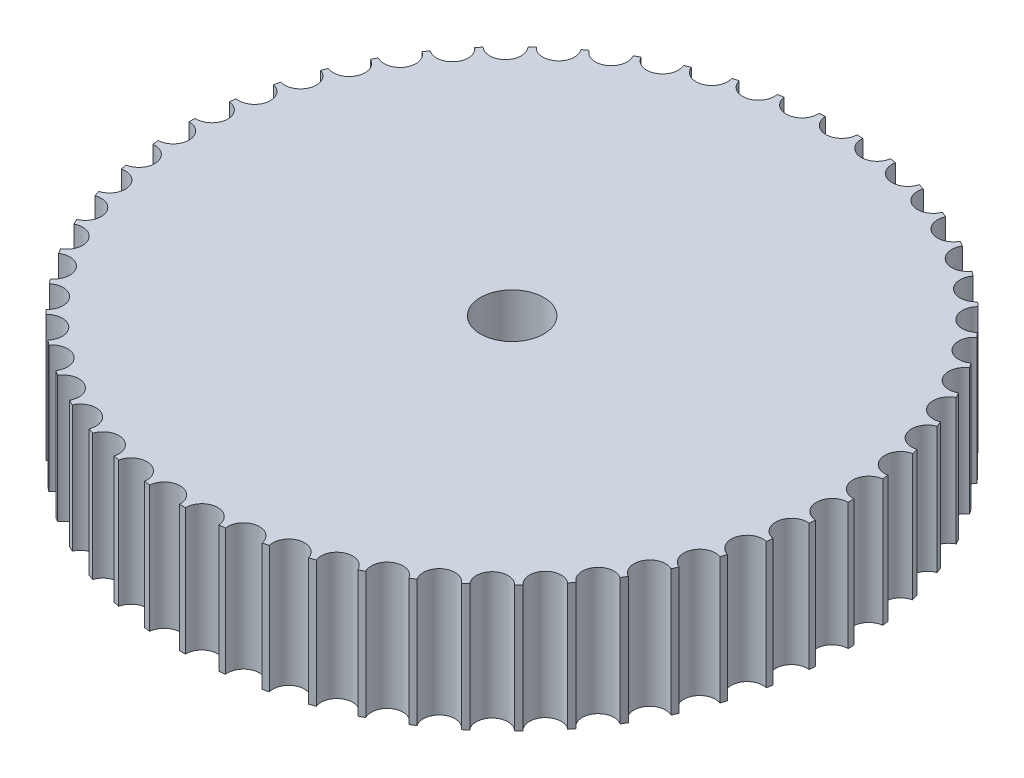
ISO-10303-21;
HEADER;
FILE_DESCRIPTION(('STEP AP214'),'2;1');
FILE_NAME('part.step','',(''),(''),'','','');
FILE_SCHEMA(('AUTOMOTIVE_DESIGN { 1 0 10303 214 1 1 1 1 }'));
ENDSEC;
DATA;
#1=APPLICATION_CONTEXT('core data for automotive mechanical design processes');
#2=APPLICATION_PROTOCOL_DEFINITION('international standard','automotive_design',2000,#1);
#3=PRODUCT_CONTEXT('',#1,'mechanical');
#4=PRODUCT('Part','Part','',(#3));
#5=PRODUCT_RELATED_PRODUCT_CATEGORY('part','',(#4));
#6=PRODUCT_DEFINITION_FORMATION('','',#4);
#7=PRODUCT_DEFINITION_CONTEXT('part definition',#1,'design');
#8=PRODUCT_DEFINITION('design','',#6,#7);
#9=PRODUCT_DEFINITION_SHAPE('','',#8);
#10=(LENGTH_UNIT() NAMED_UNIT(*) SI_UNIT(.MILLI.,.METRE.));
#11=(NAMED_UNIT(*) PLANE_ANGLE_UNIT() SI_UNIT($,.RADIAN.));
#12=(NAMED_UNIT(*) SI_UNIT($,.STERADIAN.) SOLID_ANGLE_UNIT());
#13=UNCERTAINTY_MEASURE_WITH_UNIT(LENGTH_MEASURE(1.E-05),#10,'distance_accuracy_value','');
#14=(GEOMETRIC_REPRESENTATION_CONTEXT(3) GLOBAL_UNCERTAINTY_ASSIGNED_CONTEXT((#13)) GLOBAL_UNIT_ASSIGNED_CONTEXT((#10,
#11,#12)) REPRESENTATION_CONTEXT('',''));
#15=CARTESIAN_POINT('',(0.,0.,0.));
#16=DIRECTION('',(0.,0.,1.));
#17=DIRECTION('',(1.,0.,0.));
#18=AXIS2_PLACEMENT_3D('',#15,#16,#17);
#19=CARTESIAN_POINT('',(0.,10.,0.));
#20=DIRECTION('',(0.,-1.,0.));
#21=DIRECTION('',(0.,0.,-1.));
#22=AXIS2_PLACEMENT_3D('',#19,#20,#21);
#23=CYLINDRICAL_SURFACE('',#22,26.);
#24=CARTESIAN_POINT('',(0.,0.,0.));
#25=DIRECTION('',(0.,1.,0.));
#26=DIRECTION('',(0.,0.,1.));
#27=AXIS2_PLACEMENT_3D('',#24,#25,#26);
#28=CIRCLE('',#27,26.);
#29=CARTESIAN_POINT('',(25.9950459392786,0.,-0.507529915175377));
#30=VERTEX_POINT('',#29);
#31=CARTESIAN_POINT('',(25.9816250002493,0.,-0.977324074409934));
#32=VERTEX_POINT('',#31);
#33=EDGE_CURVE('E846',#30,#32,#28,.T.);
#34=ORIENTED_EDGE('',*,*,#33,.T.);
#35=DIRECTION('',(0.,1.,0.));
#36=VECTOR('',#35,1.);
#37=CARTESIAN_POINT('',(25.9816250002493,5.,-0.977324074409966));
#38=LINE('',#37,#36);
#39=CARTESIAN_POINT('',(25.9816250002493,10.,-0.977324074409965));
#40=VERTEX_POINT('',#39);
#41=EDGE_CURVE('E924',#32,#40,#38,.T.);
#42=ORIENTED_EDGE('',*,*,#41,.T.);
#43=CARTESIAN_POINT('',(0.,10.,0.));
#44=DIRECTION('',(0.,1.,0.));
#45=DIRECTION('',(0.,0.,1.));
#46=AXIS2_PLACEMENT_3D('',#43,#44,#45);
#47=CIRCLE('',#46,26.);
#48=CARTESIAN_POINT('',(25.9950459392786,10.,-0.507529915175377));
#49=VERTEX_POINT('',#48);
#50=EDGE_CURVE('E1508',#49,#40,#47,.T.);
#51=ORIENTED_EDGE('',*,*,#50,.F.);
#52=DIRECTION('',(0.,1.,0.));
#53=VECTOR('',#52,1.);
#54=CARTESIAN_POINT('',(25.9950459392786,5.,-0.507529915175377));
#55=LINE('',#54,#53);
#56=EDGE_CURVE('E1072',#49,#30,#55,.F.);
#57=ORIENTED_EDGE('',*,*,#56,.T.);
#58=EDGE_LOOP('',(#34,#42,#51,#57));
#59=FACE_BOUND('',#58,.T.);
#60=ADVANCED_FACE('F38',(#59),#23,.T.);
#61=CARTESIAN_POINT('',(25.7677492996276,10.,-3.46743363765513));
#62=VERTEX_POINT('',#61);
#63=CARTESIAN_POINT('',(25.7008633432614,10.,-3.9326356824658));
#64=VERTEX_POINT('',#63);
#65=EDGE_CURVE('E1505',#62,#64,#47,.T.);
#66=ORIENTED_EDGE('',*,*,#65,.F.);
#67=DIRECTION('',(0.,1.,0.));
#68=VECTOR('',#67,1.);
#69=CARTESIAN_POINT('',(25.7677492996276,5.,-3.46743363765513));
#70=LINE('',#69,#68);
#71=CARTESIAN_POINT('',(25.7677492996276,0.,-3.46743363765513));
#72=VERTEX_POINT('',#71);
#73=EDGE_CURVE('E845',#62,#72,#70,.F.);
#74=ORIENTED_EDGE('',*,*,#73,.T.);
#75=CARTESIAN_POINT('',(25.7008633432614,0.,-3.93263568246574));
#76=VERTEX_POINT('',#75);
#77=EDGE_CURVE('E833',#72,#76,#28,.T.);
#78=ORIENTED_EDGE('',*,*,#77,.T.);
#79=DIRECTION('',(0.,1.,0.));
#80=VECTOR('',#79,1.);
#81=CARTESIAN_POINT('',(25.7008633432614,5.,-3.9326356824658));
#82=LINE('',#81,#80);
#83=EDGE_CURVE('E843',#76,#64,#82,.T.);
#84=ORIENTED_EDGE('',*,*,#83,.T.);
#85=EDGE_LOOP('',(#66,#74,#78,#84));
#86=FACE_BOUND('',#85,.T.);
#87=ADVANCED_FACE('F842',(#86),#23,.T.);
#88=CARTESIAN_POINT('',(25.2045306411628,10.,-6.38213405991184));
#89=VERTEX_POINT('',#88);
#90=CARTESIAN_POINT('',(25.0850516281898,10.,-6.83667937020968));
#91=VERTEX_POINT('',#90);
#92=EDGE_CURVE('E1511',#89,#91,#47,.T.);
#93=ORIENTED_EDGE('',*,*,#92,.F.);
#94=DIRECTION('',(0.,1.,0.));
#95=VECTOR('',#94,1.);
#96=CARTESIAN_POINT('',(25.2045306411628,5.,-6.38213405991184));
#97=LINE('',#96,#95);
#98=CARTESIAN_POINT('',(25.2045306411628,0.,-6.38213405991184));
#99=VERTEX_POINT('',#98);
#100=EDGE_CURVE('E929',#89,#99,#97,.F.);
#101=ORIENTED_EDGE('',*,*,#100,.T.);
#102=CARTESIAN_POINT('',(25.0850516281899,0.,-6.8366793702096));
#103=VERTEX_POINT('',#102);
#104=EDGE_CURVE('E835',#99,#103,#28,.T.);
#105=ORIENTED_EDGE('',*,*,#104,.T.);
#106=DIRECTION('',(0.,1.,0.));
#107=VECTOR('',#106,1.);
#108=CARTESIAN_POINT('',(25.0850516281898,5.,-6.83667937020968));
#109=LINE('',#108,#107);
#110=EDGE_CURVE('E931',#103,#91,#109,.T.);
#111=ORIENTED_EDGE('',*,*,#110,.T.);
#112=EDGE_LOOP('',(#93,#101,#105,#111));
#113=FACE_BOUND('',#112,.T.);
#114=ADVANCED_FACE('F1845',(#113),#23,.T.);
#115=CARTESIAN_POINT('',(24.3127323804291,10.,-9.21363360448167));
#116=VERTEX_POINT('',#115);
#117=CARTESIAN_POINT('',(24.1422179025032,10.,-9.65159648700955));
#118=VERTEX_POINT('',#117);
#119=EDGE_CURVE('E1517',#116,#118,#47,.T.);
#120=ORIENTED_EDGE('',*,*,#119,.F.);
#121=DIRECTION('',(0.,1.,0.));
#122=VECTOR('',#121,1.);
#123=CARTESIAN_POINT('',(24.3127323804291,5.,-9.21363360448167));
#124=LINE('',#123,#122);
#125=CARTESIAN_POINT('',(24.3127323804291,0.,-9.21363360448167));
#126=VERTEX_POINT('',#125);
#127=EDGE_CURVE('E933',#116,#126,#124,.F.);
#128=ORIENTED_EDGE('',*,*,#127,.T.);
#129=CARTESIAN_POINT('',(24.1422179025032,0.,-9.65159648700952));
#130=VERTEX_POINT('',#129);
#131=EDGE_CURVE('E849',#126,#130,#28,.T.);
#132=ORIENTED_EDGE('',*,*,#131,.T.);
#133=DIRECTION('',(0.,1.,0.));
#134=VECTOR('',#133,1.);
#135=CARTESIAN_POINT('',(24.1422179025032,5.,-9.65159648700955));
#136=LINE('',#135,#134);
#137=EDGE_CURVE('E935',#130,#118,#136,.T.);
#138=ORIENTED_EDGE('',*,*,#137,.T.);
#139=EDGE_LOOP('',(#120,#128,#132,#138));
#140=FACE_BOUND('',#139,.T.);
#141=ADVANCED_FACE('F1968',(#140),#23,.T.);
#142=CARTESIAN_POINT('',(19.8025739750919,0.,-16.8480878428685));
#143=VERTEX_POINT('',#142);
#144=CARTESIAN_POINT('',(19.4947987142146,0.,-17.2032794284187));
#145=VERTEX_POINT('',#144);
#146=EDGE_CURVE('E865',#143,#145,#28,.T.);
#147=ORIENTED_EDGE('',*,*,#146,.T.);
#148=DIRECTION('',(0.,1.,0.));
#149=VECTOR('',#148,1.);
#150=CARTESIAN_POINT('',(19.4947987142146,5.,-17.2032794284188));
#151=LINE('',#150,#149);
#152=CARTESIAN_POINT('',(19.4947987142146,10.,-17.2032794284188));
#153=VERTEX_POINT('',#152);
#154=EDGE_CURVE('E939',#145,#153,#151,.T.);
#155=ORIENTED_EDGE('',*,*,#154,.T.);
#156=CARTESIAN_POINT('',(19.8025739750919,10.,-16.8480878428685));
#157=VERTEX_POINT('',#156);
#158=EDGE_CURVE('E1535',#157,#153,#47,.T.);
#159=ORIENTED_EDGE('',*,*,#158,.F.);
#160=DIRECTION('',(0.,1.,0.));
#161=VECTOR('',#160,1.);
#162=CARTESIAN_POINT('',(19.8025739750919,5.,-16.8480878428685));
#163=LINE('',#162,#161);
#164=EDGE_CURVE('E949',#157,#143,#163,.F.);
#165=ORIENTED_EDGE('',*,*,#164,.T.);
#166=EDGE_LOOP('',(#147,#155,#159,#165));
#167=FACE_BOUND('',#166,.T.);
#168=ADVANCED_FACE('F1976',(#167),#23,.T.);
#169=CARTESIAN_POINT('',(23.1039804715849,10.,-11.9250193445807));
#170=VERTEX_POINT('',#169);
#171=CARTESIAN_POINT('',(22.884653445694,10.,-12.3406902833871));
#172=VERTEX_POINT('',#171);
#173=EDGE_CURVE('E1523',#170,#172,#47,.T.);
#174=ORIENTED_EDGE('',*,*,#173,.F.);
#175=DIRECTION('',(0.,1.,0.));
#176=VECTOR('',#175,1.);
#177=CARTESIAN_POINT('',(23.1039804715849,5.,-11.9250193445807));
#178=LINE('',#177,#176);
#179=CARTESIAN_POINT('',(23.1039804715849,0.,-11.9250193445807));
#180=VERTEX_POINT('',#179);
#181=EDGE_CURVE('E937',#170,#180,#178,.F.);
#182=ORIENTED_EDGE('',*,*,#181,.T.);
#183=CARTESIAN_POINT('',(22.8846534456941,0.,-12.340690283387));
#184=VERTEX_POINT('',#183);
#185=EDGE_CURVE('E853',#180,#184,#28,.T.);
#186=ORIENTED_EDGE('',*,*,#185,.T.);
#187=DIRECTION('',(0.,1.,0.));
#188=VECTOR('',#187,1.);
#189=CARTESIAN_POINT('',(22.884653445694,5.,-12.3406902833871));
#190=LINE('',#189,#188);
#191=EDGE_CURVE('E943',#184,#172,#190,.T.);
#192=ORIENTED_EDGE('',*,*,#191,.T.);
#193=EDGE_LOOP('',(#174,#182,#186,#192));
#194=FACE_BOUND('',#193,.T.);
#195=ADVANCED_FACE('F1984',(#194),#23,.T.);
#196=CARTESIAN_POINT('',(21.5940328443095,10.,-14.4809442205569));
#197=VERTEX_POINT('',#196);
#198=CARTESIAN_POINT('',(21.3287525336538,10.,-14.8689043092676));
#199=VERTEX_POINT('',#198);
#200=EDGE_CURVE('E1529',#197,#199,#47,.T.);
#201=ORIENTED_EDGE('',*,*,#200,.F.);
#202=DIRECTION('',(0.,1.,0.));
#203=VECTOR('',#202,1.);
#204=CARTESIAN_POINT('',(21.5940328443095,5.,-14.4809442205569));
#205=LINE('',#204,#203);
#206=CARTESIAN_POINT('',(21.5940328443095,0.,-14.4809442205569));
#207=VERTEX_POINT('',#206);
#208=EDGE_CURVE('E945',#197,#207,#205,.F.);
#209=ORIENTED_EDGE('',*,*,#208,.T.);
#210=CARTESIAN_POINT('',(21.3287525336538,0.,-14.8689043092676));
#211=VERTEX_POINT('',#210);
#212=EDGE_CURVE('E859',#207,#211,#28,.T.);
#213=ORIENTED_EDGE('',*,*,#212,.T.);
#214=DIRECTION('',(0.,1.,0.));
#215=VECTOR('',#214,1.);
#216=CARTESIAN_POINT('',(21.3287525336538,5.,-14.8689043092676));
#217=LINE('',#216,#215);
#218=EDGE_CURVE('E947',#211,#199,#217,.T.);
#219=ORIENTED_EDGE('',*,*,#218,.T.);
#220=EDGE_LOOP('',(#201,#209,#213,#219));
#221=FACE_BOUND('',#220,.T.);
#222=ADVANCED_FACE('F1992',(#221),#23,.T.);
#223=CARTESIAN_POINT('',(15.4719056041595,0.,-20.8954573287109));
#224=VERTEX_POINT('',#223);
#225=CARTESIAN_POINT('',(15.0916790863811,0.,-21.1717080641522));
#226=VERTEX_POINT('',#225);
#227=EDGE_CURVE('E877',#224,#226,#28,.T.);
#228=ORIENTED_EDGE('',*,*,#227,.T.);
#229=DIRECTION('',(0.,1.,0.));
#230=VECTOR('',#229,1.);
#231=CARTESIAN_POINT('',(15.091679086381,5.,-21.1717080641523));
#232=LINE('',#231,#230);
#233=CARTESIAN_POINT('',(15.091679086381,10.,-21.1717080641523));
#234=VERTEX_POINT('',#233);
#235=EDGE_CURVE('E951',#226,#234,#232,.T.);
#236=ORIENTED_EDGE('',*,*,#235,.T.);
#237=CARTESIAN_POINT('',(15.4719056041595,10.,-20.8954573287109));
#238=VERTEX_POINT('',#237);
#239=EDGE_CURVE('E1547',#238,#234,#47,.T.);
#240=ORIENTED_EDGE('',*,*,#239,.F.);
#241=DIRECTION('',(0.,1.,0.));
#242=VECTOR('',#241,1.);
#243=CARTESIAN_POINT('',(15.4719056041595,5.,-20.8954573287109));
#244=LINE('',#243,#242);
#245=EDGE_CURVE('E957',#238,#224,#244,.F.);
#246=ORIENTED_EDGE('',*,*,#245,.T.);
#247=EDGE_LOOP('',(#228,#236,#240,#246));
#248=FACE_BOUND('',#247,.T.);
#249=ADVANCED_FACE('F2000',(#248),#23,.T.);
#250=CARTESIAN_POINT('',(17.7529582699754,10.,-18.9955908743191));
#251=VERTEX_POINT('',#250);
#252=CARTESIAN_POINT('',(17.4067003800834,10.,-19.3133834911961));
#253=VERTEX_POINT('',#252);
#254=EDGE_CURVE('E1541',#251,#253,#47,.T.);
#255=ORIENTED_EDGE('',*,*,#254,.F.);
#256=DIRECTION('',(0.,1.,0.));
#257=VECTOR('',#256,1.);
#258=CARTESIAN_POINT('',(17.7529582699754,5.,-18.9955908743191));
#259=LINE('',#258,#257);
#260=CARTESIAN_POINT('',(17.7529582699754,0.,-18.9955908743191));
#261=VERTEX_POINT('',#260);
#262=EDGE_CURVE('E941',#251,#261,#259,.F.);
#263=ORIENTED_EDGE('',*,*,#262,.T.);
#264=CARTESIAN_POINT('',(17.4067003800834,0.,-19.313383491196));
#265=VERTEX_POINT('',#264);
#266=EDGE_CURVE('E871',#261,#265,#28,.T.);
#267=ORIENTED_EDGE('',*,*,#266,.T.);
#268=DIRECTION('',(0.,1.,0.));
#269=VECTOR('',#268,1.);
#270=CARTESIAN_POINT('',(17.4067003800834,5.,-19.3133834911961));
#271=LINE('',#270,#269);
#272=EDGE_CURVE('E955',#265,#253,#271,.T.);
#273=ORIENTED_EDGE('',*,*,#272,.T.);
#274=EDGE_LOOP('',(#255,#263,#267,#273));
#275=FACE_BOUND('',#274,.T.);
#276=ADVANCED_FACE('F2008',(#275),#23,.T.);
#277=CARTESIAN_POINT('',(12.9891529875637,10.,-22.5229195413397));
#278=VERTEX_POINT('',#277);
#279=CARTESIAN_POINT('',(12.5799146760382,10.,-22.7540270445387));
#280=VERTEX_POINT('',#279);
#281=EDGE_CURVE('E1553',#278,#280,#47,.T.);
#282=ORIENTED_EDGE('',*,*,#281,.F.);
#283=DIRECTION('',(0.,1.,0.));
#284=VECTOR('',#283,1.);
#285=CARTESIAN_POINT('',(12.9891529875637,5.,-22.5229195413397));
#286=LINE('',#285,#284);
#287=CARTESIAN_POINT('',(12.9891529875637,0.,-22.5229195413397));
#288=VERTEX_POINT('',#287);
#289=EDGE_CURVE('E953',#278,#288,#286,.F.);
#290=ORIENTED_EDGE('',*,*,#289,.T.);
#291=CARTESIAN_POINT('',(12.5799146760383,0.,-22.7540270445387));
#292=VERTEX_POINT('',#291);
#293=EDGE_CURVE('E883',#288,#292,#28,.T.);
#294=ORIENTED_EDGE('',*,*,#293,.T.);
#295=DIRECTION('',(0.,1.,0.));
#296=VECTOR('',#295,1.);
#297=CARTESIAN_POINT('',(12.5799146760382,5.,-22.7540270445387));
#298=LINE('',#297,#296);
#299=EDGE_CURVE('E959',#292,#280,#298,.T.);
#300=ORIENTED_EDGE('',*,*,#299,.T.);
#301=EDGE_LOOP('',(#282,#290,#294,#300));
#302=FACE_BOUND('',#301,.T.);
#303=ADVANCED_FACE('F2016',(#302),#23,.T.);
#304=CARTESIAN_POINT('',(10.3370668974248,10.,-23.856761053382));
#305=VERTEX_POINT('',#304);
#306=CARTESIAN_POINT('',(9.90415183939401,10.,-24.0397124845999));
#307=VERTEX_POINT('',#306);
#308=EDGE_CURVE('E1559',#305,#307,#47,.T.);
#309=ORIENTED_EDGE('',*,*,#308,.F.);
#310=DIRECTION('',(0.,1.,0.));
#311=VECTOR('',#310,1.);
#312=CARTESIAN_POINT('',(10.3370668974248,5.,-23.856761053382));
#313=LINE('',#312,#311);
#314=CARTESIAN_POINT('',(10.3370668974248,0.,-23.856761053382));
#315=VERTEX_POINT('',#314);
#316=EDGE_CURVE('E961',#305,#315,#313,.F.);
#317=ORIENTED_EDGE('',*,*,#316,.T.);
#318=CARTESIAN_POINT('',(9.90415183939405,0.,-24.0397124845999));
#319=VERTEX_POINT('',#318);
#320=EDGE_CURVE('E889',#315,#319,#28,.T.);
#321=ORIENTED_EDGE('',*,*,#320,.T.);
#322=DIRECTION('',(0.,1.,0.));
#323=VECTOR('',#322,1.);
#324=CARTESIAN_POINT('',(9.90415183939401,5.,-24.0397124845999));
#325=LINE('',#324,#323);
#326=EDGE_CURVE('E963',#319,#307,#325,.T.);
#327=ORIENTED_EDGE('',*,*,#326,.T.);
#328=EDGE_LOOP('',(#309,#317,#321,#327));
#329=FACE_BOUND('',#328,.T.);
#330=ADVANCED_FACE('F2024',(#329),#23,.T.);
#331=CARTESIAN_POINT('',(7.55022133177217,10.,-24.8795932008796));
#332=VERTEX_POINT('',#331);
#333=CARTESIAN_POINT('',(7.09927323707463,10.,-25.0120035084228));
#334=VERTEX_POINT('',#333);
#335=EDGE_CURVE('E1565',#332,#334,#47,.T.);
#336=ORIENTED_EDGE('',*,*,#335,.F.);
#337=DIRECTION('',(0.,1.,0.));
#338=VECTOR('',#337,1.);
#339=CARTESIAN_POINT('',(7.55022133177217,5.,-24.8795932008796));
#340=LINE('',#339,#338);
#341=CARTESIAN_POINT('',(7.55022133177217,0.,-24.8795932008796));
#342=VERTEX_POINT('',#341);
#343=EDGE_CURVE('E965',#332,#342,#340,.F.);
#344=ORIENTED_EDGE('',*,*,#343,.T.);
#345=CARTESIAN_POINT('',(7.09927323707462,0.,-25.0120035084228));
#346=VERTEX_POINT('',#345);
#347=EDGE_CURVE('E895',#342,#346,#28,.T.);
#348=ORIENTED_EDGE('',*,*,#347,.T.);
#349=DIRECTION('',(0.,1.,0.));
#350=VECTOR('',#349,1.);
#351=CARTESIAN_POINT('',(7.09927323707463,5.,-25.0120035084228));
#352=LINE('',#351,#350);
#353=EDGE_CURVE('E61',#346,#334,#352,.T.);
#354=ORIENTED_EDGE('',*,*,#353,.T.);
#355=EDGE_LOOP('',(#336,#344,#348,#354));
#356=FACE_BOUND('',#355,.T.);
#357=ADVANCED_FACE('F2032',(#356),#23,.T.);
#358=CARTESIAN_POINT('',(4.66494708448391,10.,-25.5780818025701));
#359=VERTEX_POINT('',#358);
#360=CARTESIAN_POINT('',(4.20184475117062,10.,-25.6582248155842));
#361=VERTEX_POINT('',#360);
#362=EDGE_CURVE('E1571',#359,#361,#47,.T.);
#363=ORIENTED_EDGE('',*,*,#362,.F.);
#364=DIRECTION('',(0.,1.,0.));
#365=VECTOR('',#364,1.);
#366=CARTESIAN_POINT('',(4.66494708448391,5.,-25.5780818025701));
#367=LINE('',#366,#365);
#368=CARTESIAN_POINT('',(4.66494708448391,0.,-25.5780818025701));
#369=VERTEX_POINT('',#368);
#370=EDGE_CURVE('E968',#359,#369,#367,.F.);
#371=ORIENTED_EDGE('',*,*,#370,.T.);
#372=CARTESIAN_POINT('',(4.2018447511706,0.,-25.6582248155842));
#373=VERTEX_POINT('',#372);
#374=EDGE_CURVE('E901',#369,#373,#28,.T.);
#375=ORIENTED_EDGE('',*,*,#374,.T.);
#376=DIRECTION('',(0.,1.,0.));
#377=VECTOR('',#376,1.);
#378=CARTESIAN_POINT('',(4.20184475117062,5.,-25.6582248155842));
#379=LINE('',#378,#377);
#380=EDGE_CURVE('E53',#373,#361,#379,.T.);
#381=ORIENTED_EDGE('',*,*,#380,.T.);
#382=EDGE_LOOP('',(#363,#371,#375,#381));
#383=FACE_BOUND('',#382,.T.);
#384=ADVANCED_FACE('F2040',(#383),#23,.T.);
#385=CARTESIAN_POINT('',(-0.234992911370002,0.,25.9989380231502));
#386=VERTEX_POINT('',#385);
#387=CARTESIAN_POINT('',(0.234992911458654,0.,25.9989380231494));
#388=VERTEX_POINT('',#387);
#389=EDGE_CURVE('E2916',#386,#388,#28,.T.);
#390=ORIENTED_EDGE('',*,*,#389,.T.);
#391=DIRECTION('',(0.,1.,0.));
#392=VECTOR('',#391,1.);
#393=CARTESIAN_POINT('',(0.234992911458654,5.,25.9989380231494));
#394=LINE('',#393,#392);
#395=CARTESIAN_POINT('',(0.234992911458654,10.,25.9989380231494));
#396=VERTEX_POINT('',#395);
#397=EDGE_CURVE('E973',#388,#396,#394,.T.);
#398=ORIENTED_EDGE('',*,*,#397,.T.);
#399=CARTESIAN_POINT('',(-0.234992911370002,10.,25.9989380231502));
#400=VERTEX_POINT('',#399);
#401=EDGE_CURVE('E1737',#400,#396,#47,.T.);
#402=ORIENTED_EDGE('',*,*,#401,.F.);
#403=DIRECTION('',(0.,1.,0.));
#404=VECTOR('',#403,1.);
#405=CARTESIAN_POINT('',(-0.234992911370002,5.,25.9989380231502));
#406=LINE('',#405,#404);
#407=EDGE_CURVE('E1149',#400,#386,#406,.F.);
#408=ORIENTED_EDGE('',*,*,#407,.T.);
#409=EDGE_LOOP('',(#390,#398,#402,#408));
#410=FACE_BOUND('',#409,.T.);
#411=ADVANCED_FACE('F2048',(#410),#23,.T.);
#412=CARTESIAN_POINT('',(2.73019443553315,10.,25.85625723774));
#413=VERTEX_POINT('',#412);
#414=CARTESIAN_POINT('',(3.19711676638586,10.,25.8026828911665));
#415=VERTEX_POINT('',#414);
#416=EDGE_CURVE('E1743',#413,#415,#47,.T.);
#417=ORIENTED_EDGE('',*,*,#416,.F.);
#418=DIRECTION('',(0.,1.,0.));
#419=VECTOR('',#418,1.);
#420=CARTESIAN_POINT('',(2.73019443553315,5.,25.85625723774));
#421=LINE('',#420,#419);
#422=CARTESIAN_POINT('',(2.73019443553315,0.,25.85625723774));
#423=VERTEX_POINT('',#422);
#424=EDGE_CURVE('E976',#413,#423,#421,.F.);
#425=ORIENTED_EDGE('',*,*,#424,.T.);
#426=CARTESIAN_POINT('',(3.19711676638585,0.,25.8026828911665));
#427=VERTEX_POINT('',#426);
#428=EDGE_CURVE('E2914',#423,#427,#28,.T.);
#429=ORIENTED_EDGE('',*,*,#428,.T.);
#430=DIRECTION('',(0.,1.,0.));
#431=VECTOR('',#430,1.);
#432=CARTESIAN_POINT('',(3.19711676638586,5.,25.8026828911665));
#433=LINE('',#432,#431);
#434=EDGE_CURVE('E979',#427,#415,#433,.T.);
#435=ORIENTED_EDGE('',*,*,#434,.T.);
#436=EDGE_LOOP('',(#417,#425,#429,#435));
#437=FACE_BOUND('',#436,.T.);
#438=ADVANCED_FACE('F2056',(#437),#23,.T.);
#439=CARTESIAN_POINT('',(5.65978952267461,10.,25.3765005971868));
#440=VERTEX_POINT('',#439);
#441=CARTESIAN_POINT('',(6.11756131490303,10.,25.2700503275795));
#442=VERTEX_POINT('',#441);
#443=EDGE_CURVE('E1749',#440,#442,#47,.T.);
#444=ORIENTED_EDGE('',*,*,#443,.F.);
#445=DIRECTION('',(0.,1.,0.));
#446=VECTOR('',#445,1.);
#447=CARTESIAN_POINT('',(5.65978952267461,5.,25.3765005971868));
#448=LINE('',#447,#446);
#449=CARTESIAN_POINT('',(5.65978952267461,0.,25.3765005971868));
#450=VERTEX_POINT('',#449);
#451=EDGE_CURVE('E982',#440,#450,#448,.F.);
#452=ORIENTED_EDGE('',*,*,#451,.T.);
#453=CARTESIAN_POINT('',(6.117561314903,0.,25.2700503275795));
#454=VERTEX_POINT('',#453);
#455=EDGE_CURVE('E2917',#450,#454,#28,.T.);
#456=ORIENTED_EDGE('',*,*,#455,.T.);
#457=DIRECTION('',(0.,1.,0.));
#458=VECTOR('',#457,1.);
#459=CARTESIAN_POINT('',(6.11756131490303,5.,25.2700503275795));
#460=LINE('',#459,#458);
#461=EDGE_CURVE('E986',#454,#442,#460,.T.);
#462=ORIENTED_EDGE('',*,*,#461,.T.);
#463=EDGE_LOOP('',(#444,#452,#456,#462));
#464=FACE_BOUND('',#463,.T.);
#465=ADVANCED_FACE('F2065',(#464),#23,.T.);
#466=CARTESIAN_POINT('',(8.51560059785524,10.,24.5659224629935));
#467=VERTEX_POINT('',#466);
#468=CARTESIAN_POINT('',(8.95825409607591,10.,24.4079840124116));
#469=VERTEX_POINT('',#468);
#470=EDGE_CURVE('E1755',#467,#469,#47,.T.);
#471=ORIENTED_EDGE('',*,*,#470,.F.);
#472=DIRECTION('',(0.,1.,0.));
#473=VECTOR('',#472,1.);
#474=CARTESIAN_POINT('',(8.51560059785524,5.,24.5659224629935));
#475=LINE('',#474,#473);
#476=CARTESIAN_POINT('',(8.51560059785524,0.,24.5659224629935));
#477=VERTEX_POINT('',#476);
#478=EDGE_CURVE('E990',#467,#477,#475,.F.);
#479=ORIENTED_EDGE('',*,*,#478,.T.);
#480=CARTESIAN_POINT('',(8.9582540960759,0.,24.4079840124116));
#481=VERTEX_POINT('',#480);
#482=EDGE_CURVE('E2920',#477,#481,#28,.T.);
#483=ORIENTED_EDGE('',*,*,#482,.T.);
#484=DIRECTION('',(0.,1.,0.));
#485=VECTOR('',#484,1.);
#486=CARTESIAN_POINT('',(8.95825409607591,5.,24.4079840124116));
#487=LINE('',#486,#485);
#488=EDGE_CURVE('E994',#481,#469,#487,.T.);
#489=ORIENTED_EDGE('',*,*,#488,.T.);
#490=EDGE_LOOP('',(#471,#479,#483,#489));
#491=FACE_BOUND('',#490,.T.);
#492=ADVANCED_FACE('F2074',(#491),#23,.T.);
#493=CARTESIAN_POINT('',(16.2757337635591,0.,20.2756131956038));
#494=VERTEX_POINT('',#493);
#495=CARTESIAN_POINT('',(16.6395693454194,0.,19.9781063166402));
#496=VERTEX_POINT('',#495);
#497=EDGE_CURVE('E2934',#494,#496,#28,.T.);
#498=ORIENTED_EDGE('',*,*,#497,.T.);
#499=DIRECTION('',(0.,1.,0.));
#500=VECTOR('',#499,1.);
#501=CARTESIAN_POINT('',(16.6395693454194,5.,19.9781063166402));
#502=LINE('',#501,#500);
#503=CARTESIAN_POINT('',(16.6395693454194,10.,19.9781063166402));
#504=VERTEX_POINT('',#503);
#505=EDGE_CURVE('E1002',#496,#504,#502,.T.);
#506=ORIENTED_EDGE('',*,*,#505,.T.);
#507=CARTESIAN_POINT('',(16.2757337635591,10.,20.2756131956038));
#508=VERTEX_POINT('',#507);
#509=EDGE_CURVE('E1773',#508,#504,#47,.T.);
#510=ORIENTED_EDGE('',*,*,#509,.F.);
#511=DIRECTION('',(0.,1.,0.));
#512=VECTOR('',#511,1.);
#513=CARTESIAN_POINT('',(16.2757337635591,5.,20.2756131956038));
#514=LINE('',#513,#512);
#515=EDGE_CURVE('E1022',#508,#494,#514,.F.);
#516=ORIENTED_EDGE('',*,*,#515,.T.);
#517=EDGE_LOOP('',(#498,#506,#510,#516));
#518=FACE_BOUND('',#517,.T.);
#519=ADVANCED_FACE('F2083',(#518),#23,.T.);
#520=CARTESIAN_POINT('',(11.2603977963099,10.,23.4350899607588));
#521=VERTEX_POINT('',#520);
#522=CARTESIAN_POINT('',(11.6821623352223,10.,23.2277222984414));
#523=VERTEX_POINT('',#522);
#524=EDGE_CURVE('E1761',#521,#523,#47,.T.);
#525=ORIENTED_EDGE('',*,*,#524,.F.);
#526=DIRECTION('',(0.,1.,0.));
#527=VECTOR('',#526,1.);
#528=CARTESIAN_POINT('',(11.2603977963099,5.,23.4350899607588));
#529=LINE('',#528,#527);
#530=CARTESIAN_POINT('',(11.2603977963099,0.,23.4350899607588));
#531=VERTEX_POINT('',#530);
#532=EDGE_CURVE('E998',#521,#531,#529,.F.);
#533=ORIENTED_EDGE('',*,*,#532,.T.);
#534=CARTESIAN_POINT('',(11.6821623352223,0.,23.2277222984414));
#535=VERTEX_POINT('',#534);
#536=EDGE_CURVE('E2924',#531,#535,#28,.T.);
#537=ORIENTED_EDGE('',*,*,#536,.T.);
#538=DIRECTION('',(0.,1.,0.));
#539=VECTOR('',#538,1.);
#540=CARTESIAN_POINT('',(11.6821623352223,5.,23.2277222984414));
#541=LINE('',#540,#539);
#542=EDGE_CURVE('E1010',#535,#523,#541,.T.);
#543=ORIENTED_EDGE('',*,*,#542,.T.);
#544=EDGE_LOOP('',(#525,#533,#537,#543));
#545=FACE_BOUND('',#544,.T.);
#546=ADVANCED_FACE('F2092',(#545),#23,.T.);
#547=CARTESIAN_POINT('',(13.8583984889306,10.,21.9987452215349));
#548=VERTEX_POINT('',#547);
#549=CARTESIAN_POINT('',(14.2537757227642,10.,21.7446517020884));
#550=VERTEX_POINT('',#549);
#551=EDGE_CURVE('E1767',#548,#550,#47,.T.);
#552=ORIENTED_EDGE('',*,*,#551,.F.);
#553=DIRECTION('',(0.,1.,0.));
#554=VECTOR('',#553,1.);
#555=CARTESIAN_POINT('',(13.8583984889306,5.,21.9987452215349));
#556=LINE('',#555,#554);
#557=CARTESIAN_POINT('',(13.8583984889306,0.,21.9987452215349));
#558=VERTEX_POINT('',#557);
#559=EDGE_CURVE('E1014',#548,#558,#556,.F.);
#560=ORIENTED_EDGE('',*,*,#559,.T.);
#561=CARTESIAN_POINT('',(14.2537757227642,0.,21.7446517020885));
#562=VERTEX_POINT('',#561);
#563=EDGE_CURVE('E2929',#558,#562,#28,.T.);
#564=ORIENTED_EDGE('',*,*,#563,.T.);
#565=DIRECTION('',(0.,1.,0.));
#566=VECTOR('',#565,1.);
#567=CARTESIAN_POINT('',(14.2537757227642,5.,21.7446517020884));
#568=LINE('',#567,#566);
#569=EDGE_CURVE('E1018',#562,#550,#568,.T.);
#570=ORIENTED_EDGE('',*,*,#569,.T.);
#571=EDGE_LOOP('',(#552,#560,#564,#570));
#572=FACE_BOUND('',#571,.T.);
#573=ADVANCED_FACE('F2101',(#572),#23,.T.);
#574=CARTESIAN_POINT('',(20.4451194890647,0.,16.0622877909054));
#575=VERTEX_POINT('',#574);
#576=CARTESIAN_POINT('',(20.7321153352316,0.,15.6901049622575));
#577=VERTEX_POINT('',#576);
#578=EDGE_CURVE('E2944',#575,#577,#28,.T.);
#579=ORIENTED_EDGE('',*,*,#578,.T.);
#580=DIRECTION('',(0.,1.,0.));
#581=VECTOR('',#580,1.);
#582=CARTESIAN_POINT('',(20.7321153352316,5.,15.6901049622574));
#583=LINE('',#582,#581);
#584=CARTESIAN_POINT('',(20.7321153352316,10.,15.6901049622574));
#585=VERTEX_POINT('',#584);
#586=EDGE_CURVE('E1026',#577,#585,#583,.T.);
#587=ORIENTED_EDGE('',*,*,#586,.T.);
#588=CARTESIAN_POINT('',(20.4451194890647,10.,16.0622877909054));
#589=VERTEX_POINT('',#588);
#590=EDGE_CURVE('E1785',#589,#585,#47,.T.);
#591=ORIENTED_EDGE('',*,*,#590,.F.);
#592=DIRECTION('',(0.,1.,0.));
#593=VECTOR('',#592,1.);
#594=CARTESIAN_POINT('',(20.4451194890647,5.,16.0622877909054));
#595=LINE('',#594,#593);
#596=EDGE_CURVE('E1038',#589,#575,#595,.F.);
#597=ORIENTED_EDGE('',*,*,#596,.T.);
#598=EDGE_LOOP('',(#579,#587,#591,#597));
#599=FACE_BOUND('',#598,.T.);
#600=ADVANCED_FACE('F2110',(#599),#23,.T.);
#601=CARTESIAN_POINT('',(18.4808899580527,10.,18.2881575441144));
#602=VERTEX_POINT('',#601);
#603=CARTESIAN_POINT('',(18.8084407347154,10.,17.9511157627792));
#604=VERTEX_POINT('',#603);
#605=EDGE_CURVE('E1779',#602,#604,#47,.T.);
#606=ORIENTED_EDGE('',*,*,#605,.F.);
#607=DIRECTION('',(0.,1.,0.));
#608=VECTOR('',#607,1.);
#609=CARTESIAN_POINT('',(18.4808899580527,5.,18.2881575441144));
#610=LINE('',#609,#608);
#611=CARTESIAN_POINT('',(18.4808899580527,0.,18.2881575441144));
#612=VERTEX_POINT('',#611);
#613=EDGE_CURVE('E1006',#602,#612,#610,.F.);
#614=ORIENTED_EDGE('',*,*,#613,.T.);
#615=CARTESIAN_POINT('',(18.8084407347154,0.,17.9511157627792));
#616=VERTEX_POINT('',#615);
#617=EDGE_CURVE('E2939',#612,#616,#28,.T.);
#618=ORIENTED_EDGE('',*,*,#617,.T.);
#619=DIRECTION('',(0.,1.,0.));
#620=VECTOR('',#619,1.);
#621=CARTESIAN_POINT('',(18.8084407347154,5.,17.9511157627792));
#622=LINE('',#621,#620);
#623=EDGE_CURVE('E1034',#616,#604,#622,.T.);
#624=ORIENTED_EDGE('',*,*,#623,.T.);
#625=EDGE_LOOP('',(#606,#614,#618,#624));
#626=FACE_BOUND('',#625,.T.);
#627=ADVANCED_FACE('F2119',(#626),#23,.T.);
#628=CARTESIAN_POINT('',(22.1428156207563,10.,13.6270215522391));
#629=VERTEX_POINT('',#628);
#630=CARTESIAN_POINT('',(22.3855151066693,10.,13.22454964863));
#631=VERTEX_POINT('',#630);
#632=EDGE_CURVE('E1791',#629,#631,#47,.T.);
#633=ORIENTED_EDGE('',*,*,#632,.F.);
#634=DIRECTION('',(0.,1.,0.));
#635=VECTOR('',#634,1.);
#636=CARTESIAN_POINT('',(22.1428156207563,5.,13.6270215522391));
#637=LINE('',#636,#635);
#638=CARTESIAN_POINT('',(22.1428156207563,0.,13.6270215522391));
#639=VERTEX_POINT('',#638);
#640=EDGE_CURVE('E1030',#629,#639,#637,.F.);
#641=ORIENTED_EDGE('',*,*,#640,.T.);
#642=CARTESIAN_POINT('',(22.3855151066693,0.,13.22454964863));
#643=VERTEX_POINT('',#642);
#644=EDGE_CURVE('E2949',#639,#643,#28,.T.);
#645=ORIENTED_EDGE('',*,*,#644,.T.);
#646=DIRECTION('',(0.,1.,0.));
#647=VECTOR('',#646,1.);
#648=CARTESIAN_POINT('',(22.3855151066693,5.,13.22454964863));
#649=LINE('',#648,#647);
#650=EDGE_CURVE('E1042',#643,#631,#649,.T.);
#651=ORIENTED_EDGE('',*,*,#650,.T.);
#652=EDGE_LOOP('',(#633,#641,#645,#651));
#653=FACE_BOUND('',#652,.T.);
#654=ADVANCED_FACE('F2128',(#653),#23,.T.);
#655=CARTESIAN_POINT('',(23.5518462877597,10.,11.0141062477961));
#656=VERTEX_POINT('',#655);
#657=CARTESIAN_POINT('',(23.7470854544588,10.,10.586592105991));
#658=VERTEX_POINT('',#657);
#659=EDGE_CURVE('E1798',#656,#658,#47,.T.);
#660=ORIENTED_EDGE('',*,*,#659,.F.);
#661=DIRECTION('',(0.,1.,0.));
#662=VECTOR('',#661,1.);
#663=CARTESIAN_POINT('',(23.5518462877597,5.,11.0141062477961));
#664=LINE('',#663,#662);
#665=CARTESIAN_POINT('',(23.5518462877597,0.,11.0141062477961));
#666=VERTEX_POINT('',#665);
#667=EDGE_CURVE('E1046',#656,#666,#664,.F.);
#668=ORIENTED_EDGE('',*,*,#667,.T.);
#669=CARTESIAN_POINT('',(23.7470854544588,0.,10.586592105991));
#670=VERTEX_POINT('',#669);
#671=EDGE_CURVE('E2954',#666,#670,#28,.T.);
#672=ORIENTED_EDGE('',*,*,#671,.T.);
#673=DIRECTION('',(0.,1.,0.));
#674=VECTOR('',#673,1.);
#675=CARTESIAN_POINT('',(23.7470854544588,5.,10.586592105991));
#676=LINE('',#675,#674);
#677=EDGE_CURVE('E1050',#670,#658,#676,.T.);
#678=ORIENTED_EDGE('',*,*,#677,.T.);
#679=EDGE_LOOP('',(#660,#668,#672,#678));
#680=FACE_BOUND('',#679,.T.);
#681=ADVANCED_FACE('F2137',(#680),#23,.T.);
#682=CARTESIAN_POINT('',(24.6538426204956,10.,8.25760522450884));
#683=VERTEX_POINT('',#682);
#684=CARTESIAN_POINT('',(24.7990762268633,10.,7.81062214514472));
#685=VERTEX_POINT('',#684);
#686=EDGE_CURVE('E1804',#683,#685,#47,.T.);
#687=ORIENTED_EDGE('',*,*,#686,.F.);
#688=DIRECTION('',(0.,1.,0.));
#689=VECTOR('',#688,1.);
#690=CARTESIAN_POINT('',(24.6538426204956,5.,8.25760522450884));
#691=LINE('',#690,#689);
#692=CARTESIAN_POINT('',(24.6538426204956,0.,8.25760522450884));
#693=VERTEX_POINT('',#692);
#694=EDGE_CURVE('E1054',#683,#693,#691,.F.);
#695=ORIENTED_EDGE('',*,*,#694,.T.);
#696=CARTESIAN_POINT('',(24.7990762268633,0.,7.81062214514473));
#697=VERTEX_POINT('',#696);
#698=EDGE_CURVE('E2959',#693,#697,#28,.T.);
#699=ORIENTED_EDGE('',*,*,#698,.T.);
#700=DIRECTION('',(0.,1.,0.));
#701=VECTOR('',#700,1.);
#702=CARTESIAN_POINT('',(24.7990762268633,5.,7.81062214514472));
#703=LINE('',#702,#701);
#704=EDGE_CURVE('E1057',#697,#685,#703,.T.);
#705=ORIENTED_EDGE('',*,*,#704,.T.);
#706=EDGE_LOOP('',(#687,#695,#699,#705));
#707=FACE_BOUND('',#706,.T.);
#708=ADVANCED_FACE('F2146',(#707),#23,.T.);
#709=CARTESIAN_POINT('',(25.4344384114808,10.,5.39345368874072));
#710=VERTEX_POINT('',#709);
#711=CARTESIAN_POINT('',(25.5277731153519,10.,4.93282877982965));
#712=VERTEX_POINT('',#711);
#713=EDGE_CURVE('E1811',#710,#712,#47,.T.);
#714=ORIENTED_EDGE('',*,*,#713,.F.);
#715=DIRECTION('',(0.,1.,0.));
#716=VECTOR('',#715,1.);
#717=CARTESIAN_POINT('',(25.4344384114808,5.,5.39345368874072));
#718=LINE('',#717,#716);
#719=CARTESIAN_POINT('',(25.4344384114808,0.,5.39345368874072));
#720=VERTEX_POINT('',#719);
#721=EDGE_CURVE('E1060',#710,#720,#718,.F.);
#722=ORIENTED_EDGE('',*,*,#721,.T.);
#723=CARTESIAN_POINT('',(25.5277731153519,0.,4.93282877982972));
#724=VERTEX_POINT('',#723);
#725=EDGE_CURVE('E2964',#720,#724,#28,.T.);
#726=ORIENTED_EDGE('',*,*,#725,.T.);
#727=DIRECTION('',(0.,1.,0.));
#728=VECTOR('',#727,1.);
#729=CARTESIAN_POINT('',(25.5277731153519,5.,4.93282877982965));
#730=LINE('',#729,#728);
#731=EDGE_CURVE('E1063',#724,#712,#730,.T.);
#732=ORIENTED_EDGE('',*,*,#731,.T.);
#733=EDGE_LOOP('',(#714,#722,#726,#732));
#734=FACE_BOUND('',#733,.T.);
#735=ADVANCED_FACE('F2155',(#734),#23,.T.);
#736=CARTESIAN_POINT('',(25.8834574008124,10.,2.45899023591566));
#737=VERTEX_POINT('',#736);
#738=CARTESIAN_POINT('',(25.9236764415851,10.,1.99072844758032));
#739=VERTEX_POINT('',#738);
#740=EDGE_CURVE('E1514',#737,#739,#47,.T.);
#741=ORIENTED_EDGE('',*,*,#740,.F.);
#742=DIRECTION('',(0.,1.,0.));
#743=VECTOR('',#742,1.);
#744=CARTESIAN_POINT('',(25.8834574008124,5.,2.45899023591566));
#745=LINE('',#744,#743);
#746=CARTESIAN_POINT('',(25.8834574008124,0.,2.45899023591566));
#747=VERTEX_POINT('',#746);
#748=EDGE_CURVE('E1066',#737,#747,#745,.F.);
#749=ORIENTED_EDGE('',*,*,#748,.T.);
#750=CARTESIAN_POINT('',(25.9236764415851,0.,1.99072844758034));
#751=VERTEX_POINT('',#750);
#752=EDGE_CURVE('E848',#747,#751,#28,.T.);
#753=ORIENTED_EDGE('',*,*,#752,.T.);
#754=DIRECTION('',(0.,1.,0.));
#755=VECTOR('',#754,1.);
#756=CARTESIAN_POINT('',(25.9236764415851,5.,1.99072844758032));
#757=LINE('',#756,#755);
#758=EDGE_CURVE('E1069',#751,#739,#757,.T.);
#759=ORIENTED_EDGE('',*,*,#758,.T.);
#760=EDGE_LOOP('',(#741,#749,#753,#759));
#761=FACE_BOUND('',#760,.T.);
#762=ADVANCED_FACE('F1825',(#761),#23,.T.);
#763=CARTESIAN_POINT('',(-25.9236764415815,0.,1.99072844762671));
#764=VERTEX_POINT('',#763);
#765=CARTESIAN_POINT('',(-25.8834574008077,0.,2.45899023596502));
#766=VERTEX_POINT('',#765);
#767=EDGE_CURVE('E733',#764,#766,#28,.T.);
#768=ORIENTED_EDGE('',*,*,#767,.T.);
#769=DIRECTION('',(0.,1.,0.));
#770=VECTOR('',#769,1.);
#771=CARTESIAN_POINT('',(-25.8834574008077,5.,2.45899023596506));
#772=LINE('',#771,#770);
#773=CARTESIAN_POINT('',(-25.8834574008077,10.,2.45899023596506));
#774=VERTEX_POINT('',#773);
#775=EDGE_CURVE('E1075',#766,#774,#772,.T.);
#776=ORIENTED_EDGE('',*,*,#775,.T.);
#777=CARTESIAN_POINT('',(-25.9236764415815,10.,1.99072844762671));
#778=VERTEX_POINT('',#777);
#779=EDGE_CURVE('E735',#778,#774,#47,.T.);
#780=ORIENTED_EDGE('',*,*,#779,.F.);
#781=DIRECTION('',(0.,1.,0.));
#782=VECTOR('',#781,1.);
#783=CARTESIAN_POINT('',(-25.9236764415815,5.,1.99072844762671));
#784=LINE('',#783,#782);
#785=EDGE_CURVE('E717',#778,#764,#784,.F.);
#786=ORIENTED_EDGE('',*,*,#785,.T.);
#787=EDGE_LOOP('',(#768,#776,#780,#786));
#788=FACE_BOUND('',#787,.T.);
#789=ADVANCED_FACE('F731',(#788),#23,.T.);
#790=CARTESIAN_POINT('',(-25.5277731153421,10.,4.93282877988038));
#791=VERTEX_POINT('',#790);
#792=CARTESIAN_POINT('',(-25.4344384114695,10.,5.39345368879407));
#793=VERTEX_POINT('',#792);
#794=EDGE_CURVE('E1666',#791,#793,#47,.T.);
#795=ORIENTED_EDGE('',*,*,#794,.F.);
#796=DIRECTION('',(0.,1.,0.));
#797=VECTOR('',#796,1.);
#798=CARTESIAN_POINT('',(-25.5277731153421,5.,4.93282877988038));
#799=LINE('',#798,#797);
#800=CARTESIAN_POINT('',(-25.5277731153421,0.,4.93282877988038));
#801=VERTEX_POINT('',#800);
#802=EDGE_CURVE('E1077',#791,#801,#799,.F.);
#803=ORIENTED_EDGE('',*,*,#802,.T.);
#804=CARTESIAN_POINT('',(-25.4344384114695,0.,5.39345368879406));
#805=VERTEX_POINT('',#804);
#806=EDGE_CURVE('E744',#801,#805,#28,.T.);
#807=ORIENTED_EDGE('',*,*,#806,.T.);
#808=DIRECTION('',(0.,1.,0.));
#809=VECTOR('',#808,1.);
#810=CARTESIAN_POINT('',(-25.4344384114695,5.,5.39345368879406));
#811=LINE('',#810,#809);
#812=EDGE_CURVE('E1080',#805,#793,#811,.T.);
#813=ORIENTED_EDGE('',*,*,#812,.T.);
#814=EDGE_LOOP('',(#795,#803,#807,#813));
#815=FACE_BOUND('',#814,.T.);
#816=ADVANCED_FACE('F2179',(#815),#23,.T.);
#817=CARTESIAN_POINT('',(-24.7990762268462,10.,7.81062214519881));
#818=VERTEX_POINT('',#817);
#819=CARTESIAN_POINT('',(-24.6538426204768,10.,8.25760522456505));
#820=VERTEX_POINT('',#819);
#821=EDGE_CURVE('E1671',#818,#820,#47,.T.);
#822=ORIENTED_EDGE('',*,*,#821,.F.);
#823=DIRECTION('',(0.,1.,0.));
#824=VECTOR('',#823,1.);
#825=CARTESIAN_POINT('',(-24.7990762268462,5.,7.81062214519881));
#826=LINE('',#825,#824);
#827=CARTESIAN_POINT('',(-24.7990762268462,0.,7.81062214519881));
#828=VERTEX_POINT('',#827);
#829=EDGE_CURVE('E1083',#818,#828,#826,.F.);
#830=ORIENTED_EDGE('',*,*,#829,.T.);
#831=CARTESIAN_POINT('',(-24.6538426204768,0.,8.25760522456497));
#832=VERTEX_POINT('',#831);
#833=EDGE_CURVE('E748',#828,#832,#28,.T.);
#834=ORIENTED_EDGE('',*,*,#833,.T.);
#835=DIRECTION('',(0.,1.,0.));
#836=VECTOR('',#835,1.);
#837=CARTESIAN_POINT('',(-24.6538426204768,5.,8.25760522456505));
#838=LINE('',#837,#836);
#839=EDGE_CURVE('E1086',#832,#820,#838,.T.);
#840=ORIENTED_EDGE('',*,*,#839,.T.);
#841=EDGE_LOOP('',(#822,#830,#834,#840));
#842=FACE_BOUND('',#841,.T.);
#843=ADVANCED_FACE('F2187',(#842),#23,.T.);
#844=CARTESIAN_POINT('',(-23.7470854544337,10.,10.5865921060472));
#845=VERTEX_POINT('',#844);
#846=CARTESIAN_POINT('',(-23.5518462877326,10.,11.0141062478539));
#847=VERTEX_POINT('',#846);
#848=EDGE_CURVE('E1677',#845,#847,#47,.T.);
#849=ORIENTED_EDGE('',*,*,#848,.F.);
#850=DIRECTION('',(0.,1.,0.));
#851=VECTOR('',#850,1.);
#852=CARTESIAN_POINT('',(-23.7470854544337,5.,10.5865921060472));
#853=LINE('',#852,#851);
#854=CARTESIAN_POINT('',(-23.7470854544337,0.,10.5865921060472));
#855=VERTEX_POINT('',#854);
#856=EDGE_CURVE('E1089',#845,#855,#853,.F.);
#857=ORIENTED_EDGE('',*,*,#856,.T.);
#858=CARTESIAN_POINT('',(-23.5518462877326,0.,11.0141062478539));
#859=VERTEX_POINT('',#858);
#860=EDGE_CURVE('E3036',#855,#859,#28,.T.);
#861=ORIENTED_EDGE('',*,*,#860,.T.);
#862=DIRECTION('',(0.,1.,0.));
#863=VECTOR('',#862,1.);
#864=CARTESIAN_POINT('',(-23.5518462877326,5.,11.0141062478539));
#865=LINE('',#864,#863);
#866=EDGE_CURVE('E1092',#859,#847,#865,.T.);
#867=ORIENTED_EDGE('',*,*,#866,.T.);
#868=EDGE_LOOP('',(#849,#857,#861,#867));
#869=FACE_BOUND('',#868,.T.);
#870=ADVANCED_FACE('F2196',(#869),#23,.T.);
#871=CARTESIAN_POINT('',(-18.8084407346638,0.,17.9511157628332));
#872=VERTEX_POINT('',#871);
#873=CARTESIAN_POINT('',(-18.4808899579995,0.,18.2881575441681));
#874=VERTEX_POINT('',#873);
#875=EDGE_CURVE('E3026',#872,#874,#28,.T.);
#876=ORIENTED_EDGE('',*,*,#875,.T.);
#877=DIRECTION('',(0.,1.,0.));
#878=VECTOR('',#877,1.);
#879=CARTESIAN_POINT('',(-18.4808899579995,5.,18.2881575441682));
#880=LINE('',#879,#878);
#881=CARTESIAN_POINT('',(-18.4808899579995,10.,18.2881575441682));
#882=VERTEX_POINT('',#881);
#883=EDGE_CURVE('E1098',#874,#882,#880,.T.);
#884=ORIENTED_EDGE('',*,*,#883,.T.);
#885=CARTESIAN_POINT('',(-18.8084407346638,10.,17.9511157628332));
#886=VERTEX_POINT('',#885);
#887=EDGE_CURVE('E1695',#886,#882,#47,.T.);
#888=ORIENTED_EDGE('',*,*,#887,.F.);
#889=DIRECTION('',(0.,1.,0.));
#890=VECTOR('',#889,1.);
#891=CARTESIAN_POINT('',(-18.8084407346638,5.,17.9511157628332));
#892=LINE('',#891,#890);
#893=EDGE_CURVE('E1113',#886,#872,#892,.F.);
#894=ORIENTED_EDGE('',*,*,#893,.T.);
#895=EDGE_LOOP('',(#876,#884,#888,#894));
#896=FACE_BOUND('',#895,.T.);
#897=ADVANCED_FACE('F2205',(#896),#23,.T.);
#898=CARTESIAN_POINT('',(-22.3855151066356,10.,13.224549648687));
#899=VERTEX_POINT('',#898);
#900=CARTESIAN_POINT('',(-22.1428156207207,10.,13.6270215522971));
#901=VERTEX_POINT('',#900);
#902=EDGE_CURVE('E1683',#899,#901,#47,.T.);
#903=ORIENTED_EDGE('',*,*,#902,.F.);
#904=DIRECTION('',(0.,1.,0.));
#905=VECTOR('',#904,1.);
#906=CARTESIAN_POINT('',(-22.3855151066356,5.,13.224549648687));
#907=LINE('',#906,#905);
#908=CARTESIAN_POINT('',(-22.3855151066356,0.,13.224549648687));
#909=VERTEX_POINT('',#908);
#910=EDGE_CURVE('E1095',#899,#909,#907,.F.);
#911=ORIENTED_EDGE('',*,*,#910,.T.);
#912=CARTESIAN_POINT('',(-22.1428156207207,0.,13.627021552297));
#913=VERTEX_POINT('',#912);
#914=EDGE_CURVE('E3033',#909,#913,#28,.T.);
#915=ORIENTED_EDGE('',*,*,#914,.T.);
#916=DIRECTION('',(0.,1.,0.));
#917=VECTOR('',#916,1.);
#918=CARTESIAN_POINT('',(-22.1428156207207,5.,13.6270215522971));
#919=LINE('',#918,#917);
#920=EDGE_CURVE('E1104',#913,#901,#919,.T.);
#921=ORIENTED_EDGE('',*,*,#920,.T.);
#922=EDGE_LOOP('',(#903,#911,#915,#921));
#923=FACE_BOUND('',#922,.T.);
#924=ADVANCED_FACE('F2214',(#923),#23,.T.);
#925=CARTESIAN_POINT('',(-20.732115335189,10.,15.6901049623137));
#926=VERTEX_POINT('',#925);
#927=CARTESIAN_POINT('',(-20.4451194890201,10.,16.0622877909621));
#928=VERTEX_POINT('',#927);
#929=EDGE_CURVE('E1689',#926,#928,#47,.T.);
#930=ORIENTED_EDGE('',*,*,#929,.F.);
#931=DIRECTION('',(0.,1.,0.));
#932=VECTOR('',#931,1.);
#933=CARTESIAN_POINT('',(-20.732115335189,5.,15.6901049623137));
#934=LINE('',#933,#932);
#935=CARTESIAN_POINT('',(-20.732115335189,0.,15.6901049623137));
#936=VERTEX_POINT('',#935);
#937=EDGE_CURVE('E1107',#926,#936,#934,.F.);
#938=ORIENTED_EDGE('',*,*,#937,.T.);
#939=CARTESIAN_POINT('',(-20.4451194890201,0.,16.0622877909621));
#940=VERTEX_POINT('',#939);
#941=EDGE_CURVE('E3030',#936,#940,#28,.T.);
#942=ORIENTED_EDGE('',*,*,#941,.T.);
#943=DIRECTION('',(0.,1.,0.));
#944=VECTOR('',#943,1.);
#945=CARTESIAN_POINT('',(-20.4451194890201,5.,16.0622877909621));
#946=LINE('',#945,#944);
#947=EDGE_CURVE('E1110',#940,#928,#946,.T.);
#948=ORIENTED_EDGE('',*,*,#947,.T.);
#949=EDGE_LOOP('',(#930,#938,#942,#948));
#950=FACE_BOUND('',#949,.T.);
#951=ADVANCED_FACE('F2223',(#950),#23,.T.);
#952=CARTESIAN_POINT('',(-14.253775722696,0.,21.7446517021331));
#953=VERTEX_POINT('',#952);
#954=CARTESIAN_POINT('',(-13.8583984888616,0.,21.9987452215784));
#955=VERTEX_POINT('',#954);
#956=EDGE_CURVE('E3017',#953,#955,#28,.T.);
#957=ORIENTED_EDGE('',*,*,#956,.T.);
#958=DIRECTION('',(0.,1.,0.));
#959=VECTOR('',#958,1.);
#960=CARTESIAN_POINT('',(-13.8583984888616,5.,21.9987452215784));
#961=LINE('',#960,#959);
#962=CARTESIAN_POINT('',(-13.8583984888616,10.,21.9987452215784));
#963=VERTEX_POINT('',#962);
#964=EDGE_CURVE('E1116',#955,#963,#961,.T.);
#965=ORIENTED_EDGE('',*,*,#964,.T.);
#966=CARTESIAN_POINT('',(-14.253775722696,10.,21.7446517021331));
#967=VERTEX_POINT('',#966);
#968=EDGE_CURVE('E1707',#967,#963,#47,.T.);
#969=ORIENTED_EDGE('',*,*,#968,.F.);
#970=DIRECTION('',(0.,1.,0.));
#971=VECTOR('',#970,1.);
#972=CARTESIAN_POINT('',(-14.253775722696,5.,21.7446517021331));
#973=LINE('',#972,#971);
#974=EDGE_CURVE('E1125',#967,#953,#973,.F.);
#975=ORIENTED_EDGE('',*,*,#974,.T.);
#976=EDGE_LOOP('',(#957,#965,#969,#975));
#977=FACE_BOUND('',#976,.T.);
#978=ADVANCED_FACE('F2232',(#977),#23,.T.);
#979=CARTESIAN_POINT('',(-16.6395693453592,10.,19.9781063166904));
#980=VERTEX_POINT('',#979);
#981=CARTESIAN_POINT('',(-16.2757337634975,10.,20.2756131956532));
#982=VERTEX_POINT('',#981);
#983=EDGE_CURVE('E1701',#980,#982,#47,.T.);
#984=ORIENTED_EDGE('',*,*,#983,.F.);
#985=DIRECTION('',(0.,1.,0.));
#986=VECTOR('',#985,1.);
#987=CARTESIAN_POINT('',(-16.6395693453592,5.,19.9781063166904));
#988=LINE('',#987,#986);
#989=CARTESIAN_POINT('',(-16.6395693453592,0.,19.9781063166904));
#990=VERTEX_POINT('',#989);
#991=EDGE_CURVE('E1101',#980,#990,#988,.F.);
#992=ORIENTED_EDGE('',*,*,#991,.T.);
#993=CARTESIAN_POINT('',(-16.2757337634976,0.,20.2756131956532));
#994=VERTEX_POINT('',#993);
#995=EDGE_CURVE('E3022',#990,#994,#28,.T.);
#996=ORIENTED_EDGE('',*,*,#995,.T.);
#997=DIRECTION('',(0.,1.,0.));
#998=VECTOR('',#997,1.);
#999=CARTESIAN_POINT('',(-16.2757337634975,5.,20.2756131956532));
#1000=LINE('',#999,#998);
#1001=EDGE_CURVE('E1122',#994,#982,#1000,.T.);
#1002=ORIENTED_EDGE('',*,*,#1001,.T.);
#1003=EDGE_LOOP('',(#984,#992,#996,#1002));
#1004=FACE_BOUND('',#1003,.T.);
#1005=ADVANCED_FACE('F2241',(#1004),#23,.T.);
#1006=CARTESIAN_POINT('',(-11.682162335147,10.,23.2277222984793));
#1007=VERTEX_POINT('',#1006);
#1008=CARTESIAN_POINT('',(-11.2603977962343,10.,23.4350899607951));
#1009=VERTEX_POINT('',#1008);
#1010=EDGE_CURVE('E1713',#1007,#1009,#47,.T.);
#1011=ORIENTED_EDGE('',*,*,#1010,.F.);
#1012=DIRECTION('',(0.,1.,0.));
#1013=VECTOR('',#1012,1.);
#1014=CARTESIAN_POINT('',(-11.682162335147,5.,23.2277222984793));
#1015=LINE('',#1014,#1013);
#1016=CARTESIAN_POINT('',(-11.682162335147,0.,23.2277222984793));
#1017=VERTEX_POINT('',#1016);
#1018=EDGE_CURVE('E1119',#1007,#1017,#1015,.F.);
#1019=ORIENTED_EDGE('',*,*,#1018,.T.);
#1020=CARTESIAN_POINT('',(-11.2603977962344,0.,23.4350899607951));
#1021=VERTEX_POINT('',#1020);
#1022=EDGE_CURVE('E3013',#1017,#1021,#28,.T.);
#1023=ORIENTED_EDGE('',*,*,#1022,.T.);
#1024=DIRECTION('',(0.,1.,0.));
#1025=VECTOR('',#1024,1.);
#1026=CARTESIAN_POINT('',(-11.2603977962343,5.,23.4350899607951));
#1027=LINE('',#1026,#1025);
#1028=EDGE_CURVE('E1128',#1021,#1009,#1027,.T.);
#1029=ORIENTED_EDGE('',*,*,#1028,.T.);
#1030=EDGE_LOOP('',(#1011,#1019,#1023,#1029));
#1031=FACE_BOUND('',#1030,.T.);
#1032=ADVANCED_FACE('F2250',(#1031),#23,.T.);
#1033=CARTESIAN_POINT('',(-8.95825409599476,10.,24.4079840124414));
#1034=VERTEX_POINT('',#1033);
#1035=CARTESIAN_POINT('',(-8.51560059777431,10.,24.5659224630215));
#1036=VERTEX_POINT('',#1035);
#1037=EDGE_CURVE('E1719',#1034,#1036,#47,.T.);
#1038=ORIENTED_EDGE('',*,*,#1037,.F.);
#1039=DIRECTION('',(0.,1.,0.));
#1040=VECTOR('',#1039,1.);
#1041=CARTESIAN_POINT('',(-8.95825409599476,5.,24.4079840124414));
#1042=LINE('',#1041,#1040);
#1043=CARTESIAN_POINT('',(-8.95825409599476,0.,24.4079840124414));
#1044=VERTEX_POINT('',#1043);
#1045=EDGE_CURVE('E1131',#1034,#1044,#1042,.F.);
#1046=ORIENTED_EDGE('',*,*,#1045,.T.);
#1047=CARTESIAN_POINT('',(-8.51560059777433,0.,24.5659224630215));
#1048=VERTEX_POINT('',#1047);
#1049=EDGE_CURVE('E3010',#1044,#1048,#28,.T.);
#1050=ORIENTED_EDGE('',*,*,#1049,.T.);
#1051=DIRECTION('',(0.,1.,0.));
#1052=VECTOR('',#1051,1.);
#1053=CARTESIAN_POINT('',(-8.51560059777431,5.,24.5659224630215));
#1054=LINE('',#1053,#1052);
#1055=EDGE_CURVE('E1134',#1048,#1036,#1054,.T.);
#1056=ORIENTED_EDGE('',*,*,#1055,.T.);
#1057=EDGE_LOOP('',(#1038,#1046,#1050,#1056));
#1058=FACE_BOUND('',#1057,.T.);
#1059=ADVANCED_FACE('F2259',(#1058),#23,.T.);
#1060=CARTESIAN_POINT('',(-6.1175613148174,10.,25.2700503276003));
#1061=VERTEX_POINT('',#1060);
#1062=CARTESIAN_POINT('',(-5.65978952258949,10.,25.3765005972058));
#1063=VERTEX_POINT('',#1062);
#1064=EDGE_CURVE('E1725',#1061,#1063,#47,.T.);
#1065=ORIENTED_EDGE('',*,*,#1064,.F.);
#1066=DIRECTION('',(0.,1.,0.));
#1067=VECTOR('',#1066,1.);
#1068=CARTESIAN_POINT('',(-6.1175613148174,5.,25.2700503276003));
#1069=LINE('',#1068,#1067);
#1070=CARTESIAN_POINT('',(-6.1175613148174,0.,25.2700503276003));
#1071=VERTEX_POINT('',#1070);
#1072=EDGE_CURVE('E1137',#1061,#1071,#1069,.F.);
#1073=ORIENTED_EDGE('',*,*,#1072,.T.);
#1074=CARTESIAN_POINT('',(-5.65978952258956,0.,25.3765005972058));
#1075=VERTEX_POINT('',#1074);
#1076=EDGE_CURVE('E3007',#1071,#1075,#28,.T.);
#1077=ORIENTED_EDGE('',*,*,#1076,.T.);
#1078=DIRECTION('',(0.,1.,0.));
#1079=VECTOR('',#1078,1.);
#1080=CARTESIAN_POINT('',(-5.65978952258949,5.,25.3765005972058));
#1081=LINE('',#1080,#1079);
#1082=EDGE_CURVE('E1140',#1075,#1063,#1081,.T.);
#1083=ORIENTED_EDGE('',*,*,#1082,.T.);
#1084=EDGE_LOOP('',(#1065,#1073,#1077,#1083));
#1085=FACE_BOUND('',#1084,.T.);
#1086=ADVANCED_FACE('F2268',(#1085),#23,.T.);
#1087=CARTESIAN_POINT('',(-3.19711676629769,10.,25.8026828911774));
#1088=VERTEX_POINT('',#1087);
#1089=CARTESIAN_POINT('',(-2.73019443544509,10.,25.8562572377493));
#1090=VERTEX_POINT('',#1089);
#1091=EDGE_CURVE('E1731',#1088,#1090,#47,.T.);
#1092=ORIENTED_EDGE('',*,*,#1091,.F.);
#1093=DIRECTION('',(0.,1.,0.));
#1094=VECTOR('',#1093,1.);
#1095=CARTESIAN_POINT('',(-3.19711676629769,5.,25.8026828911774));
#1096=LINE('',#1095,#1094);
#1097=CARTESIAN_POINT('',(-3.19711676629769,0.,25.8026828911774));
#1098=VERTEX_POINT('',#1097);
#1099=EDGE_CURVE('E1143',#1088,#1098,#1096,.F.);
#1100=ORIENTED_EDGE('',*,*,#1099,.T.);
#1101=CARTESIAN_POINT('',(-2.73019443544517,0.,25.8562572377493));
#1102=VERTEX_POINT('',#1101);
#1103=EDGE_CURVE('E2918',#1098,#1102,#28,.T.);
#1104=ORIENTED_EDGE('',*,*,#1103,.T.);
#1105=DIRECTION('',(0.,1.,0.));
#1106=VECTOR('',#1105,1.);
#1107=CARTESIAN_POINT('',(-2.73019443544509,5.,25.8562572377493));
#1108=LINE('',#1107,#1106);
#1109=EDGE_CURVE('E1146',#1102,#1090,#1108,.T.);
#1110=ORIENTED_EDGE('',*,*,#1109,.T.);
#1111=EDGE_LOOP('',(#1092,#1100,#1104,#1110));
#1112=FACE_BOUND('',#1111,.T.);
#1113=ADVANCED_FACE('F2277',(#1112),#23,.T.);
#1114=CARTESIAN_POINT('',(-1.2496387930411,0.,-25.9699519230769));
#1115=VERTEX_POINT('',#1114);
#1116=CARTESIAN_POINT('',(-1.71885811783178,0.,-25.9431209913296));
#1117=VERTEX_POINT('',#1116);
#1118=EDGE_CURVE('E749',#1115,#1117,#28,.T.);
#1119=ORIENTED_EDGE('',*,*,#1118,.T.);
#1120=DIRECTION('',(0.,1.,0.));
#1121=VECTOR('',#1120,1.);
#1122=CARTESIAN_POINT('',(-1.71885811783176,5.,-25.9431209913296));
#1123=LINE('',#1122,#1121);
#1124=CARTESIAN_POINT('',(-1.71885811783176,10.,-25.9431209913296));
#1125=VERTEX_POINT('',#1124);
#1126=EDGE_CURVE('E1152',#1117,#1125,#1123,.T.);
#1127=ORIENTED_EDGE('',*,*,#1126,.T.);
#1128=CARTESIAN_POINT('',(-1.2496387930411,10.,-25.9699519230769));
#1129=VERTEX_POINT('',#1128);
#1130=EDGE_CURVE('E756',#1129,#1125,#47,.T.);
#1131=ORIENTED_EDGE('',*,*,#1130,.F.);
#1132=DIRECTION('',(0.,1.,0.));
#1133=VECTOR('',#1132,1.);
#1134=CARTESIAN_POINT('',(-1.2496387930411,5.,-25.9699519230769));
#1135=LINE('',#1134,#1133);
#1136=EDGE_CURVE('E915',#1129,#1115,#1135,.F.);
#1137=ORIENTED_EDGE('',*,*,#1136,.T.);
#1138=EDGE_LOOP('',(#1119,#1127,#1131,#1137));
#1139=FACE_BOUND('',#1138,.T.);
#1140=ADVANCED_FACE('F1858',(#1139),#23,.T.);
#1141=CARTESIAN_POINT('',(-4.20184475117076,10.,-25.6582248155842));
#1142=VERTEX_POINT('',#1141);
#1143=CARTESIAN_POINT('',(-4.66494708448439,10.,-25.57808180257));
#1144=VERTEX_POINT('',#1143);
#1145=EDGE_CURVE('E1585',#1142,#1144,#47,.T.);
#1146=ORIENTED_EDGE('',*,*,#1145,.F.);
#1147=DIRECTION('',(0.,1.,0.));
#1148=VECTOR('',#1147,1.);
#1149=CARTESIAN_POINT('',(-4.20184475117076,5.,-25.6582248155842));
#1150=LINE('',#1149,#1148);
#1151=CARTESIAN_POINT('',(-4.20184475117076,0.,-25.6582248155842));
#1152=VERTEX_POINT('',#1151);
#1153=EDGE_CURVE('E1155',#1142,#1152,#1150,.F.);
#1154=ORIENTED_EDGE('',*,*,#1153,.T.);
#1155=CARTESIAN_POINT('',(-4.66494708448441,0.,-25.57808180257));
#1156=VERTEX_POINT('',#1155);
#1157=EDGE_CURVE('E754',#1152,#1156,#28,.T.);
#1158=ORIENTED_EDGE('',*,*,#1157,.T.);
#1159=DIRECTION('',(0.,1.,0.));
#1160=VECTOR('',#1159,1.);
#1161=CARTESIAN_POINT('',(-4.66494708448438,5.,-25.57808180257));
#1162=LINE('',#1161,#1160);
#1163=EDGE_CURVE('E1158',#1156,#1144,#1162,.T.);
#1164=ORIENTED_EDGE('',*,*,#1163,.T.);
#1165=EDGE_LOOP('',(#1146,#1154,#1158,#1164));
#1166=FACE_BOUND('',#1165,.T.);
#1167=ADVANCED_FACE('F2294',(#1166),#23,.T.);
#1168=CARTESIAN_POINT('',(-7.09927323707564,10.,-25.0120035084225));
#1169=VERTEX_POINT('',#1168);
#1170=CARTESIAN_POINT('',(-7.55022133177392,10.,-24.879593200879));
#1171=VERTEX_POINT('',#1170);
#1172=EDGE_CURVE('E1591',#1169,#1171,#47,.T.);
#1173=ORIENTED_EDGE('',*,*,#1172,.F.);
#1174=DIRECTION('',(0.,1.,0.));
#1175=VECTOR('',#1174,1.);
#1176=CARTESIAN_POINT('',(-7.09927323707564,5.,-25.0120035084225));
#1177=LINE('',#1176,#1175);
#1178=CARTESIAN_POINT('',(-7.09927323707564,0.,-25.0120035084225));
#1179=VERTEX_POINT('',#1178);
#1180=EDGE_CURVE('E1161',#1169,#1179,#1177,.F.);
#1181=ORIENTED_EDGE('',*,*,#1180,.T.);
#1182=CARTESIAN_POINT('',(-7.55022133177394,0.,-24.879593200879));
#1183=VERTEX_POINT('',#1182);
#1184=EDGE_CURVE('E1865',#1179,#1183,#28,.T.);
#1185=ORIENTED_EDGE('',*,*,#1184,.T.);
#1186=DIRECTION('',(0.,1.,0.));
#1187=VECTOR('',#1186,1.);
#1188=CARTESIAN_POINT('',(-7.55022133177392,5.,-24.879593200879));
#1189=LINE('',#1188,#1187);
#1190=EDGE_CURVE('E1164',#1183,#1171,#1189,.T.);
#1191=ORIENTED_EDGE('',*,*,#1190,.T.);
#1192=EDGE_LOOP('',(#1173,#1181,#1185,#1191));
#1193=FACE_BOUND('',#1192,.T.);
#1194=ADVANCED_FACE('F2302',(#1193),#23,.T.);
#1195=CARTESIAN_POINT('',(-9.90415183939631,10.,-24.039712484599));
#1196=VERTEX_POINT('',#1195);
#1197=CARTESIAN_POINT('',(-10.3370668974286,10.,-23.8567610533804));
#1198=VERTEX_POINT('',#1197);
#1199=EDGE_CURVE('E1597',#1196,#1198,#47,.T.);
#1200=ORIENTED_EDGE('',*,*,#1199,.F.);
#1201=DIRECTION('',(0.,1.,0.));
#1202=VECTOR('',#1201,1.);
#1203=CARTESIAN_POINT('',(-9.90415183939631,5.,-24.039712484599));
#1204=LINE('',#1203,#1202);
#1205=CARTESIAN_POINT('',(-9.90415183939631,0.,-24.039712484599));
#1206=VERTEX_POINT('',#1205);
#1207=EDGE_CURVE('E1167',#1196,#1206,#1204,.F.);
#1208=ORIENTED_EDGE('',*,*,#1207,.T.);
#1209=CARTESIAN_POINT('',(-10.3370668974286,0.,-23.8567610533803));
#1210=VERTEX_POINT('',#1209);
#1211=EDGE_CURVE('E1867',#1206,#1210,#28,.T.);
#1212=ORIENTED_EDGE('',*,*,#1211,.T.);
#1213=DIRECTION('',(0.,1.,0.));
#1214=VECTOR('',#1213,1.);
#1215=CARTESIAN_POINT('',(-10.3370668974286,5.,-23.8567610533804));
#1216=LINE('',#1215,#1214);
#1217=EDGE_CURVE('E1170',#1210,#1198,#1216,.T.);
#1218=ORIENTED_EDGE('',*,*,#1217,.T.);
#1219=EDGE_LOOP('',(#1200,#1208,#1212,#1218));
#1220=FACE_BOUND('',#1219,.T.);
#1221=ADVANCED_FACE('F2310',(#1220),#23,.T.);
#1222=CARTESIAN_POINT('',(-17.4067003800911,0.,-19.3133834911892));
#1223=VERTEX_POINT('',#1222);
#1224=CARTESIAN_POINT('',(-17.7529582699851,0.,-18.99559087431));
#1225=VERTEX_POINT('',#1224);
#1226=EDGE_CURVE('E1878',#1223,#1225,#28,.T.);
#1227=ORIENTED_EDGE('',*,*,#1226,.T.);
#1228=DIRECTION('',(0.,1.,0.));
#1229=VECTOR('',#1228,1.);
#1230=CARTESIAN_POINT('',(-17.7529582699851,5.,-18.9955908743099));
#1231=LINE('',#1230,#1229);
#1232=CARTESIAN_POINT('',(-17.7529582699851,10.,-18.9955908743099));
#1233=VERTEX_POINT('',#1232);
#1234=EDGE_CURVE('E1176',#1225,#1233,#1231,.T.);
#1235=ORIENTED_EDGE('',*,*,#1234,.T.);
#1236=CARTESIAN_POINT('',(-17.4067003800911,10.,-19.3133834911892));
#1237=VERTEX_POINT('',#1236);
#1238=EDGE_CURVE('E1615',#1237,#1233,#47,.T.);
#1239=ORIENTED_EDGE('',*,*,#1238,.F.);
#1240=DIRECTION('',(0.,1.,0.));
#1241=VECTOR('',#1240,1.);
#1242=CARTESIAN_POINT('',(-17.4067003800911,5.,-19.3133834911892));
#1243=LINE('',#1242,#1241);
#1244=EDGE_CURVE('E1191',#1237,#1223,#1243,.F.);
#1245=ORIENTED_EDGE('',*,*,#1244,.T.);
#1246=EDGE_LOOP('',(#1227,#1235,#1239,#1245));
#1247=FACE_BOUND('',#1246,.T.);
#1248=ADVANCED_FACE('F2318',(#1247),#23,.T.);
#1249=CARTESIAN_POINT('',(-12.5799146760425,10.,-22.7540270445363));
#1250=VERTEX_POINT('',#1249);
#1251=CARTESIAN_POINT('',(-12.9891529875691,10.,-22.5229195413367));
#1252=VERTEX_POINT('',#1251);
#1253=EDGE_CURVE('E1603',#1250,#1252,#47,.T.);
#1254=ORIENTED_EDGE('',*,*,#1253,.F.);
#1255=DIRECTION('',(0.,1.,0.));
#1256=VECTOR('',#1255,1.);
#1257=CARTESIAN_POINT('',(-12.5799146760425,5.,-22.7540270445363));
#1258=LINE('',#1257,#1256);
#1259=CARTESIAN_POINT('',(-12.5799146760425,0.,-22.7540270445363));
#1260=VERTEX_POINT('',#1259);
#1261=EDGE_CURVE('E1173',#1250,#1260,#1258,.F.);
#1262=ORIENTED_EDGE('',*,*,#1261,.T.);
#1263=CARTESIAN_POINT('',(-12.9891529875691,0.,-22.5229195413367));
#1264=VERTEX_POINT('',#1263);
#1265=EDGE_CURVE('E1870',#1260,#1264,#28,.T.);
#1266=ORIENTED_EDGE('',*,*,#1265,.T.);
#1267=DIRECTION('',(0.,1.,0.));
#1268=VECTOR('',#1267,1.);
#1269=CARTESIAN_POINT('',(-12.9891529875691,5.,-22.5229195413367));
#1270=LINE('',#1269,#1268);
#1271=EDGE_CURVE('E1182',#1264,#1252,#1270,.T.);
#1272=ORIENTED_EDGE('',*,*,#1271,.T.);
#1273=EDGE_LOOP('',(#1254,#1262,#1266,#1272));
#1274=FACE_BOUND('',#1273,.T.);
#1275=ADVANCED_FACE('F2326',(#1274),#23,.T.);
#1276=CARTESIAN_POINT('',(-15.0916790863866,10.,-21.1717080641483));
#1277=VERTEX_POINT('',#1276);
#1278=CARTESIAN_POINT('',(-15.4719056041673,10.,-20.8954573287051));
#1279=VERTEX_POINT('',#1278);
#1280=EDGE_CURVE('E1609',#1277,#1279,#47,.T.);
#1281=ORIENTED_EDGE('',*,*,#1280,.F.);
#1282=DIRECTION('',(0.,1.,0.));
#1283=VECTOR('',#1282,1.);
#1284=CARTESIAN_POINT('',(-15.0916790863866,5.,-21.1717080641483));
#1285=LINE('',#1284,#1283);
#1286=CARTESIAN_POINT('',(-15.0916790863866,0.,-21.1717080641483));
#1287=VERTEX_POINT('',#1286);
#1288=EDGE_CURVE('E1185',#1277,#1287,#1285,.F.);
#1289=ORIENTED_EDGE('',*,*,#1288,.T.);
#1290=CARTESIAN_POINT('',(-15.4719056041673,0.,-20.8954573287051));
#1291=VERTEX_POINT('',#1290);
#1292=EDGE_CURVE('E1874',#1287,#1291,#28,.T.);
#1293=ORIENTED_EDGE('',*,*,#1292,.T.);
#1294=DIRECTION('',(0.,1.,0.));
#1295=VECTOR('',#1294,1.);
#1296=CARTESIAN_POINT('',(-15.4719056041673,5.,-20.8954573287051));
#1297=LINE('',#1296,#1295);
#1298=EDGE_CURVE('E1188',#1291,#1279,#1297,.T.);
#1299=ORIENTED_EDGE('',*,*,#1298,.T.);
#1300=EDGE_LOOP('',(#1281,#1289,#1293,#1299));
#1301=FACE_BOUND('',#1300,.T.);
#1302=ADVANCED_FACE('F2334',(#1301),#23,.T.);
#1303=CARTESIAN_POINT('',(-21.3287525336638,0.,-14.8689043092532));
#1304=VERTEX_POINT('',#1303);
#1305=CARTESIAN_POINT('',(-21.5940328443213,0.,-14.4809442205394));
#1306=VERTEX_POINT('',#1305);
#1307=EDGE_CURVE('E1886',#1304,#1306,#28,.T.);
#1308=ORIENTED_EDGE('',*,*,#1307,.T.);
#1309=DIRECTION('',(0.,1.,0.));
#1310=VECTOR('',#1309,1.);
#1311=CARTESIAN_POINT('',(-21.5940328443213,5.,-14.4809442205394));
#1312=LINE('',#1311,#1310);
#1313=CARTESIAN_POINT('',(-21.5940328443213,10.,-14.4809442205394));
#1314=VERTEX_POINT('',#1313);
#1315=EDGE_CURVE('E1194',#1306,#1314,#1312,.T.);
#1316=ORIENTED_EDGE('',*,*,#1315,.T.);
#1317=CARTESIAN_POINT('',(-21.3287525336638,10.,-14.8689043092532));
#1318=VERTEX_POINT('',#1317);
#1319=EDGE_CURVE('E1627',#1318,#1314,#47,.T.);
#1320=ORIENTED_EDGE('',*,*,#1319,.F.);
#1321=DIRECTION('',(0.,1.,0.));
#1322=VECTOR('',#1321,1.);
#1323=CARTESIAN_POINT('',(-21.3287525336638,5.,-14.8689043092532));
#1324=LINE('',#1323,#1322);
#1325=EDGE_CURVE('E1203',#1318,#1304,#1324,.F.);
#1326=ORIENTED_EDGE('',*,*,#1325,.T.);
#1327=EDGE_LOOP('',(#1308,#1316,#1320,#1326));
#1328=FACE_BOUND('',#1327,.T.);
#1329=ADVANCED_FACE('F2342',(#1328),#23,.T.);
#1330=CARTESIAN_POINT('',(-19.4947987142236,10.,-17.2032794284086));
#1331=VERTEX_POINT('',#1330);
#1332=CARTESIAN_POINT('',(-19.802573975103,10.,-16.8480878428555));
#1333=VERTEX_POINT('',#1332);
#1334=EDGE_CURVE('E1621',#1331,#1333,#47,.T.);
#1335=ORIENTED_EDGE('',*,*,#1334,.F.);
#1336=DIRECTION('',(0.,1.,0.));
#1337=VECTOR('',#1336,1.);
#1338=CARTESIAN_POINT('',(-19.4947987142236,5.,-17.2032794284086));
#1339=LINE('',#1338,#1337);
#1340=CARTESIAN_POINT('',(-19.4947987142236,0.,-17.2032794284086));
#1341=VERTEX_POINT('',#1340);
#1342=EDGE_CURVE('E1179',#1331,#1341,#1339,.F.);
#1343=ORIENTED_EDGE('',*,*,#1342,.T.);
#1344=CARTESIAN_POINT('',(-19.802573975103,0.,-16.8480878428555));
#1345=VERTEX_POINT('',#1344);
#1346=EDGE_CURVE('E1882',#1341,#1345,#28,.T.);
#1347=ORIENTED_EDGE('',*,*,#1346,.T.);
#1348=DIRECTION('',(0.,1.,0.));
#1349=VECTOR('',#1348,1.);
#1350=CARTESIAN_POINT('',(-19.802573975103,5.,-16.8480878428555));
#1351=LINE('',#1350,#1349);
#1352=EDGE_CURVE('E1200',#1345,#1333,#1351,.T.);
#1353=ORIENTED_EDGE('',*,*,#1352,.T.);
#1354=EDGE_LOOP('',(#1335,#1343,#1347,#1353));
#1355=FACE_BOUND('',#1354,.T.);
#1356=ADVANCED_FACE('F2350',(#1355),#23,.T.);
#1357=CARTESIAN_POINT('',(-22.8846534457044,10.,-12.3406902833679));
#1358=VERTEX_POINT('',#1357);
#1359=CARTESIAN_POINT('',(-23.1039804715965,10.,-11.9250193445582));
#1360=VERTEX_POINT('',#1359);
#1361=EDGE_CURVE('E1633',#1358,#1360,#47,.T.);
#1362=ORIENTED_EDGE('',*,*,#1361,.F.);
#1363=DIRECTION('',(0.,1.,0.));
#1364=VECTOR('',#1363,1.);
#1365=CARTESIAN_POINT('',(-22.8846534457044,5.,-12.3406902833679));
#1366=LINE('',#1365,#1364);
#1367=CARTESIAN_POINT('',(-22.8846534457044,0.,-12.3406902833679));
#1368=VERTEX_POINT('',#1367);
#1369=EDGE_CURVE('E1197',#1358,#1368,#1366,.F.);
#1370=ORIENTED_EDGE('',*,*,#1369,.T.);
#1371=CARTESIAN_POINT('',(-23.1039804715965,0.,-11.9250193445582));
#1372=VERTEX_POINT('',#1371);
#1373=EDGE_CURVE('E1890',#1368,#1372,#28,.T.);
#1374=ORIENTED_EDGE('',*,*,#1373,.T.);
#1375=DIRECTION('',(0.,1.,0.));
#1376=VECTOR('',#1375,1.);
#1377=CARTESIAN_POINT('',(-23.1039804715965,5.,-11.9250193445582));
#1378=LINE('',#1377,#1376);
#1379=EDGE_CURVE('E1206',#1372,#1360,#1378,.T.);
#1380=ORIENTED_EDGE('',*,*,#1379,.T.);
#1381=EDGE_LOOP('',(#1362,#1370,#1374,#1380));
#1382=FACE_BOUND('',#1381,.T.);
#1383=ADVANCED_FACE('F2358',(#1382),#23,.T.);
#1384=CARTESIAN_POINT('',(-24.142217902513,10.,-9.65159648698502));
#1385=VERTEX_POINT('',#1384);
#1386=CARTESIAN_POINT('',(-24.3127323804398,10.,-9.2136336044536));
#1387=VERTEX_POINT('',#1386);
#1388=EDGE_CURVE('E1639',#1385,#1387,#47,.T.);
#1389=ORIENTED_EDGE('',*,*,#1388,.F.);
#1390=DIRECTION('',(0.,1.,0.));
#1391=VECTOR('',#1390,1.);
#1392=CARTESIAN_POINT('',(-24.142217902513,5.,-9.65159648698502));
#1393=LINE('',#1392,#1391);
#1394=CARTESIAN_POINT('',(-24.142217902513,0.,-9.65159648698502));
#1395=VERTEX_POINT('',#1394);
#1396=EDGE_CURVE('E1209',#1385,#1395,#1393,.F.);
#1397=ORIENTED_EDGE('',*,*,#1396,.T.);
#1398=CARTESIAN_POINT('',(-24.3127323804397,0.,-9.21363360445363));
#1399=VERTEX_POINT('',#1398);
#1400=EDGE_CURVE('E1894',#1395,#1399,#28,.T.);
#1401=ORIENTED_EDGE('',*,*,#1400,.T.);
#1402=DIRECTION('',(0.,1.,0.));
#1403=VECTOR('',#1402,1.);
#1404=CARTESIAN_POINT('',(-24.3127323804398,5.,-9.2136336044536));
#1405=LINE('',#1404,#1403);
#1406=EDGE_CURVE('E1212',#1399,#1387,#1405,.T.);
#1407=ORIENTED_EDGE('',*,*,#1406,.T.);
#1408=EDGE_LOOP('',(#1389,#1397,#1401,#1407));
#1409=FACE_BOUND('',#1408,.T.);
#1410=ADVANCED_FACE('F2366',(#1409),#23,.T.);
#1411=CARTESIAN_POINT('',(-25.085051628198,10.,-6.83667937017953));
#1412=VERTEX_POINT('',#1411);
#1413=CARTESIAN_POINT('',(-25.2045306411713,10.,-6.38213405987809));
#1414=VERTEX_POINT('',#1413);
#1415=EDGE_CURVE('E1645',#1412,#1414,#47,.T.);
#1416=ORIENTED_EDGE('',*,*,#1415,.F.);
#1417=DIRECTION('',(0.,1.,0.));
#1418=VECTOR('',#1417,1.);
#1419=CARTESIAN_POINT('',(-25.085051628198,5.,-6.83667937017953));
#1420=LINE('',#1419,#1418);
#1421=CARTESIAN_POINT('',(-25.085051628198,0.,-6.83667937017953));
#1422=VERTEX_POINT('',#1421);
#1423=EDGE_CURVE('E1215',#1412,#1422,#1420,.F.);
#1424=ORIENTED_EDGE('',*,*,#1423,.T.);
#1425=CARTESIAN_POINT('',(-25.2045306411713,0.,-6.38213405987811));
#1426=VERTEX_POINT('',#1425);
#1427=EDGE_CURVE('E1898',#1422,#1426,#28,.T.);
#1428=ORIENTED_EDGE('',*,*,#1427,.T.);
#1429=DIRECTION('',(0.,1.,0.));
#1430=VECTOR('',#1429,1.);
#1431=CARTESIAN_POINT('',(-25.2045306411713,5.,-6.38213405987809));
#1432=LINE('',#1431,#1430);
#1433=EDGE_CURVE('E1218',#1426,#1414,#1432,.T.);
#1434=ORIENTED_EDGE('',*,*,#1433,.T.);
#1435=EDGE_LOOP('',(#1416,#1424,#1428,#1434));
#1436=FACE_BOUND('',#1435,.T.);
#1437=ADVANCED_FACE('F2374',(#1436),#23,.T.);
#1438=CARTESIAN_POINT('',(-25.7008633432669,10.,-3.93263568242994));
#1439=VERTEX_POINT('',#1438);
#1440=CARTESIAN_POINT('',(-25.7677492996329,10.,-3.46743363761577));
#1441=VERTEX_POINT('',#1440);
#1442=EDGE_CURVE('E1651',#1439,#1441,#47,.T.);
#1443=ORIENTED_EDGE('',*,*,#1442,.F.);
#1444=DIRECTION('',(0.,1.,0.));
#1445=VECTOR('',#1444,1.);
#1446=CARTESIAN_POINT('',(-25.7008633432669,5.,-3.93263568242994));
#1447=LINE('',#1446,#1445);
#1448=CARTESIAN_POINT('',(-25.7008633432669,0.,-3.93263568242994));
#1449=VERTEX_POINT('',#1448);
#1450=EDGE_CURVE('E1221',#1439,#1449,#1447,.F.);
#1451=ORIENTED_EDGE('',*,*,#1450,.T.);
#1452=CARTESIAN_POINT('',(-25.7677492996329,0.,-3.46743363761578));
#1453=VERTEX_POINT('',#1452);
#1454=EDGE_CURVE('E746',#1449,#1453,#28,.T.);
#1455=ORIENTED_EDGE('',*,*,#1454,.T.);
#1456=DIRECTION('',(0.,1.,0.));
#1457=VECTOR('',#1456,1.);
#1458=CARTESIAN_POINT('',(-25.7677492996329,5.,-3.46743363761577));
#1459=LINE('',#1458,#1457);
#1460=EDGE_CURVE('E1224',#1453,#1441,#1459,.T.);
#1461=ORIENTED_EDGE('',*,*,#1460,.T.);
#1462=EDGE_LOOP('',(#1443,#1451,#1455,#1461));
#1463=FACE_BOUND('',#1462,.T.);
#1464=ADVANCED_FACE('F1852',(#1463),#23,.T.);
#1465=CARTESIAN_POINT('',(-25.9816250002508,10.,-0.977324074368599));
#1466=VERTEX_POINT('',#1465);
#1467=CARTESIAN_POINT('',(-25.9950459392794,10.,-0.507529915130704));
#1468=VERTEX_POINT('',#1467);
#1469=EDGE_CURVE('E1657',#1466,#1468,#47,.T.);
#1470=ORIENTED_EDGE('',*,*,#1469,.F.);
#1471=DIRECTION('',(0.,1.,0.));
#1472=VECTOR('',#1471,1.);
#1473=CARTESIAN_POINT('',(-25.9816250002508,5.,-0.977324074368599));
#1474=LINE('',#1473,#1472);
#1475=CARTESIAN_POINT('',(-25.9816250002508,0.,-0.977324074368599));
#1476=VERTEX_POINT('',#1475);
#1477=EDGE_CURVE('E1227',#1466,#1476,#1474,.F.);
#1478=ORIENTED_EDGE('',*,*,#1477,.T.);
#1479=CARTESIAN_POINT('',(-25.9950459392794,0.,-0.507529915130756));
#1480=VERTEX_POINT('',#1479);
#1481=EDGE_CURVE('E743',#1476,#1480,#28,.T.);
#1482=ORIENTED_EDGE('',*,*,#1481,.T.);
#1483=DIRECTION('',(0.,1.,0.));
#1484=VECTOR('',#1483,1.);
#1485=CARTESIAN_POINT('',(-25.9950459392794,5.,-0.507529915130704));
#1486=LINE('',#1485,#1484);
#1487=EDGE_CURVE('E720',#1480,#1468,#1486,.T.);
#1488=ORIENTED_EDGE('',*,*,#1487,.T.);
#1489=EDGE_LOOP('',(#1470,#1478,#1482,#1488));
#1490=FACE_BOUND('',#1489,.T.);
#1491=ADVANCED_FACE('F1847',(#1490),#23,.T.);
#1492=CARTESIAN_POINT('',(1.71885811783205,10.,-25.9431209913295));
#1493=VERTEX_POINT('',#1492);
#1494=CARTESIAN_POINT('',(1.2496387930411,10.,-25.9699519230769));
#1495=VERTEX_POINT('',#1494);
#1496=EDGE_CURVE('E753',#1493,#1495,#47,.T.);
#1497=ORIENTED_EDGE('',*,*,#1496,.F.);
#1498=DIRECTION('',(0.,1.,0.));
#1499=VECTOR('',#1498,1.);
#1500=CARTESIAN_POINT('',(1.71885811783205,5.,-25.9431209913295));
#1501=LINE('',#1500,#1499);
#1502=CARTESIAN_POINT('',(1.71885811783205,0.,-25.9431209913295));
#1503=VERTEX_POINT('',#1502);
#1504=EDGE_CURVE('E971',#1493,#1503,#1501,.F.);
#1505=ORIENTED_EDGE('',*,*,#1504,.T.);
#1506=CARTESIAN_POINT('',(1.24963879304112,0.,-25.9699519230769));
#1507=VERTEX_POINT('',#1506);
#1508=EDGE_CURVE('E755',#1503,#1507,#28,.T.);
#1509=ORIENTED_EDGE('',*,*,#1508,.T.);
#1510=DIRECTION('',(0.,1.,0.));
#1511=VECTOR('',#1510,1.);
#1512=CARTESIAN_POINT('',(1.2496387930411,5.,-25.9699519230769));
#1513=LINE('',#1512,#1511);
#1514=EDGE_CURVE('E909',#1507,#1495,#1513,.T.);
#1515=ORIENTED_EDGE('',*,*,#1514,.T.);
#1516=EDGE_LOOP('',(#1497,#1505,#1509,#1515));
#1517=FACE_BOUND('',#1516,.T.);
#1518=ADVANCED_FACE('F40',(#1517),#23,.T.);
#1519=CARTESIAN_POINT('',(0.,10.,0.));
#1520=DIRECTION('',(0.,1.,0.));
#1521=DIRECTION('',(0.,0.,1.));
#1522=AXIS2_PLACEMENT_3D('',#1519,#1520,#1521);
#1523=PLANE('',#1522);
#1524=CARTESIAN_POINT('',(0.,10.,0.));
#1525=DIRECTION('',(0.,1.,0.));
#1526=DIRECTION('',(0.,0.,1.));
#1527=AXIS2_PLACEMENT_3D('',#1524,#1525,#1526);
#1528=CIRCLE('',#1527,2.5);
#1529=CARTESIAN_POINT('',(0.,10.,2.5));
#1530=VERTEX_POINT('',#1529);
#1531=EDGE_CURVE('E1484',#1530,#1530,#1528,.T.);
#1532=ORIENTED_EDGE('',*,*,#1531,.F.);
#1533=EDGE_LOOP('',(#1532));
#1534=FACE_BOUND('',#1533,.T.);
#1535=CARTESIAN_POINT('',(25.9046250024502,10.,-2.22495022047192));
#1536=DIRECTION('',(0.,1.,0.));
#1537=DIRECTION('',(0.,0.,1.));
#1538=AXIS2_PLACEMENT_3D('',#1535,#1536,#1537);
#1539=CIRCLE('',#1538,1.24999999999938);
#1540=EDGE_CURVE('E1400',#62,#40,#1539,.T.);
#1541=ORIENTED_EDGE('',*,*,#1540,.F.);
#1542=ORIENTED_EDGE('',*,*,#65,.T.);
#1543=CARTESIAN_POINT('',(25.48214658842,10.,-5.16335213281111));
#1544=DIRECTION('',(0.,1.,0.));
#1545=DIRECTION('',(0.,0.,1.));
#1546=AXIS2_PLACEMENT_3D('',#1543,#1544,#1545);
#1547=CIRCLE('',#1546,1.24999999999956);
#1548=EDGE_CURVE('E1467',#89,#64,#1547,.T.);
#1549=ORIENTED_EDGE('',*,*,#1548,.F.);
#1550=ORIENTED_EDGE('',*,*,#92,.T.);
#1551=CARTESIAN_POINT('',(24.7274694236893,10.,-8.03444185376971));
#1552=DIRECTION('',(0.,1.,0.));
#1553=DIRECTION('',(0.,0.,1.));
#1554=AXIS2_PLACEMENT_3D('',#1551,#1552,#1553);
#1555=CIRCLE('',#1554,1.24999999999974);
#1556=EDGE_CURVE('E1470',#116,#91,#1555,.T.);
#1557=ORIENTED_EDGE('',*,*,#1556,.F.);
#1558=ORIENTED_EDGE('',*,*,#119,.T.);
#1559=CARTESIAN_POINT('',(23.6504318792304,10.,-10.8007903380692));
#1560=DIRECTION('',(0.,1.,0.));
#1561=DIRECTION('',(0.,0.,1.));
#1562=AXIS2_PLACEMENT_3D('',#1559,#1560,#1561);
#1563=CIRCLE('',#1562,1.2499999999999);
#1564=EDGE_CURVE('E1473',#170,#118,#1563,.T.);
#1565=ORIENTED_EDGE('',*,*,#1564,.F.);
#1566=ORIENTED_EDGE('',*,*,#173,.T.);
#1567=CARTESIAN_POINT('',(22.265074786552,10.,-13.426334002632));
#1568=DIRECTION('',(0.,1.,0.));
#1569=DIRECTION('',(0.,0.,1.));
#1570=AXIS2_PLACEMENT_3D('',#1567,#1568,#1569);
#1571=CIRCLE('',#1570,1.25000000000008);
#1572=EDGE_CURVE('E1476',#197,#172,#1571,.T.);
#1573=ORIENTED_EDGE('',*,*,#1572,.F.);
#1574=ORIENTED_EDGE('',*,*,#200,.T.);
#1575=CARTESIAN_POINT('',(20.5894583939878,10.,-15.8768448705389));
#1576=DIRECTION('',(0.,1.,0.));
#1577=DIRECTION('',(0.,0.,1.));
#1578=AXIS2_PLACEMENT_3D('',#1575,#1576,#1577);
#1579=CIRCLE('',#1578,1.25000000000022);
#1580=EDGE_CURVE('E1479',#157,#199,#1579,.T.);
#1581=ORIENTED_EDGE('',*,*,#1580,.F.);
#1582=ORIENTED_EDGE('',*,*,#158,.T.);
#1583=CARTESIAN_POINT('',(18.6454269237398,10.,-18.1203767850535));
#1584=DIRECTION('',(0.,1.,0.));
#1585=DIRECTION('',(0.,0.,1.));
#1586=AXIS2_PLACEMENT_3D('',#1583,#1584,#1585);
#1587=CIRCLE('',#1586,1.25000000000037);
#1588=EDGE_CURVE('E1454',#251,#153,#1587,.T.);
#1589=ORIENTED_EDGE('',*,*,#1588,.F.);
#1590=ORIENTED_EDGE('',*,*,#254,.T.);
#1591=CARTESIAN_POINT('',(16.4583237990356,10.,-20.1276818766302));
#1592=DIRECTION('',(0.,1.,0.));
#1593=DIRECTION('',(0.,0.,1.));
#1594=AXIS2_PLACEMENT_3D('',#1591,#1592,#1593);
#1595=CIRCLE('',#1594,1.25000000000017);
#1596=EDGE_CURVE('E1451',#238,#253,#1595,.T.);
#1597=ORIENTED_EDGE('',*,*,#1596,.F.);
#1598=ORIENTED_EDGE('',*,*,#239,.T.);
#1599=CARTESIAN_POINT('',(14.0566612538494,10.,-21.8725918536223));
#1600=DIRECTION('',(0.,1.,0.));
#1601=DIRECTION('',(0.,0.,1.));
#1602=AXIS2_PLACEMENT_3D('',#1599,#1600,#1601);
#1603=CIRCLE('',#1602,1.25000000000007);
#1604=EDGE_CURVE('E1447',#278,#234,#1603,.T.);
#1605=ORIENTED_EDGE('',*,*,#1604,.F.);
#1606=ORIENTED_EDGE('',*,*,#281,.T.);
#1607=CARTESIAN_POINT('',(11.471748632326,10.,-23.3323591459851));
#1608=DIRECTION('',(0.,1.,0.));
#1609=DIRECTION('',(0.,0.,1.));
#1610=AXIS2_PLACEMENT_3D('',#1607,#1608,#1609);
#1611=CIRCLE('',#1610,1.25000000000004);
#1612=EDGE_CURVE('E1450',#305,#280,#1611,.T.);
#1613=ORIENTED_EDGE('',*,*,#1612,.F.);
#1614=ORIENTED_EDGE('',*,*,#308,.T.);
#1615=CARTESIAN_POINT('',(8.73728422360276,10.,-24.4879534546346));
#1616=DIRECTION('',(0.,1.,0.));
#1617=DIRECTION('',(0.,0.,1.));
#1618=AXIS2_PLACEMENT_3D('',#1615,#1616,#1617);
#1619=CIRCLE('',#1618,1.25);
#1620=EDGE_CURVE('E1457',#332,#307,#1619,.T.);
#1621=ORIENTED_EDGE('',*,*,#1620,.F.);
#1622=ORIENTED_EDGE('',*,*,#335,.T.);
#1623=CARTESIAN_POINT('',(5.88891595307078,10.,-25.3243098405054));
#1624=DIRECTION('',(0.,1.,0.));
#1625=DIRECTION('',(0.,0.,1.));
#1626=AXIS2_PLACEMENT_3D('',#1623,#1624,#1625);
#1627=CIRCLE('',#1626,1.25);
#1628=EDGE_CURVE('E1460',#359,#334,#1627,.T.);
#1629=ORIENTED_EDGE('',*,*,#1628,.F.);
#1630=ORIENTED_EDGE('',*,*,#362,.T.);
#1631=CARTESIAN_POINT('',(2.96377665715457,10.,-25.8305251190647));
#1632=DIRECTION('',(0.,1.,0.));
#1633=DIRECTION('',(0.,0.,1.));
#1634=AXIS2_PLACEMENT_3D('',#1631,#1632,#1633);
#1635=CIRCLE('',#1634,1.25);
#1636=EDGE_CURVE('E736',#1493,#361,#1635,.T.);
#1637=ORIENTED_EDGE('',*,*,#1636,.F.);
#1638=ORIENTED_EDGE('',*,*,#1496,.T.);
#1639=CARTESIAN_POINT('',(0.,10.,-26.));
#1640=DIRECTION('',(0.,1.,0.));
#1641=DIRECTION('',(0.,0.,1.));
#1642=AXIS2_PLACEMENT_3D('',#1639,#1640,#1641);
#1643=CIRCLE('',#1642,1.25);
#1644=EDGE_CURVE('E918',#1129,#1495,#1643,.T.);
#1645=ORIENTED_EDGE('',*,*,#1644,.F.);
#1646=ORIENTED_EDGE('',*,*,#1130,.T.);
#1647=CARTESIAN_POINT('',(-2.96377665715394,10.,-25.8305251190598));
#1648=DIRECTION('',(0.,1.,0.));
#1649=DIRECTION('',(0.,0.,1.));
#1650=AXIS2_PLACEMENT_3D('',#1647,#1648,#1649);
#1651=CIRCLE('',#1650,1.2500000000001);
#1652=EDGE_CURVE('E1252',#1142,#1125,#1651,.T.);
#1653=ORIENTED_EDGE('',*,*,#1652,.F.);
#1654=ORIENTED_EDGE('',*,*,#1145,.T.);
#1655=CARTESIAN_POINT('',(-5.88891595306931,10.,-25.3243098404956));
#1656=DIRECTION('',(0.,1.,0.));
#1657=DIRECTION('',(0.,0.,1.));
#1658=AXIS2_PLACEMENT_3D('',#1655,#1656,#1657);
#1659=CIRCLE('',#1658,1.25000000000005);
#1660=EDGE_CURVE('E1255',#1169,#1144,#1659,.T.);
#1661=ORIENTED_EDGE('',*,*,#1660,.F.);
#1662=ORIENTED_EDGE('',*,*,#1172,.T.);
#1663=CARTESIAN_POINT('',(-8.73728422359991,10.,-24.4879534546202));
#1664=DIRECTION('',(0.,1.,0.));
#1665=DIRECTION('',(0.,0.,1.));
#1666=AXIS2_PLACEMENT_3D('',#1663,#1664,#1665);
#1667=CIRCLE('',#1666,1.24999999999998);
#1668=EDGE_CURVE('E1259',#1196,#1171,#1667,.T.);
#1669=ORIENTED_EDGE('',*,*,#1668,.F.);
#1670=ORIENTED_EDGE('',*,*,#1199,.T.);
#1671=CARTESIAN_POINT('',(-11.4717486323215,10.,-23.3323591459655));
#1672=DIRECTION('',(0.,1.,0.));
#1673=DIRECTION('',(0.,0.,1.));
#1674=AXIS2_PLACEMENT_3D('',#1671,#1672,#1673);
#1675=CIRCLE('',#1674,1.24999999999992);
#1676=EDGE_CURVE('E1262',#1250,#1198,#1675,.T.);
#1677=ORIENTED_EDGE('',*,*,#1676,.F.);
#1678=ORIENTED_EDGE('',*,*,#1253,.T.);
#1679=CARTESIAN_POINT('',(-14.056661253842,10.,-21.8725918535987));
#1680=DIRECTION('',(0.,1.,0.));
#1681=DIRECTION('',(0.,0.,1.));
#1682=AXIS2_PLACEMENT_3D('',#1679,#1680,#1681);
#1683=CIRCLE('',#1682,1.24999999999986);
#1684=EDGE_CURVE('E1265',#1277,#1252,#1683,.T.);
#1685=ORIENTED_EDGE('',*,*,#1684,.F.);
#1686=ORIENTED_EDGE('',*,*,#1280,.T.);
#1687=CARTESIAN_POINT('',(-16.4583237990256,10.,-20.1276818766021));
#1688=DIRECTION('',(0.,1.,0.));
#1689=DIRECTION('',(0.,0.,1.));
#1690=AXIS2_PLACEMENT_3D('',#1687,#1688,#1689);
#1691=CIRCLE('',#1690,1.24999999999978);
#1692=EDGE_CURVE('E1268',#1237,#1279,#1691,.T.);
#1693=ORIENTED_EDGE('',*,*,#1692,.F.);
#1694=ORIENTED_EDGE('',*,*,#1238,.T.);
#1695=CARTESIAN_POINT('',(-18.6454269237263,10.,-18.1203767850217));
#1696=DIRECTION('',(0.,1.,0.));
#1697=DIRECTION('',(0.,0.,1.));
#1698=AXIS2_PLACEMENT_3D('',#1695,#1696,#1697);
#1699=CIRCLE('',#1698,1.2499999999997);
#1700=EDGE_CURVE('E1238',#1331,#1233,#1699,.T.);
#1701=ORIENTED_EDGE('',*,*,#1700,.F.);
#1702=ORIENTED_EDGE('',*,*,#1334,.T.);
#1703=CARTESIAN_POINT('',(-20.5894583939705,10.,-15.8768448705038));
#1704=DIRECTION('',(0.,1.,0.));
#1705=DIRECTION('',(0.,0.,1.));
#1706=AXIS2_PLACEMENT_3D('',#1703,#1704,#1705);
#1707=CIRCLE('',#1706,1.24999999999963);
#1708=EDGE_CURVE('E1235',#1318,#1333,#1707,.T.);
#1709=ORIENTED_EDGE('',*,*,#1708,.F.);
#1710=ORIENTED_EDGE('',*,*,#1319,.T.);
#1711=CARTESIAN_POINT('',(-22.2650747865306,10.,-13.426334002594));
#1712=DIRECTION('',(0.,1.,0.));
#1713=DIRECTION('',(0.,0.,1.));
#1714=AXIS2_PLACEMENT_3D('',#1711,#1712,#1713);
#1715=CIRCLE('',#1714,1.24999999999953);
#1716=EDGE_CURVE('E1231',#1358,#1314,#1715,.T.);
#1717=ORIENTED_EDGE('',*,*,#1716,.F.);
#1718=ORIENTED_EDGE('',*,*,#1361,.T.);
#1719=CARTESIAN_POINT('',(-23.6504318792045,10.,-10.8007903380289));
#1720=DIRECTION('',(0.,1.,0.));
#1721=DIRECTION('',(0.,0.,1.));
#1722=AXIS2_PLACEMENT_3D('',#1719,#1720,#1721);
#1723=CIRCLE('',#1722,1.24999999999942);
#1724=EDGE_CURVE('E1234',#1385,#1360,#1723,.T.);
#1725=ORIENTED_EDGE('',*,*,#1724,.F.);
#1726=ORIENTED_EDGE('',*,*,#1388,.T.);
#1727=CARTESIAN_POINT('',(-24.7274694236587,10.,-8.03444185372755));
#1728=DIRECTION('',(0.,1.,0.));
#1729=DIRECTION('',(0.,0.,1.));
#1730=AXIS2_PLACEMENT_3D('',#1727,#1728,#1729);
#1731=CIRCLE('',#1730,1.24999999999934);
#1732=EDGE_CURVE('E1241',#1412,#1387,#1731,.T.);
#1733=ORIENTED_EDGE('',*,*,#1732,.F.);
#1734=ORIENTED_EDGE('',*,*,#1415,.T.);
#1735=CARTESIAN_POINT('',(-25.4821465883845,10.,-5.16335213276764));
#1736=DIRECTION('',(0.,1.,0.));
#1737=DIRECTION('',(0.,0.,1.));
#1738=AXIS2_PLACEMENT_3D('',#1735,#1736,#1737);
#1739=CIRCLE('',#1738,1.24999999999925);
#1740=EDGE_CURVE('E1244',#1439,#1414,#1739,.T.);
#1741=ORIENTED_EDGE('',*,*,#1740,.F.);
#1742=ORIENTED_EDGE('',*,*,#1442,.T.);
#1743=CARTESIAN_POINT('',(-25.9046250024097,10.,-2.22495022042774));
#1744=DIRECTION('',(0.,1.,0.));
#1745=DIRECTION('',(0.,0.,1.));
#1746=AXIS2_PLACEMENT_3D('',#1743,#1744,#1745);
#1747=CIRCLE('',#1746,1.24999999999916);
#1748=EDGE_CURVE('E1247',#1466,#1441,#1747,.T.);
#1749=ORIENTED_EDGE('',*,*,#1748,.F.);
#1750=ORIENTED_EDGE('',*,*,#1469,.T.);
#1751=CARTESIAN_POINT('',(-25.9893970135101,10.,0.742457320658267));
#1752=DIRECTION('',(0.,1.,0.));
#1753=DIRECTION('',(0.,0.,1.));
#1754=AXIS2_PLACEMENT_3D('',#1751,#1752,#1753);
#1755=CIRCLE('',#1754,1.24999999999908);
#1756=EDGE_CURVE('E726',#778,#1468,#1755,.T.);
#1757=ORIENTED_EDGE('',*,*,#1756,.F.);
#1758=ORIENTED_EDGE('',*,*,#779,.T.);
#1759=CARTESIAN_POINT('',(-25.7353574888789,10.,3.70018579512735));
#1760=DIRECTION('',(0.,1.,0.));
#1761=DIRECTION('',(0.,0.,1.));
#1762=AXIS2_PLACEMENT_3D('',#1759,#1760,#1761);
#1763=CIRCLE('',#1762,1.24999999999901);
#1764=EDGE_CURVE('E725',#791,#774,#1763,.T.);
#1765=ORIENTED_EDGE('',*,*,#1764,.F.);
#1766=ORIENTED_EDGE('',*,*,#794,.T.);
#1767=CARTESIAN_POINT('',(-25.1458182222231,10.,6.60967668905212));
#1768=DIRECTION('',(0.,1.,0.));
#1769=DIRECTION('',(0.,0.,1.));
#1770=AXIS2_PLACEMENT_3D('',#1767,#1768,#1769);
#1771=CIRCLE('',#1770,1.24999999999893);
#1772=EDGE_CURVE('E1316',#818,#793,#1771,.T.);
#1773=ORIENTED_EDGE('',*,*,#1772,.F.);
#1774=ORIENTED_EDGE('',*,*,#821,.T.);
#1775=CARTESIAN_POINT('',(-24.2284647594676,10.,9.43300033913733));
#1776=DIRECTION('',(0.,1.,0.));
#1777=DIRECTION('',(0.,0.,1.));
#1778=AXIS2_PLACEMENT_3D('',#1775,#1776,#1777);
#1779=CIRCLE('',#1778,1.24999999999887);
#1780=EDGE_CURVE('E1322',#845,#820,#1779,.T.);
#1781=ORIENTED_EDGE('',*,*,#1780,.F.);
#1782=ORIENTED_EDGE('',*,*,#848,.T.);
#1783=CARTESIAN_POINT('',(-22.9952562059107,10.,12.1333504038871));
#1784=DIRECTION('',(0.,1.,0.));
#1785=DIRECTION('',(0.,0.,1.));
#1786=AXIS2_PLACEMENT_3D('',#1783,#1784,#1785);
#1787=CIRCLE('',#1786,1.24999999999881);
#1788=EDGE_CURVE('E1328',#899,#847,#1787,.T.);
#1789=ORIENTED_EDGE('',*,*,#1788,.F.);
#1790=ORIENTED_EDGE('',*,*,#902,.T.);
#1791=CARTESIAN_POINT('',(-21.4622693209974,10.,14.6755236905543));
#1792=DIRECTION('',(0.,1.,0.));
#1793=DIRECTION('',(0.,0.,1.));
#1794=AXIS2_PLACEMENT_3D('',#1791,#1792,#1793);
#1795=CIRCLE('',#1794,1.24999999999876);
#1796=EDGE_CURVE('E1334',#926,#901,#1795,.T.);
#1797=ORIENTED_EDGE('',*,*,#1796,.F.);
#1798=ORIENTED_EDGE('',*,*,#929,.T.);
#1799=CARTESIAN_POINT('',(-19.649488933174,10.,17.0263790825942));
#1800=DIRECTION('',(0.,1.,0.));
#1801=DIRECTION('',(0.,0.,1.));
#1802=AXIS2_PLACEMENT_3D('',#1799,#1800,#1801);
#1803=CIRCLE('',#1802,1.24999999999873);
#1804=EDGE_CURVE('E1341',#886,#928,#1803,.T.);
#1805=ORIENTED_EDGE('',*,*,#1804,.F.);
#1806=ORIENTED_EDGE('',*,*,#887,.T.);
#1807=CARTESIAN_POINT('',(-17.580547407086,10.,19.1552695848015));
#1808=DIRECTION('',(0.,1.,0.));
#1809=DIRECTION('',(0.,0.,1.));
#1810=AXIS2_PLACEMENT_3D('',#1807,#1808,#1809);
#1811=CIRCLE('',#1810,1.24999999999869);
#1812=EDGE_CURVE('E1335',#980,#882,#1811,.T.);
#1813=ORIENTED_EDGE('',*,*,#1812,.F.);
#1814=ORIENTED_EDGE('',*,*,#983,.T.);
#1815=CARTESIAN_POINT('',(-15.2824165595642,10.,21.0344418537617));
#1816=DIRECTION('',(0.,1.,0.));
#1817=DIRECTION('',(0.,0.,1.));
#1818=AXIS2_PLACEMENT_3D('',#1815,#1816,#1817);
#1819=CIRCLE('',#1818,1.24999999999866);
#1820=EDGE_CURVE('E1282',#967,#982,#1819,.T.);
#1821=ORIENTED_EDGE('',*,*,#1820,.F.);
#1822=ORIENTED_EDGE('',*,*,#968,.T.);
#1823=CARTESIAN_POINT('',(-12.7850560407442,10.,22.6393980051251));
#1824=DIRECTION('',(0.,1.,0.));
#1825=DIRECTION('',(0.,0.,1.));
#1826=AXIS2_PLACEMENT_3D('',#1823,#1824,#1825);
#1827=CIRCLE('',#1826,1.24999999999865);
#1828=EDGE_CURVE('E1273',#1007,#963,#1827,.T.);
#1829=ORIENTED_EDGE('',*,*,#1828,.F.);
#1830=ORIENTED_EDGE('',*,*,#1010,.T.);
#1831=CARTESIAN_POINT('',(-10.1210227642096,10.,23.9492149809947));
#1832=DIRECTION('',(0.,1.,0.));
#1833=DIRECTION('',(0.,0.,1.));
#1834=AXIS2_PLACEMENT_3D('',#1831,#1832,#1833);
#1835=CIRCLE('',#1834,1.24999999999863);
#1836=EDGE_CURVE('E1281',#1034,#1009,#1835,.T.);
#1837=ORIENTED_EDGE('',*,*,#1836,.F.);
#1838=ORIENTED_EDGE('',*,*,#1037,.T.);
#1839=CARTESIAN_POINT('',(-7.32504647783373,10.,24.9468173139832));
#1840=DIRECTION('',(0.,1.,0.));
#1841=DIRECTION('',(0.,0.,1.));
#1842=AXIS2_PLACEMENT_3D('',#1839,#1840,#1841);
#1843=CIRCLE('',#1842,1.24999999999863);
#1844=EDGE_CURVE('E1294',#1061,#1036,#1843,.T.);
#1845=ORIENTED_EDGE('',*,*,#1844,.F.);
#1846=ORIENTED_EDGE('',*,*,#1064,.T.);
#1847=CARTESIAN_POINT('',(-4.4335770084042,10.,25.6191997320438));
#1848=DIRECTION('',(0.,1.,0.));
#1849=DIRECTION('',(0.,0.,1.));
#1850=AXIS2_PLACEMENT_3D('',#1847,#1848,#1849);
#1851=CIRCLE('',#1850,1.24999999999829);
#1852=EDGE_CURVE('E1300',#1088,#1063,#1851,.T.);
#1853=ORIENTED_EDGE('',*,*,#1852,.F.);
#1854=ORIENTED_EDGE('',*,*,#1091,.T.);
#1855=CARTESIAN_POINT('',(-1.48430908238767,10.,25.9575967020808));
#1856=DIRECTION('',(0.,1.,0.));
#1857=DIRECTION('',(0.,0.,1.));
#1858=AXIS2_PLACEMENT_3D('',#1855,#1856,#1857);
#1859=CIRCLE('',#1858,1.2499999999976);
#1860=EDGE_CURVE('E1306',#400,#1090,#1859,.T.);
#1861=ORIENTED_EDGE('',*,*,#1860,.F.);
#1862=ORIENTED_EDGE('',*,*,#401,.T.);
#1863=CARTESIAN_POINT('',(1.48430908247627,10.,25.9575967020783));
#1864=DIRECTION('',(0.,1.,0.));
#1865=DIRECTION('',(0.,0.,1.));
#1866=AXIS2_PLACEMENT_3D('',#1863,#1864,#1865);
#1867=CIRCLE('',#1866,1.24999999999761);
#1868=EDGE_CURVE('E1312',#413,#396,#1867,.T.);
#1869=ORIENTED_EDGE('',*,*,#1868,.F.);
#1870=ORIENTED_EDGE('',*,*,#416,.T.);
#1871=CARTESIAN_POINT('',(4.43357700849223,10.,25.6191997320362));
#1872=DIRECTION('',(0.,1.,0.));
#1873=DIRECTION('',(0.,0.,1.));
#1874=AXIS2_PLACEMENT_3D('',#1871,#1872,#1873);
#1875=CIRCLE('',#1874,1.24999999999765);
#1876=EDGE_CURVE('E1406',#440,#415,#1875,.T.);
#1877=ORIENTED_EDGE('',*,*,#1876,.F.);
#1878=ORIENTED_EDGE('',*,*,#443,.T.);
#1879=CARTESIAN_POINT('',(7.32504647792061,10.,24.9468173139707));
#1880=DIRECTION('',(0.,1.,0.));
#1881=DIRECTION('',(0.,0.,1.));
#1882=AXIS2_PLACEMENT_3D('',#1879,#1880,#1881);
#1883=CIRCLE('',#1882,1.2499999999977);
#1884=EDGE_CURVE('E1413',#467,#442,#1883,.T.);
#1885=ORIENTED_EDGE('',*,*,#1884,.F.);
#1886=ORIENTED_EDGE('',*,*,#470,.T.);
#1887=CARTESIAN_POINT('',(10.1210227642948,10.,23.9492149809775));
#1888=DIRECTION('',(0.,1.,0.));
#1889=DIRECTION('',(0.,0.,1.));
#1890=AXIS2_PLACEMENT_3D('',#1887,#1888,#1889);
#1891=CIRCLE('',#1890,1.24999999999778);
#1892=EDGE_CURVE('E1420',#521,#469,#1891,.T.);
#1893=ORIENTED_EDGE('',*,*,#1892,.F.);
#1894=ORIENTED_EDGE('',*,*,#524,.T.);
#1895=CARTESIAN_POINT('',(12.7850560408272,10.,22.6393980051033));
#1896=DIRECTION('',(0.,1.,0.));
#1897=DIRECTION('',(0.,0.,1.));
#1898=AXIS2_PLACEMENT_3D('',#1895,#1896,#1897);
#1899=CIRCLE('',#1898,1.24999999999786);
#1900=EDGE_CURVE('E1427',#548,#523,#1899,.T.);
#1901=ORIENTED_EDGE('',*,*,#1900,.F.);
#1902=ORIENTED_EDGE('',*,*,#551,.T.);
#1903=CARTESIAN_POINT('',(15.2824165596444,10.,21.0344418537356));
#1904=DIRECTION('',(0.,1.,0.));
#1905=DIRECTION('',(0.,0.,1.));
#1906=AXIS2_PLACEMENT_3D('',#1903,#1904,#1905);
#1907=CIRCLE('',#1906,1.24999999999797);
#1908=EDGE_CURVE('E1435',#508,#550,#1907,.T.);
#1909=ORIENTED_EDGE('',*,*,#1908,.F.);
#1910=ORIENTED_EDGE('',*,*,#509,.T.);
#1911=CARTESIAN_POINT('',(17.580547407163,10.,19.1552695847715));
#1912=DIRECTION('',(0.,1.,0.));
#1913=DIRECTION('',(0.,0.,1.));
#1914=AXIS2_PLACEMENT_3D('',#1911,#1912,#1913);
#1915=CIRCLE('',#1914,1.24999999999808);
#1916=EDGE_CURVE('E1428',#602,#504,#1915,.T.);
#1917=ORIENTED_EDGE('',*,*,#1916,.F.);
#1918=ORIENTED_EDGE('',*,*,#605,.T.);
#1919=CARTESIAN_POINT('',(19.6494889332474,10.,17.0263790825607));
#1920=DIRECTION('',(0.,1.,0.));
#1921=DIRECTION('',(0.,0.,1.));
#1922=AXIS2_PLACEMENT_3D('',#1919,#1920,#1921);
#1923=CIRCLE('',#1922,1.24999999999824);
#1924=EDGE_CURVE('E1360',#589,#604,#1923,.T.);
#1925=ORIENTED_EDGE('',*,*,#1924,.F.);
#1926=ORIENTED_EDGE('',*,*,#590,.T.);
#1927=CARTESIAN_POINT('',(21.4622693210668,10.,14.6755236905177));
#1928=DIRECTION('',(0.,1.,0.));
#1929=DIRECTION('',(0.,0.,1.));
#1930=AXIS2_PLACEMENT_3D('',#1927,#1928,#1929);
#1931=CIRCLE('',#1930,1.24999999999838);
#1932=EDGE_CURVE('E1351',#629,#585,#1931,.T.);
#1933=ORIENTED_EDGE('',*,*,#1932,.F.);
#1934=ORIENTED_EDGE('',*,*,#632,.T.);
#1935=CARTESIAN_POINT('',(22.9952562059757,10.,12.1333504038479));
#1936=DIRECTION('',(0.,1.,0.));
#1937=DIRECTION('',(0.,0.,1.));
#1938=AXIS2_PLACEMENT_3D('',#1935,#1936,#1937);
#1939=CIRCLE('',#1938,1.24999999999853);
#1940=EDGE_CURVE('E1359',#656,#631,#1939,.T.);
#1941=ORIENTED_EDGE('',*,*,#1940,.F.);
#1942=ORIENTED_EDGE('',*,*,#659,.T.);
#1943=CARTESIAN_POINT('',(24.228464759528,10.,9.43300033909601));
#1944=DIRECTION('',(0.,1.,0.));
#1945=DIRECTION('',(0.,0.,1.));
#1946=AXIS2_PLACEMENT_3D('',#1943,#1944,#1945);
#1947=CIRCLE('',#1946,1.2499999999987);
#1948=EDGE_CURVE('E1373',#683,#658,#1947,.T.);
#1949=ORIENTED_EDGE('',*,*,#1948,.F.);
#1950=ORIENTED_EDGE('',*,*,#686,.T.);
#1951=CARTESIAN_POINT('',(25.1458182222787,10.,6.60967668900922));
#1952=DIRECTION('',(0.,1.,0.));
#1953=DIRECTION('',(0.,0.,1.));
#1954=AXIS2_PLACEMENT_3D('',#1951,#1952,#1953);
#1955=CIRCLE('',#1954,1.24999999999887);
#1956=EDGE_CURVE('E1380',#710,#685,#1955,.T.);
#1957=ORIENTED_EDGE('',*,*,#1956,.F.);
#1958=ORIENTED_EDGE('',*,*,#713,.T.);
#1959=CARTESIAN_POINT('',(25.7353574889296,10.,3.70018579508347));
#1960=DIRECTION('',(0.,1.,0.));
#1961=DIRECTION('',(0.,0.,1.));
#1962=AXIS2_PLACEMENT_3D('',#1959,#1960,#1961);
#1963=CIRCLE('',#1962,1.24999999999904);
#1964=EDGE_CURVE('E1387',#737,#712,#1963,.T.);
#1965=ORIENTED_EDGE('',*,*,#1964,.F.);
#1966=ORIENTED_EDGE('',*,*,#740,.T.);
#1967=CARTESIAN_POINT('',(25.9893970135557,10.,0.742457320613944));
#1968=DIRECTION('',(0.,1.,0.));
#1969=DIRECTION('',(0.,0.,1.));
#1970=AXIS2_PLACEMENT_3D('',#1967,#1968,#1969);
#1971=CIRCLE('',#1970,1.24999999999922);
#1972=EDGE_CURVE('E1394',#49,#739,#1971,.T.);
#1973=ORIENTED_EDGE('',*,*,#1972,.F.);
#1974=ORIENTED_EDGE('',*,*,#50,.T.);
#1975=EDGE_LOOP('',(#1541,#1542,#1549,#1550,#1557,#1558,#1565,#1566,#1573,#1574,#1581,#1582,
#1589,#1590,#1597,#1598,#1605,#1606,#1613,#1614,#1621,#1622,#1629,#1630,#1637,#1638,#1645,#1646,
#1653,#1654,#1661,#1662,#1669,#1670,#1677,#1678,#1685,#1686,#1693,#1694,#1701,#1702,#1709,#1710,
#1717,#1718,#1725,#1726,#1733,#1734,#1741,#1742,#1749,#1750,#1757,#1758,#1765,#1766,#1773,#1774,
#1781,#1782,#1789,#1790,#1797,#1798,#1805,#1806,#1813,#1814,#1821,#1822,#1829,#1830,#1837,#1838,
#1845,#1846,#1853,#1854,#1861,#1862,#1869,#1870,#1877,#1878,#1885,#1886,#1893,#1894,#1901,#1902,
#1909,#1910,#1917,#1918,#1925,#1926,#1933,#1934,#1941,#1942,#1949,#1950,#1957,#1958,#1965,#1966,
#1973,#1974));
#1976=FACE_BOUND('',#1975,.T.);
#1977=ADVANCED_FACE('F1498',(#1534,#1976),#1523,.T.);
#1978=CARTESIAN_POINT('',(0.,0.,0.));
#1979=DIRECTION('',(0.,1.,0.));
#1980=DIRECTION('',(0.,0.,1.));
#1981=AXIS2_PLACEMENT_3D('',#1978,#1979,#1980);
#1982=PLANE('',#1981);
#1983=CARTESIAN_POINT('',(0.,0.,0.));
#1984=DIRECTION('',(0.,1.,0.));
#1985=DIRECTION('',(0.,0.,1.));
#1986=AXIS2_PLACEMENT_3D('',#1983,#1984,#1985);
#1987=CIRCLE('',#1986,2.5);
#1988=CARTESIAN_POINT('',(0.,0.,2.5));
#1989=VERTEX_POINT('',#1988);
#1990=EDGE_CURVE('E1256',#1989,#1989,#1987,.T.);
#1991=ORIENTED_EDGE('',*,*,#1990,.T.);
#1992=EDGE_LOOP('',(#1991));
#1993=FACE_BOUND('',#1992,.T.);
#1994=ORIENTED_EDGE('',*,*,#77,.F.);
#1995=CARTESIAN_POINT('',(25.9046250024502,0.,-2.22495022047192));
#1996=DIRECTION('',(0.,1.,0.));
#1997=DIRECTION('',(0.,0.,1.));
#1998=AXIS2_PLACEMENT_3D('',#1995,#1996,#1997);
#1999=CIRCLE('',#1998,1.24999999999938);
#2000=EDGE_CURVE('E11',#72,#32,#1999,.T.);
#2001=ORIENTED_EDGE('',*,*,#2000,.T.);
#2002=ORIENTED_EDGE('',*,*,#33,.F.);
#2003=CARTESIAN_POINT('',(25.9893970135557,0.,0.742457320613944));
#2004=DIRECTION('',(0.,1.,0.));
#2005=DIRECTION('',(0.,0.,1.));
#2006=AXIS2_PLACEMENT_3D('',#2003,#2004,#2005);
#2007=CIRCLE('',#2006,1.24999999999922);
#2008=EDGE_CURVE('E1397',#30,#751,#2007,.T.);
#2009=ORIENTED_EDGE('',*,*,#2008,.T.);
#2010=ORIENTED_EDGE('',*,*,#752,.F.);
#2011=CARTESIAN_POINT('',(25.7353574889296,0.,3.70018579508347));
#2012=DIRECTION('',(0.,1.,0.));
#2013=DIRECTION('',(0.,0.,1.));
#2014=AXIS2_PLACEMENT_3D('',#2011,#2012,#2013);
#2015=CIRCLE('',#2014,1.24999999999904);
#2016=EDGE_CURVE('E1390',#747,#724,#2015,.T.);
#2017=ORIENTED_EDGE('',*,*,#2016,.T.);
#2018=ORIENTED_EDGE('',*,*,#725,.F.);
#2019=CARTESIAN_POINT('',(25.1458182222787,0.,6.60967668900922));
#2020=DIRECTION('',(0.,1.,0.));
#2021=DIRECTION('',(0.,0.,1.));
#2022=AXIS2_PLACEMENT_3D('',#2019,#2020,#2021);
#2023=CIRCLE('',#2022,1.24999999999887);
#2024=EDGE_CURVE('E1383',#720,#697,#2023,.T.);
#2025=ORIENTED_EDGE('',*,*,#2024,.T.);
#2026=ORIENTED_EDGE('',*,*,#698,.F.);
#2027=CARTESIAN_POINT('',(24.228464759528,0.,9.43300033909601));
#2028=DIRECTION('',(0.,1.,0.));
#2029=DIRECTION('',(0.,0.,1.));
#2030=AXIS2_PLACEMENT_3D('',#2027,#2028,#2029);
#2031=CIRCLE('',#2030,1.2499999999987);
#2032=EDGE_CURVE('E1376',#693,#670,#2031,.T.);
#2033=ORIENTED_EDGE('',*,*,#2032,.T.);
#2034=ORIENTED_EDGE('',*,*,#671,.F.);
#2035=CARTESIAN_POINT('',(22.9952562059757,0.,12.1333504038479));
#2036=DIRECTION('',(0.,1.,0.));
#2037=DIRECTION('',(0.,0.,1.));
#2038=AXIS2_PLACEMENT_3D('',#2035,#2036,#2037);
#2039=CIRCLE('',#2038,1.24999999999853);
#2040=EDGE_CURVE('E1369',#666,#643,#2039,.T.);
#2041=ORIENTED_EDGE('',*,*,#2040,.T.);
#2042=ORIENTED_EDGE('',*,*,#644,.F.);
#2043=CARTESIAN_POINT('',(21.4622693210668,0.,14.6755236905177));
#2044=DIRECTION('',(0.,1.,0.));
#2045=DIRECTION('',(0.,0.,1.));
#2046=AXIS2_PLACEMENT_3D('',#2043,#2044,#2045);
#2047=CIRCLE('',#2046,1.24999999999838);
#2048=EDGE_CURVE('E1354',#639,#577,#2047,.T.);
#2049=ORIENTED_EDGE('',*,*,#2048,.T.);
#2050=ORIENTED_EDGE('',*,*,#578,.F.);
#2051=CARTESIAN_POINT('',(19.6494889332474,0.,17.0263790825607));
#2052=DIRECTION('',(0.,1.,0.));
#2053=DIRECTION('',(0.,0.,1.));
#2054=AXIS2_PLACEMENT_3D('',#2051,#2052,#2053);
#2055=CIRCLE('',#2054,1.24999999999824);
#2056=EDGE_CURVE('E1355',#575,#616,#2055,.T.);
#2057=ORIENTED_EDGE('',*,*,#2056,.T.);
#2058=ORIENTED_EDGE('',*,*,#617,.F.);
#2059=CARTESIAN_POINT('',(17.580547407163,0.,19.1552695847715));
#2060=DIRECTION('',(0.,1.,0.));
#2061=DIRECTION('',(0.,0.,1.));
#2062=AXIS2_PLACEMENT_3D('',#2059,#2060,#2061);
#2063=CIRCLE('',#2062,1.24999999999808);
#2064=EDGE_CURVE('E1363',#612,#496,#2063,.T.);
#2065=ORIENTED_EDGE('',*,*,#2064,.T.);
#2066=ORIENTED_EDGE('',*,*,#497,.F.);
#2067=CARTESIAN_POINT('',(15.2824165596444,0.,21.0344418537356));
#2068=DIRECTION('',(0.,1.,0.));
#2069=DIRECTION('',(0.,0.,1.));
#2070=AXIS2_PLACEMENT_3D('',#2067,#2068,#2069);
#2071=CIRCLE('',#2070,1.24999999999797);
#2072=EDGE_CURVE('E1431',#494,#562,#2071,.T.);
#2073=ORIENTED_EDGE('',*,*,#2072,.T.);
#2074=ORIENTED_EDGE('',*,*,#563,.F.);
#2075=CARTESIAN_POINT('',(12.7850560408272,0.,22.6393980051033));
#2076=DIRECTION('',(0.,1.,0.));
#2077=DIRECTION('',(0.,0.,1.));
#2078=AXIS2_PLACEMENT_3D('',#2075,#2076,#2077);
#2079=CIRCLE('',#2078,1.24999999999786);
#2080=EDGE_CURVE('E1438',#558,#535,#2079,.T.);
#2081=ORIENTED_EDGE('',*,*,#2080,.T.);
#2082=ORIENTED_EDGE('',*,*,#536,.F.);
#2083=CARTESIAN_POINT('',(10.1210227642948,0.,23.9492149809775));
#2084=DIRECTION('',(0.,1.,0.));
#2085=DIRECTION('',(0.,0.,1.));
#2086=AXIS2_PLACEMENT_3D('',#2083,#2084,#2085);
#2087=CIRCLE('',#2086,1.24999999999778);
#2088=EDGE_CURVE('E1423',#531,#481,#2087,.T.);
#2089=ORIENTED_EDGE('',*,*,#2088,.T.);
#2090=ORIENTED_EDGE('',*,*,#482,.F.);
#2091=CARTESIAN_POINT('',(7.32504647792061,0.,24.9468173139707));
#2092=DIRECTION('',(0.,1.,0.));
#2093=DIRECTION('',(0.,0.,1.));
#2094=AXIS2_PLACEMENT_3D('',#2091,#2092,#2093);
#2095=CIRCLE('',#2094,1.2499999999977);
#2096=EDGE_CURVE('E1416',#477,#454,#2095,.T.);
#2097=ORIENTED_EDGE('',*,*,#2096,.T.);
#2098=ORIENTED_EDGE('',*,*,#455,.F.);
#2099=CARTESIAN_POINT('',(4.43357700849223,0.,25.6191997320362));
#2100=DIRECTION('',(0.,1.,0.));
#2101=DIRECTION('',(0.,0.,1.));
#2102=AXIS2_PLACEMENT_3D('',#2099,#2100,#2101);
#2103=CIRCLE('',#2102,1.24999999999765);
#2104=EDGE_CURVE('E1409',#450,#427,#2103,.T.);
#2105=ORIENTED_EDGE('',*,*,#2104,.T.);
#2106=ORIENTED_EDGE('',*,*,#428,.F.);
#2107=CARTESIAN_POINT('',(1.48430908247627,0.,25.9575967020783));
#2108=DIRECTION('',(0.,1.,0.));
#2109=DIRECTION('',(0.,0.,1.));
#2110=AXIS2_PLACEMENT_3D('',#2107,#2108,#2109);
#2111=CIRCLE('',#2110,1.24999999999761);
#2112=EDGE_CURVE('E1403',#423,#388,#2111,.T.);
#2113=ORIENTED_EDGE('',*,*,#2112,.T.);
#2114=ORIENTED_EDGE('',*,*,#389,.F.);
#2115=CARTESIAN_POINT('',(-1.48430908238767,0.,25.9575967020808));
#2116=DIRECTION('',(0.,1.,0.));
#2117=DIRECTION('',(0.,0.,1.));
#2118=AXIS2_PLACEMENT_3D('',#2115,#2116,#2117);
#2119=CIRCLE('',#2118,1.2499999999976);
#2120=EDGE_CURVE('E1309',#386,#1102,#2119,.T.);
#2121=ORIENTED_EDGE('',*,*,#2120,.T.);
#2122=ORIENTED_EDGE('',*,*,#1103,.F.);
#2123=CARTESIAN_POINT('',(-4.4335770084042,0.,25.6191997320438));
#2124=DIRECTION('',(0.,1.,0.));
#2125=DIRECTION('',(0.,0.,1.));
#2126=AXIS2_PLACEMENT_3D('',#2123,#2124,#2125);
#2127=CIRCLE('',#2126,1.24999999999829);
#2128=EDGE_CURVE('E1303',#1098,#1075,#2127,.T.);
#2129=ORIENTED_EDGE('',*,*,#2128,.T.);
#2130=ORIENTED_EDGE('',*,*,#1076,.F.);
#2131=CARTESIAN_POINT('',(-7.32504647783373,0.,24.9468173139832));
#2132=DIRECTION('',(0.,1.,0.));
#2133=DIRECTION('',(0.,0.,1.));
#2134=AXIS2_PLACEMENT_3D('',#2131,#2132,#2133);
#2135=CIRCLE('',#2134,1.24999999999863);
#2136=EDGE_CURVE('E1297',#1071,#1048,#2135,.T.);
#2137=ORIENTED_EDGE('',*,*,#2136,.T.);
#2138=ORIENTED_EDGE('',*,*,#1049,.F.);
#2139=CARTESIAN_POINT('',(-10.1210227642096,0.,23.9492149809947));
#2140=DIRECTION('',(0.,1.,0.));
#2141=DIRECTION('',(0.,0.,1.));
#2142=AXIS2_PLACEMENT_3D('',#2139,#2140,#2141);
#2143=CIRCLE('',#2142,1.24999999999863);
#2144=EDGE_CURVE('E1291',#1044,#1021,#2143,.T.);
#2145=ORIENTED_EDGE('',*,*,#2144,.T.);
#2146=ORIENTED_EDGE('',*,*,#1022,.F.);
#2147=CARTESIAN_POINT('',(-12.7850560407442,0.,22.6393980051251));
#2148=DIRECTION('',(0.,1.,0.));
#2149=DIRECTION('',(0.,0.,1.));
#2150=AXIS2_PLACEMENT_3D('',#2147,#2148,#2149);
#2151=CIRCLE('',#2150,1.24999999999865);
#2152=EDGE_CURVE('E1276',#1017,#955,#2151,.T.);
#2153=ORIENTED_EDGE('',*,*,#2152,.T.);
#2154=ORIENTED_EDGE('',*,*,#956,.F.);
#2155=CARTESIAN_POINT('',(-15.2824165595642,0.,21.0344418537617));
#2156=DIRECTION('',(0.,1.,0.));
#2157=DIRECTION('',(0.,0.,1.));
#2158=AXIS2_PLACEMENT_3D('',#2155,#2156,#2157);
#2159=CIRCLE('',#2158,1.24999999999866);
#2160=EDGE_CURVE('E1277',#953,#994,#2159,.T.);
#2161=ORIENTED_EDGE('',*,*,#2160,.T.);
#2162=ORIENTED_EDGE('',*,*,#995,.F.);
#2163=CARTESIAN_POINT('',(-17.580547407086,0.,19.1552695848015));
#2164=DIRECTION('',(0.,1.,0.));
#2165=DIRECTION('',(0.,0.,1.));
#2166=AXIS2_PLACEMENT_3D('',#2163,#2164,#2165);
#2167=CIRCLE('',#2166,1.24999999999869);
#2168=EDGE_CURVE('E1285',#990,#874,#2167,.T.);
#2169=ORIENTED_EDGE('',*,*,#2168,.T.);
#2170=ORIENTED_EDGE('',*,*,#875,.F.);
#2171=CARTESIAN_POINT('',(-19.649488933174,0.,17.0263790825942));
#2172=DIRECTION('',(0.,1.,0.));
#2173=DIRECTION('',(0.,0.,1.));
#2174=AXIS2_PLACEMENT_3D('',#2171,#2172,#2173);
#2175=CIRCLE('',#2174,1.24999999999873);
#2176=EDGE_CURVE('E1338',#872,#940,#2175,.T.);
#2177=ORIENTED_EDGE('',*,*,#2176,.T.);
#2178=ORIENTED_EDGE('',*,*,#941,.F.);
#2179=CARTESIAN_POINT('',(-21.4622693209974,0.,14.6755236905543));
#2180=DIRECTION('',(0.,1.,0.));
#2181=DIRECTION('',(0.,0.,1.));
#2182=AXIS2_PLACEMENT_3D('',#2179,#2180,#2181);
#2183=CIRCLE('',#2182,1.24999999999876);
#2184=EDGE_CURVE('E1344',#936,#913,#2183,.T.);
#2185=ORIENTED_EDGE('',*,*,#2184,.T.);
#2186=ORIENTED_EDGE('',*,*,#914,.F.);
#2187=CARTESIAN_POINT('',(-22.9952562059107,0.,12.1333504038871));
#2188=DIRECTION('',(0.,1.,0.));
#2189=DIRECTION('',(0.,0.,1.));
#2190=AXIS2_PLACEMENT_3D('',#2187,#2188,#2189);
#2191=CIRCLE('',#2190,1.24999999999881);
#2192=EDGE_CURVE('E1331',#909,#859,#2191,.T.);
#2193=ORIENTED_EDGE('',*,*,#2192,.T.);
#2194=ORIENTED_EDGE('',*,*,#860,.F.);
#2195=CARTESIAN_POINT('',(-24.2284647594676,0.,9.43300033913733));
#2196=DIRECTION('',(0.,1.,0.));
#2197=DIRECTION('',(0.,0.,1.));
#2198=AXIS2_PLACEMENT_3D('',#2195,#2196,#2197);
#2199=CIRCLE('',#2198,1.24999999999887);
#2200=EDGE_CURVE('E1325',#855,#832,#2199,.T.);
#2201=ORIENTED_EDGE('',*,*,#2200,.T.);
#2202=ORIENTED_EDGE('',*,*,#833,.F.);
#2203=CARTESIAN_POINT('',(-25.1458182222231,0.,6.60967668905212));
#2204=DIRECTION('',(0.,1.,0.));
#2205=DIRECTION('',(0.,0.,1.));
#2206=AXIS2_PLACEMENT_3D('',#2203,#2204,#2205);
#2207=CIRCLE('',#2206,1.24999999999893);
#2208=EDGE_CURVE('E1319',#828,#805,#2207,.T.);
#2209=ORIENTED_EDGE('',*,*,#2208,.T.);
#2210=ORIENTED_EDGE('',*,*,#806,.F.);
#2211=CARTESIAN_POINT('',(-25.7353574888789,0.,3.70018579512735));
#2212=DIRECTION('',(0.,1.,0.));
#2213=DIRECTION('',(0.,0.,1.));
#2214=AXIS2_PLACEMENT_3D('',#2211,#2212,#2213);
#2215=CIRCLE('',#2214,1.24999999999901);
#2216=EDGE_CURVE('E742',#801,#766,#2215,.T.);
#2217=ORIENTED_EDGE('',*,*,#2216,.T.);
#2218=ORIENTED_EDGE('',*,*,#767,.F.);
#2219=CARTESIAN_POINT('',(-25.9893970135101,0.,0.742457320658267));
#2220=DIRECTION('',(0.,1.,0.));
#2221=DIRECTION('',(0.,0.,1.));
#2222=AXIS2_PLACEMENT_3D('',#2219,#2220,#2221);
#2223=CIRCLE('',#2222,1.24999999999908);
#2224=EDGE_CURVE('E714',#764,#1480,#2223,.T.);
#2225=ORIENTED_EDGE('',*,*,#2224,.T.);
#2226=ORIENTED_EDGE('',*,*,#1481,.F.);
#2227=CARTESIAN_POINT('',(-25.9046250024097,0.,-2.22495022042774));
#2228=DIRECTION('',(0.,1.,0.));
#2229=DIRECTION('',(0.,0.,1.));
#2230=AXIS2_PLACEMENT_3D('',#2227,#2228,#2229);
#2231=CIRCLE('',#2230,1.24999999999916);
#2232=EDGE_CURVE('E761',#1476,#1453,#2231,.T.);
#2233=ORIENTED_EDGE('',*,*,#2232,.T.);
#2234=ORIENTED_EDGE('',*,*,#1454,.F.);
#2235=CARTESIAN_POINT('',(-25.4821465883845,0.,-5.16335213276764));
#2236=DIRECTION('',(0.,1.,0.));
#2237=DIRECTION('',(0.,0.,1.));
#2238=AXIS2_PLACEMENT_3D('',#2235,#2236,#2237);
#2239=CIRCLE('',#2238,1.24999999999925);
#2240=EDGE_CURVE('E764',#1449,#1426,#2239,.T.);
#2241=ORIENTED_EDGE('',*,*,#2240,.T.);
#2242=ORIENTED_EDGE('',*,*,#1427,.F.);
#2243=CARTESIAN_POINT('',(-24.7274694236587,0.,-8.03444185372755));
#2244=DIRECTION('',(0.,1.,0.));
#2245=DIRECTION('',(0.,0.,1.));
#2246=AXIS2_PLACEMENT_3D('',#2243,#2244,#2245);
#2247=CIRCLE('',#2246,1.24999999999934);
#2248=EDGE_CURVE('E767',#1422,#1399,#2247,.T.);
#2249=ORIENTED_EDGE('',*,*,#2248,.T.);
#2250=ORIENTED_EDGE('',*,*,#1400,.F.);
#2251=CARTESIAN_POINT('',(-23.6504318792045,0.,-10.8007903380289));
#2252=DIRECTION('',(0.,1.,0.));
#2253=DIRECTION('',(0.,0.,1.));
#2254=AXIS2_PLACEMENT_3D('',#2251,#2252,#2253);
#2255=CIRCLE('',#2254,1.24999999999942);
#2256=EDGE_CURVE('E770',#1395,#1372,#2255,.T.);
#2257=ORIENTED_EDGE('',*,*,#2256,.T.);
#2258=ORIENTED_EDGE('',*,*,#1373,.F.);
#2259=CARTESIAN_POINT('',(-22.2650747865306,0.,-13.426334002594));
#2260=DIRECTION('',(0.,1.,0.));
#2261=DIRECTION('',(0.,0.,1.));
#2262=AXIS2_PLACEMENT_3D('',#2259,#2260,#2261);
#2263=CIRCLE('',#2262,1.24999999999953);
#2264=EDGE_CURVE('E776',#1368,#1306,#2263,.T.);
#2265=ORIENTED_EDGE('',*,*,#2264,.T.);
#2266=ORIENTED_EDGE('',*,*,#1307,.F.);
#2267=CARTESIAN_POINT('',(-20.5894583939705,0.,-15.8768448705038));
#2268=DIRECTION('',(0.,1.,0.));
#2269=DIRECTION('',(0.,0.,1.));
#2270=AXIS2_PLACEMENT_3D('',#2267,#2268,#2269);
#2271=CIRCLE('',#2270,1.24999999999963);
#2272=EDGE_CURVE('E773',#1304,#1345,#2271,.T.);
#2273=ORIENTED_EDGE('',*,*,#2272,.T.);
#2274=ORIENTED_EDGE('',*,*,#1346,.F.);
#2275=CARTESIAN_POINT('',(-18.6454269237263,0.,-18.1203767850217));
#2276=DIRECTION('',(0.,1.,0.));
#2277=DIRECTION('',(0.,0.,1.));
#2278=AXIS2_PLACEMENT_3D('',#2275,#2276,#2277);
#2279=CIRCLE('',#2278,1.2499999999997);
#2280=EDGE_CURVE('E785',#1341,#1225,#2279,.T.);
#2281=ORIENTED_EDGE('',*,*,#2280,.T.);
#2282=ORIENTED_EDGE('',*,*,#1226,.F.);
#2283=CARTESIAN_POINT('',(-16.4583237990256,0.,-20.1276818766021));
#2284=DIRECTION('',(0.,1.,0.));
#2285=DIRECTION('',(0.,0.,1.));
#2286=AXIS2_PLACEMENT_3D('',#2283,#2284,#2285);
#2287=CIRCLE('',#2286,1.24999999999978);
#2288=EDGE_CURVE('E779',#1223,#1291,#2287,.T.);
#2289=ORIENTED_EDGE('',*,*,#2288,.T.);
#2290=ORIENTED_EDGE('',*,*,#1292,.F.);
#2291=CARTESIAN_POINT('',(-14.056661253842,0.,-21.8725918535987));
#2292=DIRECTION('',(0.,1.,0.));
#2293=DIRECTION('',(0.,0.,1.));
#2294=AXIS2_PLACEMENT_3D('',#2291,#2292,#2293);
#2295=CIRCLE('',#2294,1.24999999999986);
#2296=EDGE_CURVE('E782',#1287,#1264,#2295,.T.);
#2297=ORIENTED_EDGE('',*,*,#2296,.T.);
#2298=ORIENTED_EDGE('',*,*,#1265,.F.);
#2299=CARTESIAN_POINT('',(-11.4717486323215,0.,-23.3323591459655));
#2300=DIRECTION('',(0.,1.,0.));
#2301=DIRECTION('',(0.,0.,1.));
#2302=AXIS2_PLACEMENT_3D('',#2299,#2300,#2301);
#2303=CIRCLE('',#2302,1.24999999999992);
#2304=EDGE_CURVE('E788',#1260,#1210,#2303,.T.);
#2305=ORIENTED_EDGE('',*,*,#2304,.T.);
#2306=ORIENTED_EDGE('',*,*,#1211,.F.);
#2307=CARTESIAN_POINT('',(-8.73728422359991,0.,-24.4879534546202));
#2308=DIRECTION('',(0.,1.,0.));
#2309=DIRECTION('',(0.,0.,1.));
#2310=AXIS2_PLACEMENT_3D('',#2307,#2308,#2309);
#2311=CIRCLE('',#2310,1.24999999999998);
#2312=EDGE_CURVE('E791',#1206,#1183,#2311,.T.);
#2313=ORIENTED_EDGE('',*,*,#2312,.T.);
#2314=ORIENTED_EDGE('',*,*,#1184,.F.);
#2315=CARTESIAN_POINT('',(-5.88891595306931,0.,-25.3243098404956));
#2316=DIRECTION('',(0.,1.,0.));
#2317=DIRECTION('',(0.,0.,1.));
#2318=AXIS2_PLACEMENT_3D('',#2315,#2316,#2317);
#2319=CIRCLE('',#2318,1.25000000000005);
#2320=EDGE_CURVE('E794',#1179,#1156,#2319,.T.);
#2321=ORIENTED_EDGE('',*,*,#2320,.T.);
#2322=ORIENTED_EDGE('',*,*,#1157,.F.);
#2323=CARTESIAN_POINT('',(-2.96377665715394,0.,-25.8305251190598));
#2324=DIRECTION('',(0.,1.,0.));
#2325=DIRECTION('',(0.,0.,1.));
#2326=AXIS2_PLACEMENT_3D('',#2323,#2324,#2325);
#2327=CIRCLE('',#2326,1.2500000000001);
#2328=EDGE_CURVE('E797',#1152,#1117,#2327,.T.);
#2329=ORIENTED_EDGE('',*,*,#2328,.T.);
#2330=ORIENTED_EDGE('',*,*,#1118,.F.);
#2331=CARTESIAN_POINT('',(0.,0.,-26.));
#2332=DIRECTION('',(0.,1.,0.));
#2333=DIRECTION('',(0.,0.,1.));
#2334=AXIS2_PLACEMENT_3D('',#2331,#2332,#2333);
#2335=CIRCLE('',#2334,1.25);
#2336=EDGE_CURVE('E758',#1115,#1507,#2335,.T.);
#2337=ORIENTED_EDGE('',*,*,#2336,.T.);
#2338=ORIENTED_EDGE('',*,*,#1508,.F.);
#2339=CARTESIAN_POINT('',(2.96377665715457,0.,-25.8305251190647));
#2340=DIRECTION('',(0.,1.,0.));
#2341=DIRECTION('',(0.,0.,1.));
#2342=AXIS2_PLACEMENT_3D('',#2339,#2340,#2341);
#2343=CIRCLE('',#2342,1.25);
#2344=EDGE_CURVE('E800',#1503,#373,#2343,.T.);
#2345=ORIENTED_EDGE('',*,*,#2344,.T.);
#2346=ORIENTED_EDGE('',*,*,#374,.F.);
#2347=CARTESIAN_POINT('',(5.88891595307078,0.,-25.3243098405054));
#2348=DIRECTION('',(0.,1.,0.));
#2349=DIRECTION('',(0.,0.,1.));
#2350=AXIS2_PLACEMENT_3D('',#2347,#2348,#2349);
#2351=CIRCLE('',#2350,1.25);
#2352=EDGE_CURVE('E802',#369,#346,#2351,.T.);
#2353=ORIENTED_EDGE('',*,*,#2352,.T.);
#2354=ORIENTED_EDGE('',*,*,#347,.F.);
#2355=CARTESIAN_POINT('',(8.73728422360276,0.,-24.4879534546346));
#2356=DIRECTION('',(0.,1.,0.));
#2357=DIRECTION('',(0.,0.,1.));
#2358=AXIS2_PLACEMENT_3D('',#2355,#2356,#2357);
#2359=CIRCLE('',#2358,1.25);
#2360=EDGE_CURVE('E804',#342,#319,#2359,.T.);
#2361=ORIENTED_EDGE('',*,*,#2360,.T.);
#2362=ORIENTED_EDGE('',*,*,#320,.F.);
#2363=CARTESIAN_POINT('',(11.471748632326,0.,-23.3323591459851));
#2364=DIRECTION('',(0.,1.,0.));
#2365=DIRECTION('',(0.,0.,1.));
#2366=AXIS2_PLACEMENT_3D('',#2363,#2364,#2365);
#2367=CIRCLE('',#2366,1.25000000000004);
#2368=EDGE_CURVE('E807',#315,#292,#2367,.T.);
#2369=ORIENTED_EDGE('',*,*,#2368,.T.);
#2370=ORIENTED_EDGE('',*,*,#293,.F.);
#2371=CARTESIAN_POINT('',(14.0566612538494,0.,-21.8725918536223));
#2372=DIRECTION('',(0.,1.,0.));
#2373=DIRECTION('',(0.,0.,1.));
#2374=AXIS2_PLACEMENT_3D('',#2371,#2372,#2373);
#2375=CIRCLE('',#2374,1.25000000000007);
#2376=EDGE_CURVE('E813',#288,#226,#2375,.T.);
#2377=ORIENTED_EDGE('',*,*,#2376,.T.);
#2378=ORIENTED_EDGE('',*,*,#227,.F.);
#2379=CARTESIAN_POINT('',(16.4583237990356,0.,-20.1276818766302));
#2380=DIRECTION('',(0.,1.,0.));
#2381=DIRECTION('',(0.,0.,1.));
#2382=AXIS2_PLACEMENT_3D('',#2379,#2380,#2381);
#2383=CIRCLE('',#2382,1.25000000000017);
#2384=EDGE_CURVE('E810',#224,#265,#2383,.T.);
#2385=ORIENTED_EDGE('',*,*,#2384,.T.);
#2386=ORIENTED_EDGE('',*,*,#266,.F.);
#2387=CARTESIAN_POINT('',(18.6454269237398,0.,-18.1203767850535));
#2388=DIRECTION('',(0.,1.,0.));
#2389=DIRECTION('',(0.,0.,1.));
#2390=AXIS2_PLACEMENT_3D('',#2387,#2388,#2389);
#2391=CIRCLE('',#2390,1.25000000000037);
#2392=EDGE_CURVE('E822',#261,#145,#2391,.T.);
#2393=ORIENTED_EDGE('',*,*,#2392,.T.);
#2394=ORIENTED_EDGE('',*,*,#146,.F.);
#2395=CARTESIAN_POINT('',(20.5894583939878,0.,-15.8768448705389));
#2396=DIRECTION('',(0.,1.,0.));
#2397=DIRECTION('',(0.,0.,1.));
#2398=AXIS2_PLACEMENT_3D('',#2395,#2396,#2397);
#2399=CIRCLE('',#2398,1.25000000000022);
#2400=EDGE_CURVE('E816',#143,#211,#2399,.T.);
#2401=ORIENTED_EDGE('',*,*,#2400,.T.);
#2402=ORIENTED_EDGE('',*,*,#212,.F.);
#2403=CARTESIAN_POINT('',(22.265074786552,0.,-13.426334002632));
#2404=DIRECTION('',(0.,1.,0.));
#2405=DIRECTION('',(0.,0.,1.));
#2406=AXIS2_PLACEMENT_3D('',#2403,#2404,#2405);
#2407=CIRCLE('',#2406,1.25000000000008);
#2408=EDGE_CURVE('E819',#207,#184,#2407,.T.);
#2409=ORIENTED_EDGE('',*,*,#2408,.T.);
#2410=ORIENTED_EDGE('',*,*,#185,.F.);
#2411=CARTESIAN_POINT('',(23.6504318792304,0.,-10.8007903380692));
#2412=DIRECTION('',(0.,1.,0.));
#2413=DIRECTION('',(0.,0.,1.));
#2414=AXIS2_PLACEMENT_3D('',#2411,#2412,#2413);
#2415=CIRCLE('',#2414,1.2499999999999);
#2416=EDGE_CURVE('E825',#180,#130,#2415,.T.);
#2417=ORIENTED_EDGE('',*,*,#2416,.T.);
#2418=ORIENTED_EDGE('',*,*,#131,.F.);
#2419=CARTESIAN_POINT('',(24.7274694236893,0.,-8.03444185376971));
#2420=DIRECTION('',(0.,1.,0.));
#2421=DIRECTION('',(0.,0.,1.));
#2422=AXIS2_PLACEMENT_3D('',#2419,#2420,#2421);
#2423=CIRCLE('',#2422,1.24999999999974);
#2424=EDGE_CURVE('E828',#126,#103,#2423,.T.);
#2425=ORIENTED_EDGE('',*,*,#2424,.T.);
#2426=ORIENTED_EDGE('',*,*,#104,.F.);
#2427=CARTESIAN_POINT('',(25.48214658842,0.,-5.16335213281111));
#2428=DIRECTION('',(0.,1.,0.));
#2429=DIRECTION('',(0.,0.,1.));
#2430=AXIS2_PLACEMENT_3D('',#2427,#2428,#2429);
#2431=CIRCLE('',#2430,1.24999999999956);
#2432=EDGE_CURVE('E46',#99,#76,#2431,.T.);
#2433=ORIENTED_EDGE('',*,*,#2432,.T.);
#2434=EDGE_LOOP('',(#1994,#2001,#2002,#2009,#2010,#2017,#2018,#2025,#2026,#2033,#2034,#2041,
#2042,#2049,#2050,#2057,#2058,#2065,#2066,#2073,#2074,#2081,#2082,#2089,#2090,#2097,#2098,#2105,
#2106,#2113,#2114,#2121,#2122,#2129,#2130,#2137,#2138,#2145,#2146,#2153,#2154,#2161,#2162,#2169,
#2170,#2177,#2178,#2185,#2186,#2193,#2194,#2201,#2202,#2209,#2210,#2217,#2218,#2225,#2226,#2233,
#2234,#2241,#2242,#2249,#2250,#2257,#2258,#2265,#2266,#2273,#2274,#2281,#2282,#2289,#2290,#2297,
#2298,#2305,#2306,#2313,#2314,#2321,#2322,#2329,#2330,#2337,#2338,#2345,#2346,#2353,#2354,#2361,
#2362,#2369,#2370,#2377,#2378,#2385,#2386,#2393,#2394,#2401,#2402,#2409,#2410,#2417,#2418,#2425,
#2426,#2433));
#2435=FACE_BOUND('',#2434,.T.);
#2436=ADVANCED_FACE('F740',(#1993,#2435),#1982,.F.);
#2437=CARTESIAN_POINT('',(0.,0.,-26.));
#2438=DIRECTION('',(0.,1.,0.));
#2439=DIRECTION('',(0.,0.,1.));
#2440=AXIS2_PLACEMENT_3D('',#2437,#2438,#2439);
#2441=CYLINDRICAL_SURFACE('',#2440,1.25);
#2442=ORIENTED_EDGE('',*,*,#2336,.F.);
#2443=ORIENTED_EDGE('',*,*,#1136,.F.);
#2444=ORIENTED_EDGE('',*,*,#1644,.T.);
#2445=ORIENTED_EDGE('',*,*,#1514,.F.);
#2446=EDGE_LOOP('',(#2442,#2443,#2444,#2445));
#2447=FACE_BOUND('',#2446,.T.);
#2448=ADVANCED_FACE('F1856',(#2447),#2441,.F.);
#2449=CARTESIAN_POINT('',(-25.9893970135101,0.,0.742457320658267));
#2450=DIRECTION('',(0.,1.,0.));
#2451=DIRECTION('',(0.,0.,1.));
#2452=AXIS2_PLACEMENT_3D('',#2449,#2450,#2451);
#2453=CYLINDRICAL_SURFACE('',#2452,1.24999999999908);
#2454=ORIENTED_EDGE('',*,*,#2224,.F.);
#2455=ORIENTED_EDGE('',*,*,#785,.F.);
#2456=ORIENTED_EDGE('',*,*,#1756,.T.);
#2457=ORIENTED_EDGE('',*,*,#1487,.F.);
#2458=EDGE_LOOP('',(#2454,#2455,#2456,#2457));
#2459=FACE_BOUND('',#2458,.T.);
#2460=ADVANCED_FACE('F716',(#2459),#2453,.F.);
#2461=CARTESIAN_POINT('',(-25.9046250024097,0.,-2.22495022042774));
#2462=DIRECTION('',(0.,1.,0.));
#2463=DIRECTION('',(0.,0.,1.));
#2464=AXIS2_PLACEMENT_3D('',#2461,#2462,#2463);
#2465=CYLINDRICAL_SURFACE('',#2464,1.24999999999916);
#2466=ORIENTED_EDGE('',*,*,#2232,.F.);
#2467=ORIENTED_EDGE('',*,*,#1477,.F.);
#2468=ORIENTED_EDGE('',*,*,#1748,.T.);
#2469=ORIENTED_EDGE('',*,*,#1460,.F.);
#2470=EDGE_LOOP('',(#2466,#2467,#2468,#2469));
#2471=FACE_BOUND('',#2470,.T.);
#2472=ADVANCED_FACE('F1908',(#2471),#2465,.F.);
#2473=CARTESIAN_POINT('',(-25.4821465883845,0.,-5.16335213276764));
#2474=DIRECTION('',(0.,1.,0.));
#2475=DIRECTION('',(0.,0.,1.));
#2476=AXIS2_PLACEMENT_3D('',#2473,#2474,#2475);
#2477=CYLINDRICAL_SURFACE('',#2476,1.24999999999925);
#2478=ORIENTED_EDGE('',*,*,#2240,.F.);
#2479=ORIENTED_EDGE('',*,*,#1450,.F.);
#2480=ORIENTED_EDGE('',*,*,#1740,.T.);
#2481=ORIENTED_EDGE('',*,*,#1433,.F.);
#2482=EDGE_LOOP('',(#2478,#2479,#2480,#2481));
#2483=FACE_BOUND('',#2482,.T.);
#2484=ADVANCED_FACE('F1910',(#2483),#2477,.F.);
#2485=CARTESIAN_POINT('',(-24.7274694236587,0.,-8.03444185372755));
#2486=DIRECTION('',(0.,1.,0.));
#2487=DIRECTION('',(0.,0.,1.));
#2488=AXIS2_PLACEMENT_3D('',#2485,#2486,#2487);
#2489=CYLINDRICAL_SURFACE('',#2488,1.24999999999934);
#2490=ORIENTED_EDGE('',*,*,#2248,.F.);
#2491=ORIENTED_EDGE('',*,*,#1423,.F.);
#2492=ORIENTED_EDGE('',*,*,#1732,.T.);
#2493=ORIENTED_EDGE('',*,*,#1406,.F.);
#2494=EDGE_LOOP('',(#2490,#2491,#2492,#2493));
#2495=FACE_BOUND('',#2494,.T.);
#2496=ADVANCED_FACE('F1916',(#2495),#2489,.F.);
#2497=CARTESIAN_POINT('',(-23.6504318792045,0.,-10.8007903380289));
#2498=DIRECTION('',(0.,1.,0.));
#2499=DIRECTION('',(0.,0.,1.));
#2500=AXIS2_PLACEMENT_3D('',#2497,#2498,#2499);
#2501=CYLINDRICAL_SURFACE('',#2500,1.24999999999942);
#2502=ORIENTED_EDGE('',*,*,#2256,.F.);
#2503=ORIENTED_EDGE('',*,*,#1396,.F.);
#2504=ORIENTED_EDGE('',*,*,#1724,.T.);
#2505=ORIENTED_EDGE('',*,*,#1379,.F.);
#2506=EDGE_LOOP('',(#2502,#2503,#2504,#2505));
#2507=FACE_BOUND('',#2506,.T.);
#2508=ADVANCED_FACE('F1924',(#2507),#2501,.F.);
#2509=CARTESIAN_POINT('',(-20.5894583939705,0.,-15.8768448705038));
#2510=DIRECTION('',(0.,1.,0.));
#2511=DIRECTION('',(0.,0.,1.));
#2512=AXIS2_PLACEMENT_3D('',#2509,#2510,#2511);
#2513=CYLINDRICAL_SURFACE('',#2512,1.24999999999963);
#2514=ORIENTED_EDGE('',*,*,#2272,.F.);
#2515=ORIENTED_EDGE('',*,*,#1325,.F.);
#2516=ORIENTED_EDGE('',*,*,#1708,.T.);
#2517=ORIENTED_EDGE('',*,*,#1352,.F.);
#2518=EDGE_LOOP('',(#2514,#2515,#2516,#2517));
#2519=FACE_BOUND('',#2518,.T.);
#2520=ADVANCED_FACE('F1928',(#2519),#2513,.F.);
#2521=CARTESIAN_POINT('',(-22.2650747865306,0.,-13.426334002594));
#2522=DIRECTION('',(0.,1.,0.));
#2523=DIRECTION('',(0.,0.,1.));
#2524=AXIS2_PLACEMENT_3D('',#2521,#2522,#2523);
#2525=CYLINDRICAL_SURFACE('',#2524,1.24999999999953);
#2526=ORIENTED_EDGE('',*,*,#2264,.F.);
#2527=ORIENTED_EDGE('',*,*,#1369,.F.);
#2528=ORIENTED_EDGE('',*,*,#1716,.T.);
#2529=ORIENTED_EDGE('',*,*,#1315,.F.);
#2530=EDGE_LOOP('',(#2526,#2527,#2528,#2529));
#2531=FACE_BOUND('',#2530,.T.);
#2532=ADVANCED_FACE('F1932',(#2531),#2525,.F.);
#2533=CARTESIAN_POINT('',(-16.4583237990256,0.,-20.1276818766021));
#2534=DIRECTION('',(0.,1.,0.));
#2535=DIRECTION('',(0.,0.,1.));
#2536=AXIS2_PLACEMENT_3D('',#2533,#2534,#2535);
#2537=CYLINDRICAL_SURFACE('',#2536,1.24999999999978);
#2538=ORIENTED_EDGE('',*,*,#2288,.F.);
#2539=ORIENTED_EDGE('',*,*,#1244,.F.);
#2540=ORIENTED_EDGE('',*,*,#1692,.T.);
#2541=ORIENTED_EDGE('',*,*,#1298,.F.);
#2542=EDGE_LOOP('',(#2538,#2539,#2540,#2541));
#2543=FACE_BOUND('',#2542,.T.);
#2544=ADVANCED_FACE('F1936',(#2543),#2537,.F.);
#2545=CARTESIAN_POINT('',(-14.056661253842,0.,-21.8725918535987));
#2546=DIRECTION('',(0.,1.,0.));
#2547=DIRECTION('',(0.,0.,1.));
#2548=AXIS2_PLACEMENT_3D('',#2545,#2546,#2547);
#2549=CYLINDRICAL_SURFACE('',#2548,1.24999999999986);
#2550=ORIENTED_EDGE('',*,*,#2296,.F.);
#2551=ORIENTED_EDGE('',*,*,#1288,.F.);
#2552=ORIENTED_EDGE('',*,*,#1684,.T.);
#2553=ORIENTED_EDGE('',*,*,#1271,.F.);
#2554=EDGE_LOOP('',(#2550,#2551,#2552,#2553));
#2555=FACE_BOUND('',#2554,.T.);
#2556=ADVANCED_FACE('F2453',(#2555),#2549,.F.);
#2557=CARTESIAN_POINT('',(-18.6454269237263,0.,-18.1203767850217));
#2558=DIRECTION('',(0.,1.,0.));
#2559=DIRECTION('',(0.,0.,1.));
#2560=AXIS2_PLACEMENT_3D('',#2557,#2558,#2559);
#2561=CYLINDRICAL_SURFACE('',#2560,1.2499999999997);
#2562=ORIENTED_EDGE('',*,*,#2280,.F.);
#2563=ORIENTED_EDGE('',*,*,#1342,.F.);
#2564=ORIENTED_EDGE('',*,*,#1700,.T.);
#2565=ORIENTED_EDGE('',*,*,#1234,.F.);
#2566=EDGE_LOOP('',(#2562,#2563,#2564,#2565));
#2567=FACE_BOUND('',#2566,.T.);
#2568=ADVANCED_FACE('F2463',(#2567),#2561,.F.);
#2569=CARTESIAN_POINT('',(-11.4717486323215,0.,-23.3323591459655));
#2570=DIRECTION('',(0.,1.,0.));
#2571=DIRECTION('',(0.,0.,1.));
#2572=AXIS2_PLACEMENT_3D('',#2569,#2570,#2571);
#2573=CYLINDRICAL_SURFACE('',#2572,1.24999999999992);
#2574=ORIENTED_EDGE('',*,*,#2304,.F.);
#2575=ORIENTED_EDGE('',*,*,#1261,.F.);
#2576=ORIENTED_EDGE('',*,*,#1676,.T.);
#2577=ORIENTED_EDGE('',*,*,#1217,.F.);
#2578=EDGE_LOOP('',(#2574,#2575,#2576,#2577));
#2579=FACE_BOUND('',#2578,.T.);
#2580=ADVANCED_FACE('F2473',(#2579),#2573,.F.);
#2581=CARTESIAN_POINT('',(-8.73728422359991,0.,-24.4879534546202));
#2582=DIRECTION('',(0.,1.,0.));
#2583=DIRECTION('',(0.,0.,1.));
#2584=AXIS2_PLACEMENT_3D('',#2581,#2582,#2583);
#2585=CYLINDRICAL_SURFACE('',#2584,1.24999999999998);
#2586=ORIENTED_EDGE('',*,*,#2312,.F.);
#2587=ORIENTED_EDGE('',*,*,#1207,.F.);
#2588=ORIENTED_EDGE('',*,*,#1668,.T.);
#2589=ORIENTED_EDGE('',*,*,#1190,.F.);
#2590=EDGE_LOOP('',(#2586,#2587,#2588,#2589));
#2591=FACE_BOUND('',#2590,.T.);
#2592=ADVANCED_FACE('F2483',(#2591),#2585,.F.);
#2593=CARTESIAN_POINT('',(-5.88891595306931,0.,-25.3243098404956));
#2594=DIRECTION('',(0.,1.,0.));
#2595=DIRECTION('',(0.,0.,1.));
#2596=AXIS2_PLACEMENT_3D('',#2593,#2594,#2595);
#2597=CYLINDRICAL_SURFACE('',#2596,1.25000000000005);
#2598=ORIENTED_EDGE('',*,*,#2320,.F.);
#2599=ORIENTED_EDGE('',*,*,#1180,.F.);
#2600=ORIENTED_EDGE('',*,*,#1660,.T.);
#2601=ORIENTED_EDGE('',*,*,#1163,.F.);
#2602=EDGE_LOOP('',(#2598,#2599,#2600,#2601));
#2603=FACE_BOUND('',#2602,.T.);
#2604=ADVANCED_FACE('F2493',(#2603),#2597,.F.);
#2605=CARTESIAN_POINT('',(-2.96377665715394,0.,-25.8305251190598));
#2606=DIRECTION('',(0.,1.,0.));
#2607=DIRECTION('',(0.,0.,1.));
#2608=AXIS2_PLACEMENT_3D('',#2605,#2606,#2607);
#2609=CYLINDRICAL_SURFACE('',#2608,1.2500000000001);
#2610=ORIENTED_EDGE('',*,*,#2328,.F.);
#2611=ORIENTED_EDGE('',*,*,#1153,.F.);
#2612=ORIENTED_EDGE('',*,*,#1652,.T.);
#2613=ORIENTED_EDGE('',*,*,#1126,.F.);
#2614=EDGE_LOOP('',(#2610,#2611,#2612,#2613));
#2615=FACE_BOUND('',#2614,.T.);
#2616=ADVANCED_FACE('F1860',(#2615),#2609,.F.);
#2617=CARTESIAN_POINT('',(-1.48430908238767,0.,25.9575967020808));
#2618=DIRECTION('',(0.,1.,0.));
#2619=DIRECTION('',(0.,0.,1.));
#2620=AXIS2_PLACEMENT_3D('',#2617,#2618,#2619);
#2621=CYLINDRICAL_SURFACE('',#2620,1.2499999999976);
#2622=ORIENTED_EDGE('',*,*,#2120,.F.);
#2623=ORIENTED_EDGE('',*,*,#407,.F.);
#2624=ORIENTED_EDGE('',*,*,#1860,.T.);
#2625=ORIENTED_EDGE('',*,*,#1109,.F.);
#2626=EDGE_LOOP('',(#2622,#2623,#2624,#2625));
#2627=FACE_BOUND('',#2626,.T.);
#2628=ADVANCED_FACE('F2512',(#2627),#2621,.F.);
#2629=CARTESIAN_POINT('',(-4.4335770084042,0.,25.6191997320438));
#2630=DIRECTION('',(0.,1.,0.));
#2631=DIRECTION('',(0.,0.,1.));
#2632=AXIS2_PLACEMENT_3D('',#2629,#2630,#2631);
#2633=CYLINDRICAL_SURFACE('',#2632,1.24999999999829);
#2634=ORIENTED_EDGE('',*,*,#2128,.F.);
#2635=ORIENTED_EDGE('',*,*,#1099,.F.);
#2636=ORIENTED_EDGE('',*,*,#1852,.T.);
#2637=ORIENTED_EDGE('',*,*,#1082,.F.);
#2638=EDGE_LOOP('',(#2634,#2635,#2636,#2637));
#2639=FACE_BOUND('',#2638,.T.);
#2640=ADVANCED_FACE('F2520',(#2639),#2633,.F.);
#2641=CARTESIAN_POINT('',(-7.32504647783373,0.,24.9468173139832));
#2642=DIRECTION('',(0.,1.,0.));
#2643=DIRECTION('',(0.,0.,1.));
#2644=AXIS2_PLACEMENT_3D('',#2641,#2642,#2643);
#2645=CYLINDRICAL_SURFACE('',#2644,1.24999999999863);
#2646=ORIENTED_EDGE('',*,*,#2136,.F.);
#2647=ORIENTED_EDGE('',*,*,#1072,.F.);
#2648=ORIENTED_EDGE('',*,*,#1844,.T.);
#2649=ORIENTED_EDGE('',*,*,#1055,.F.);
#2650=EDGE_LOOP('',(#2646,#2647,#2648,#2649));
#2651=FACE_BOUND('',#2650,.T.);
#2652=ADVANCED_FACE('F2530',(#2651),#2645,.F.);
#2653=CARTESIAN_POINT('',(-10.1210227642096,0.,23.9492149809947));
#2654=DIRECTION('',(0.,1.,0.));
#2655=DIRECTION('',(0.,0.,1.));
#2656=AXIS2_PLACEMENT_3D('',#2653,#2654,#2655);
#2657=CYLINDRICAL_SURFACE('',#2656,1.24999999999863);
#2658=ORIENTED_EDGE('',*,*,#2144,.F.);
#2659=ORIENTED_EDGE('',*,*,#1045,.F.);
#2660=ORIENTED_EDGE('',*,*,#1836,.T.);
#2661=ORIENTED_EDGE('',*,*,#1028,.F.);
#2662=EDGE_LOOP('',(#2658,#2659,#2660,#2661));
#2663=FACE_BOUND('',#2662,.T.);
#2664=ADVANCED_FACE('F2540',(#2663),#2657,.F.);
#2665=CARTESIAN_POINT('',(-15.2824165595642,0.,21.0344418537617));
#2666=DIRECTION('',(0.,1.,0.));
#2667=DIRECTION('',(0.,0.,1.));
#2668=AXIS2_PLACEMENT_3D('',#2665,#2666,#2667);
#2669=CYLINDRICAL_SURFACE('',#2668,1.24999999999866);
#2670=ORIENTED_EDGE('',*,*,#2160,.F.);
#2671=ORIENTED_EDGE('',*,*,#974,.F.);
#2672=ORIENTED_EDGE('',*,*,#1820,.T.);
#2673=ORIENTED_EDGE('',*,*,#1001,.F.);
#2674=EDGE_LOOP('',(#2670,#2671,#2672,#2673));
#2675=FACE_BOUND('',#2674,.T.);
#2676=ADVANCED_FACE('F2550',(#2675),#2669,.F.);
#2677=CARTESIAN_POINT('',(-12.7850560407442,0.,22.6393980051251));
#2678=DIRECTION('',(0.,1.,0.));
#2679=DIRECTION('',(0.,0.,1.));
#2680=AXIS2_PLACEMENT_3D('',#2677,#2678,#2679);
#2681=CYLINDRICAL_SURFACE('',#2680,1.24999999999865);
#2682=ORIENTED_EDGE('',*,*,#2152,.F.);
#2683=ORIENTED_EDGE('',*,*,#1018,.F.);
#2684=ORIENTED_EDGE('',*,*,#1828,.T.);
#2685=ORIENTED_EDGE('',*,*,#964,.F.);
#2686=EDGE_LOOP('',(#2682,#2683,#2684,#2685));
#2687=FACE_BOUND('',#2686,.T.);
#2688=ADVANCED_FACE('F2560',(#2687),#2681,.F.);
#2689=CARTESIAN_POINT('',(-19.649488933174,0.,17.0263790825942));
#2690=DIRECTION('',(0.,1.,0.));
#2691=DIRECTION('',(0.,0.,1.));
#2692=AXIS2_PLACEMENT_3D('',#2689,#2690,#2691);
#2693=CYLINDRICAL_SURFACE('',#2692,1.24999999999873);
#2694=ORIENTED_EDGE('',*,*,#2176,.F.);
#2695=ORIENTED_EDGE('',*,*,#893,.F.);
#2696=ORIENTED_EDGE('',*,*,#1804,.T.);
#2697=ORIENTED_EDGE('',*,*,#947,.F.);
#2698=EDGE_LOOP('',(#2694,#2695,#2696,#2697));
#2699=FACE_BOUND('',#2698,.T.);
#2700=ADVANCED_FACE('F2570',(#2699),#2693,.F.);
#2701=CARTESIAN_POINT('',(-21.4622693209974,0.,14.6755236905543));
#2702=DIRECTION('',(0.,1.,0.));
#2703=DIRECTION('',(0.,0.,1.));
#2704=AXIS2_PLACEMENT_3D('',#2701,#2702,#2703);
#2705=CYLINDRICAL_SURFACE('',#2704,1.24999999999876);
#2706=ORIENTED_EDGE('',*,*,#2184,.F.);
#2707=ORIENTED_EDGE('',*,*,#937,.F.);
#2708=ORIENTED_EDGE('',*,*,#1796,.T.);
#2709=ORIENTED_EDGE('',*,*,#920,.F.);
#2710=EDGE_LOOP('',(#2706,#2707,#2708,#2709));
#2711=FACE_BOUND('',#2710,.T.);
#2712=ADVANCED_FACE('F2580',(#2711),#2705,.F.);
#2713=CARTESIAN_POINT('',(-17.580547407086,0.,19.1552695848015));
#2714=DIRECTION('',(0.,1.,0.));
#2715=DIRECTION('',(0.,0.,1.));
#2716=AXIS2_PLACEMENT_3D('',#2713,#2714,#2715);
#2717=CYLINDRICAL_SURFACE('',#2716,1.24999999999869);
#2718=ORIENTED_EDGE('',*,*,#2168,.F.);
#2719=ORIENTED_EDGE('',*,*,#991,.F.);
#2720=ORIENTED_EDGE('',*,*,#1812,.T.);
#2721=ORIENTED_EDGE('',*,*,#883,.F.);
#2722=EDGE_LOOP('',(#2718,#2719,#2720,#2721));
#2723=FACE_BOUND('',#2722,.T.);
#2724=ADVANCED_FACE('F2590',(#2723),#2717,.F.);
#2725=CARTESIAN_POINT('',(-22.9952562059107,0.,12.1333504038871));
#2726=DIRECTION('',(0.,1.,0.));
#2727=DIRECTION('',(0.,0.,1.));
#2728=AXIS2_PLACEMENT_3D('',#2725,#2726,#2727);
#2729=CYLINDRICAL_SURFACE('',#2728,1.24999999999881);
#2730=ORIENTED_EDGE('',*,*,#2192,.F.);
#2731=ORIENTED_EDGE('',*,*,#910,.F.);
#2732=ORIENTED_EDGE('',*,*,#1788,.T.);
#2733=ORIENTED_EDGE('',*,*,#866,.F.);
#2734=EDGE_LOOP('',(#2730,#2731,#2732,#2733));
#2735=FACE_BOUND('',#2734,.T.);
#2736=ADVANCED_FACE('F2600',(#2735),#2729,.F.);
#2737=CARTESIAN_POINT('',(-24.2284647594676,0.,9.43300033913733));
#2738=DIRECTION('',(0.,1.,0.));
#2739=DIRECTION('',(0.,0.,1.));
#2740=AXIS2_PLACEMENT_3D('',#2737,#2738,#2739);
#2741=CYLINDRICAL_SURFACE('',#2740,1.24999999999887);
#2742=ORIENTED_EDGE('',*,*,#2200,.F.);
#2743=ORIENTED_EDGE('',*,*,#856,.F.);
#2744=ORIENTED_EDGE('',*,*,#1780,.T.);
#2745=ORIENTED_EDGE('',*,*,#839,.F.);
#2746=EDGE_LOOP('',(#2742,#2743,#2744,#2745));
#2747=FACE_BOUND('',#2746,.T.);
#2748=ADVANCED_FACE('F2610',(#2747),#2741,.F.);
#2749=CARTESIAN_POINT('',(-25.1458182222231,0.,6.60967668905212));
#2750=DIRECTION('',(0.,1.,0.));
#2751=DIRECTION('',(0.,0.,1.));
#2752=AXIS2_PLACEMENT_3D('',#2749,#2750,#2751);
#2753=CYLINDRICAL_SURFACE('',#2752,1.24999999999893);
#2754=ORIENTED_EDGE('',*,*,#2208,.F.);
#2755=ORIENTED_EDGE('',*,*,#829,.F.);
#2756=ORIENTED_EDGE('',*,*,#1772,.T.);
#2757=ORIENTED_EDGE('',*,*,#812,.F.);
#2758=EDGE_LOOP('',(#2754,#2755,#2756,#2757));
#2759=FACE_BOUND('',#2758,.T.);
#2760=ADVANCED_FACE('F2620',(#2759),#2753,.F.);
#2761=CARTESIAN_POINT('',(-25.7353574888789,0.,3.70018579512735));
#2762=DIRECTION('',(0.,1.,0.));
#2763=DIRECTION('',(0.,0.,1.));
#2764=AXIS2_PLACEMENT_3D('',#2761,#2762,#2763);
#2765=CYLINDRICAL_SURFACE('',#2764,1.24999999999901);
#2766=ORIENTED_EDGE('',*,*,#2216,.F.);
#2767=ORIENTED_EDGE('',*,*,#802,.F.);
#2768=ORIENTED_EDGE('',*,*,#1764,.T.);
#2769=ORIENTED_EDGE('',*,*,#775,.F.);
#2770=EDGE_LOOP('',(#2766,#2767,#2768,#2769));
#2771=FACE_BOUND('',#2770,.T.);
#2772=ADVANCED_FACE('F2630',(#2771),#2765,.F.);
#2773=CARTESIAN_POINT('',(25.9893970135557,0.,0.742457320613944));
#2774=DIRECTION('',(0.,1.,0.));
#2775=DIRECTION('',(0.,0.,1.));
#2776=AXIS2_PLACEMENT_3D('',#2773,#2774,#2775);
#2777=CYLINDRICAL_SURFACE('',#2776,1.24999999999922);
#2778=ORIENTED_EDGE('',*,*,#2008,.F.);
#2779=ORIENTED_EDGE('',*,*,#56,.F.);
#2780=ORIENTED_EDGE('',*,*,#1972,.T.);
#2781=ORIENTED_EDGE('',*,*,#758,.F.);
#2782=EDGE_LOOP('',(#2778,#2779,#2780,#2781));
#2783=FACE_BOUND('',#2782,.T.);
#2784=ADVANCED_FACE('F1829',(#2783),#2777,.F.);
#2785=CARTESIAN_POINT('',(25.7353574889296,0.,3.70018579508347));
#2786=DIRECTION('',(0.,1.,0.));
#2787=DIRECTION('',(0.,0.,1.));
#2788=AXIS2_PLACEMENT_3D('',#2785,#2786,#2787);
#2789=CYLINDRICAL_SURFACE('',#2788,1.24999999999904);
#2790=ORIENTED_EDGE('',*,*,#2016,.F.);
#2791=ORIENTED_EDGE('',*,*,#748,.F.);
#2792=ORIENTED_EDGE('',*,*,#1964,.T.);
#2793=ORIENTED_EDGE('',*,*,#731,.F.);
#2794=EDGE_LOOP('',(#2790,#2791,#2792,#2793));
#2795=FACE_BOUND('',#2794,.T.);
#2796=ADVANCED_FACE('F2649',(#2795),#2789,.F.);
#2797=CARTESIAN_POINT('',(25.1458182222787,0.,6.60967668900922));
#2798=DIRECTION('',(0.,1.,0.));
#2799=DIRECTION('',(0.,0.,1.));
#2800=AXIS2_PLACEMENT_3D('',#2797,#2798,#2799);
#2801=CYLINDRICAL_SURFACE('',#2800,1.24999999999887);
#2802=ORIENTED_EDGE('',*,*,#2024,.F.);
#2803=ORIENTED_EDGE('',*,*,#721,.F.);
#2804=ORIENTED_EDGE('',*,*,#1956,.T.);
#2805=ORIENTED_EDGE('',*,*,#704,.F.);
#2806=EDGE_LOOP('',(#2802,#2803,#2804,#2805));
#2807=FACE_BOUND('',#2806,.T.);
#2808=ADVANCED_FACE('F2658',(#2807),#2801,.F.);
#2809=CARTESIAN_POINT('',(24.228464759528,0.,9.43300033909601));
#2810=DIRECTION('',(0.,1.,0.));
#2811=DIRECTION('',(0.,0.,1.));
#2812=AXIS2_PLACEMENT_3D('',#2809,#2810,#2811);
#2813=CYLINDRICAL_SURFACE('',#2812,1.2499999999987);
#2814=ORIENTED_EDGE('',*,*,#2032,.F.);
#2815=ORIENTED_EDGE('',*,*,#694,.F.);
#2816=ORIENTED_EDGE('',*,*,#1948,.T.);
#2817=ORIENTED_EDGE('',*,*,#677,.F.);
#2818=EDGE_LOOP('',(#2814,#2815,#2816,#2817));
#2819=FACE_BOUND('',#2818,.T.);
#2820=ADVANCED_FACE('F2668',(#2819),#2813,.F.);
#2821=CARTESIAN_POINT('',(22.9952562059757,0.,12.1333504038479));
#2822=DIRECTION('',(0.,1.,0.));
#2823=DIRECTION('',(0.,0.,1.));
#2824=AXIS2_PLACEMENT_3D('',#2821,#2822,#2823);
#2825=CYLINDRICAL_SURFACE('',#2824,1.24999999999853);
#2826=ORIENTED_EDGE('',*,*,#2040,.F.);
#2827=ORIENTED_EDGE('',*,*,#667,.F.);
#2828=ORIENTED_EDGE('',*,*,#1940,.T.);
#2829=ORIENTED_EDGE('',*,*,#650,.F.);
#2830=EDGE_LOOP('',(#2826,#2827,#2828,#2829));
#2831=FACE_BOUND('',#2830,.T.);
#2832=ADVANCED_FACE('F2678',(#2831),#2825,.F.);
#2833=CARTESIAN_POINT('',(19.6494889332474,0.,17.0263790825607));
#2834=DIRECTION('',(0.,1.,0.));
#2835=DIRECTION('',(0.,0.,1.));
#2836=AXIS2_PLACEMENT_3D('',#2833,#2834,#2835);
#2837=CYLINDRICAL_SURFACE('',#2836,1.24999999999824);
#2838=ORIENTED_EDGE('',*,*,#2056,.F.);
#2839=ORIENTED_EDGE('',*,*,#596,.F.);
#2840=ORIENTED_EDGE('',*,*,#1924,.T.);
#2841=ORIENTED_EDGE('',*,*,#623,.F.);
#2842=EDGE_LOOP('',(#2838,#2839,#2840,#2841));
#2843=FACE_BOUND('',#2842,.T.);
#2844=ADVANCED_FACE('F2688',(#2843),#2837,.F.);
#2845=CARTESIAN_POINT('',(21.4622693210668,0.,14.6755236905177));
#2846=DIRECTION('',(0.,1.,0.));
#2847=DIRECTION('',(0.,0.,1.));
#2848=AXIS2_PLACEMENT_3D('',#2845,#2846,#2847);
#2849=CYLINDRICAL_SURFACE('',#2848,1.24999999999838);
#2850=ORIENTED_EDGE('',*,*,#2048,.F.);
#2851=ORIENTED_EDGE('',*,*,#640,.F.);
#2852=ORIENTED_EDGE('',*,*,#1932,.T.);
#2853=ORIENTED_EDGE('',*,*,#586,.F.);
#2854=EDGE_LOOP('',(#2850,#2851,#2852,#2853));
#2855=FACE_BOUND('',#2854,.T.);
#2856=ADVANCED_FACE('F2698',(#2855),#2849,.F.);
#2857=CARTESIAN_POINT('',(15.2824165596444,0.,21.0344418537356));
#2858=DIRECTION('',(0.,1.,0.));
#2859=DIRECTION('',(0.,0.,1.));
#2860=AXIS2_PLACEMENT_3D('',#2857,#2858,#2859);
#2861=CYLINDRICAL_SURFACE('',#2860,1.24999999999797);
#2862=ORIENTED_EDGE('',*,*,#2072,.F.);
#2863=ORIENTED_EDGE('',*,*,#515,.F.);
#2864=ORIENTED_EDGE('',*,*,#1908,.T.);
#2865=ORIENTED_EDGE('',*,*,#569,.F.);
#2866=EDGE_LOOP('',(#2862,#2863,#2864,#2865));
#2867=FACE_BOUND('',#2866,.T.);
#2868=ADVANCED_FACE('F2708',(#2867),#2861,.F.);
#2869=CARTESIAN_POINT('',(12.7850560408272,0.,22.6393980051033));
#2870=DIRECTION('',(0.,1.,0.));
#2871=DIRECTION('',(0.,0.,1.));
#2872=AXIS2_PLACEMENT_3D('',#2869,#2870,#2871);
#2873=CYLINDRICAL_SURFACE('',#2872,1.24999999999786);
#2874=ORIENTED_EDGE('',*,*,#2080,.F.);
#2875=ORIENTED_EDGE('',*,*,#559,.F.);
#2876=ORIENTED_EDGE('',*,*,#1900,.T.);
#2877=ORIENTED_EDGE('',*,*,#542,.F.);
#2878=EDGE_LOOP('',(#2874,#2875,#2876,#2877));
#2879=FACE_BOUND('',#2878,.T.);
#2880=ADVANCED_FACE('F2718',(#2879),#2873,.F.);
#2881=CARTESIAN_POINT('',(17.580547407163,0.,19.1552695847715));
#2882=DIRECTION('',(0.,1.,0.));
#2883=DIRECTION('',(0.,0.,1.));
#2884=AXIS2_PLACEMENT_3D('',#2881,#2882,#2883);
#2885=CYLINDRICAL_SURFACE('',#2884,1.24999999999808);
#2886=ORIENTED_EDGE('',*,*,#2064,.F.);
#2887=ORIENTED_EDGE('',*,*,#613,.F.);
#2888=ORIENTED_EDGE('',*,*,#1916,.T.);
#2889=ORIENTED_EDGE('',*,*,#505,.F.);
#2890=EDGE_LOOP('',(#2886,#2887,#2888,#2889));
#2891=FACE_BOUND('',#2890,.T.);
#2892=ADVANCED_FACE('F2728',(#2891),#2885,.F.);
#2893=CARTESIAN_POINT('',(10.1210227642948,0.,23.9492149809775));
#2894=DIRECTION('',(0.,1.,0.));
#2895=DIRECTION('',(0.,0.,1.));
#2896=AXIS2_PLACEMENT_3D('',#2893,#2894,#2895);
#2897=CYLINDRICAL_SURFACE('',#2896,1.24999999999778);
#2898=ORIENTED_EDGE('',*,*,#2088,.F.);
#2899=ORIENTED_EDGE('',*,*,#532,.F.);
#2900=ORIENTED_EDGE('',*,*,#1892,.T.);
#2901=ORIENTED_EDGE('',*,*,#488,.F.);
#2902=EDGE_LOOP('',(#2898,#2899,#2900,#2901));
#2903=FACE_BOUND('',#2902,.T.);
#2904=ADVANCED_FACE('F2738',(#2903),#2897,.F.);
#2905=CARTESIAN_POINT('',(7.32504647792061,0.,24.9468173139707));
#2906=DIRECTION('',(0.,1.,0.));
#2907=DIRECTION('',(0.,0.,1.));
#2908=AXIS2_PLACEMENT_3D('',#2905,#2906,#2907);
#2909=CYLINDRICAL_SURFACE('',#2908,1.2499999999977);
#2910=ORIENTED_EDGE('',*,*,#2096,.F.);
#2911=ORIENTED_EDGE('',*,*,#478,.F.);
#2912=ORIENTED_EDGE('',*,*,#1884,.T.);
#2913=ORIENTED_EDGE('',*,*,#461,.F.);
#2914=EDGE_LOOP('',(#2910,#2911,#2912,#2913));
#2915=FACE_BOUND('',#2914,.T.);
#2916=ADVANCED_FACE('F2748',(#2915),#2909,.F.);
#2917=CARTESIAN_POINT('',(4.43357700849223,0.,25.6191997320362));
#2918=DIRECTION('',(0.,1.,0.));
#2919=DIRECTION('',(0.,0.,1.));
#2920=AXIS2_PLACEMENT_3D('',#2917,#2918,#2919);
#2921=CYLINDRICAL_SURFACE('',#2920,1.24999999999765);
#2922=ORIENTED_EDGE('',*,*,#2104,.F.);
#2923=ORIENTED_EDGE('',*,*,#451,.F.);
#2924=ORIENTED_EDGE('',*,*,#1876,.T.);
#2925=ORIENTED_EDGE('',*,*,#434,.F.);
#2926=EDGE_LOOP('',(#2922,#2923,#2924,#2925));
#2927=FACE_BOUND('',#2926,.T.);
#2928=ADVANCED_FACE('F2758',(#2927),#2921,.F.);
#2929=CARTESIAN_POINT('',(1.48430908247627,0.,25.9575967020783));
#2930=DIRECTION('',(0.,1.,0.));
#2931=DIRECTION('',(0.,0.,1.));
#2932=AXIS2_PLACEMENT_3D('',#2929,#2930,#2931);
#2933=CYLINDRICAL_SURFACE('',#2932,1.24999999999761);
#2934=ORIENTED_EDGE('',*,*,#2112,.F.);
#2935=ORIENTED_EDGE('',*,*,#424,.F.);
#2936=ORIENTED_EDGE('',*,*,#1868,.T.);
#2937=ORIENTED_EDGE('',*,*,#397,.F.);
#2938=EDGE_LOOP('',(#2934,#2935,#2936,#2937));
#2939=FACE_BOUND('',#2938,.T.);
#2940=ADVANCED_FACE('F2768',(#2939),#2933,.F.);
#2941=CARTESIAN_POINT('',(2.96377665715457,0.,-25.8305251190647));
#2942=DIRECTION('',(0.,1.,0.));
#2943=DIRECTION('',(0.,0.,1.));
#2944=AXIS2_PLACEMENT_3D('',#2941,#2942,#2943);
#2945=CYLINDRICAL_SURFACE('',#2944,1.25);
#2946=ORIENTED_EDGE('',*,*,#2344,.F.);
#2947=ORIENTED_EDGE('',*,*,#1504,.F.);
#2948=ORIENTED_EDGE('',*,*,#1636,.T.);
#2949=ORIENTED_EDGE('',*,*,#380,.F.);
#2950=EDGE_LOOP('',(#2946,#2947,#2948,#2949));
#2951=FACE_BOUND('',#2950,.T.);
#2952=ADVANCED_FACE('F2778',(#2951),#2945,.F.);
#2953=CARTESIAN_POINT('',(5.88891595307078,0.,-25.3243098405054));
#2954=DIRECTION('',(0.,1.,0.));
#2955=DIRECTION('',(0.,0.,1.));
#2956=AXIS2_PLACEMENT_3D('',#2953,#2954,#2955);
#2957=CYLINDRICAL_SURFACE('',#2956,1.25);
#2958=ORIENTED_EDGE('',*,*,#2352,.F.);
#2959=ORIENTED_EDGE('',*,*,#370,.F.);
#2960=ORIENTED_EDGE('',*,*,#1628,.T.);
#2961=ORIENTED_EDGE('',*,*,#353,.F.);
#2962=EDGE_LOOP('',(#2958,#2959,#2960,#2961));
#2963=FACE_BOUND('',#2962,.T.);
#2964=ADVANCED_FACE('F2788',(#2963),#2957,.F.);
#2965=CARTESIAN_POINT('',(8.73728422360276,0.,-24.4879534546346));
#2966=DIRECTION('',(0.,1.,0.));
#2967=DIRECTION('',(0.,0.,1.));
#2968=AXIS2_PLACEMENT_3D('',#2965,#2966,#2967);
#2969=CYLINDRICAL_SURFACE('',#2968,1.25);
#2970=ORIENTED_EDGE('',*,*,#2360,.F.);
#2971=ORIENTED_EDGE('',*,*,#343,.F.);
#2972=ORIENTED_EDGE('',*,*,#1620,.T.);
#2973=ORIENTED_EDGE('',*,*,#326,.F.);
#2974=EDGE_LOOP('',(#2970,#2971,#2972,#2973));
#2975=FACE_BOUND('',#2974,.T.);
#2976=ADVANCED_FACE('F2796',(#2975),#2969,.F.);
#2977=CARTESIAN_POINT('',(11.471748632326,0.,-23.3323591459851));
#2978=DIRECTION('',(0.,1.,0.));
#2979=DIRECTION('',(0.,0.,1.));
#2980=AXIS2_PLACEMENT_3D('',#2977,#2978,#2979);
#2981=CYLINDRICAL_SURFACE('',#2980,1.25000000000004);
#2982=ORIENTED_EDGE('',*,*,#2368,.F.);
#2983=ORIENTED_EDGE('',*,*,#316,.F.);
#2984=ORIENTED_EDGE('',*,*,#1612,.T.);
#2985=ORIENTED_EDGE('',*,*,#299,.F.);
#2986=EDGE_LOOP('',(#2982,#2983,#2984,#2985));
#2987=FACE_BOUND('',#2986,.T.);
#2988=ADVANCED_FACE('F2805',(#2987),#2981,.F.);
#2989=CARTESIAN_POINT('',(16.4583237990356,0.,-20.1276818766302));
#2990=DIRECTION('',(0.,1.,0.));
#2991=DIRECTION('',(0.,0.,1.));
#2992=AXIS2_PLACEMENT_3D('',#2989,#2990,#2991);
#2993=CYLINDRICAL_SURFACE('',#2992,1.25000000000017);
#2994=ORIENTED_EDGE('',*,*,#2384,.F.);
#2995=ORIENTED_EDGE('',*,*,#245,.F.);
#2996=ORIENTED_EDGE('',*,*,#1596,.T.);
#2997=ORIENTED_EDGE('',*,*,#272,.F.);
#2998=EDGE_LOOP('',(#2994,#2995,#2996,#2997));
#2999=FACE_BOUND('',#2998,.T.);
#3000=ADVANCED_FACE('F2815',(#2999),#2993,.F.);
#3001=CARTESIAN_POINT('',(14.0566612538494,0.,-21.8725918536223));
#3002=DIRECTION('',(0.,1.,0.));
#3003=DIRECTION('',(0.,0.,1.));
#3004=AXIS2_PLACEMENT_3D('',#3001,#3002,#3003);
#3005=CYLINDRICAL_SURFACE('',#3004,1.25000000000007);
#3006=ORIENTED_EDGE('',*,*,#2376,.F.);
#3007=ORIENTED_EDGE('',*,*,#289,.F.);
#3008=ORIENTED_EDGE('',*,*,#1604,.T.);
#3009=ORIENTED_EDGE('',*,*,#235,.F.);
#3010=EDGE_LOOP('',(#3006,#3007,#3008,#3009));
#3011=FACE_BOUND('',#3010,.T.);
#3012=ADVANCED_FACE('F2825',(#3011),#3005,.F.);
#3013=CARTESIAN_POINT('',(20.5894583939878,0.,-15.8768448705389));
#3014=DIRECTION('',(0.,1.,0.));
#3015=DIRECTION('',(0.,0.,1.));
#3016=AXIS2_PLACEMENT_3D('',#3013,#3014,#3015);
#3017=CYLINDRICAL_SURFACE('',#3016,1.25000000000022);
#3018=ORIENTED_EDGE('',*,*,#2400,.F.);
#3019=ORIENTED_EDGE('',*,*,#164,.F.);
#3020=ORIENTED_EDGE('',*,*,#1580,.T.);
#3021=ORIENTED_EDGE('',*,*,#218,.F.);
#3022=EDGE_LOOP('',(#3018,#3019,#3020,#3021));
#3023=FACE_BOUND('',#3022,.T.);
#3024=ADVANCED_FACE('F2835',(#3023),#3017,.F.);
#3025=CARTESIAN_POINT('',(22.265074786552,0.,-13.426334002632));
#3026=DIRECTION('',(0.,1.,0.));
#3027=DIRECTION('',(0.,0.,1.));
#3028=AXIS2_PLACEMENT_3D('',#3025,#3026,#3027);
#3029=CYLINDRICAL_SURFACE('',#3028,1.25000000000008);
#3030=ORIENTED_EDGE('',*,*,#2408,.F.);
#3031=ORIENTED_EDGE('',*,*,#208,.F.);
#3032=ORIENTED_EDGE('',*,*,#1572,.T.);
#3033=ORIENTED_EDGE('',*,*,#191,.F.);
#3034=EDGE_LOOP('',(#3030,#3031,#3032,#3033));
#3035=FACE_BOUND('',#3034,.T.);
#3036=ADVANCED_FACE('F2845',(#3035),#3029,.F.);
#3037=CARTESIAN_POINT('',(18.6454269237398,0.,-18.1203767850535));
#3038=DIRECTION('',(0.,1.,0.));
#3039=DIRECTION('',(0.,0.,1.));
#3040=AXIS2_PLACEMENT_3D('',#3037,#3038,#3039);
#3041=CYLINDRICAL_SURFACE('',#3040,1.25000000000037);
#3042=ORIENTED_EDGE('',*,*,#2392,.F.);
#3043=ORIENTED_EDGE('',*,*,#262,.F.);
#3044=ORIENTED_EDGE('',*,*,#1588,.T.);
#3045=ORIENTED_EDGE('',*,*,#154,.F.);
#3046=EDGE_LOOP('',(#3042,#3043,#3044,#3045));
#3047=FACE_BOUND('',#3046,.T.);
#3048=ADVANCED_FACE('F2855',(#3047),#3041,.F.);
#3049=CARTESIAN_POINT('',(23.6504318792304,0.,-10.8007903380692));
#3050=DIRECTION('',(0.,1.,0.));
#3051=DIRECTION('',(0.,0.,1.));
#3052=AXIS2_PLACEMENT_3D('',#3049,#3050,#3051);
#3053=CYLINDRICAL_SURFACE('',#3052,1.2499999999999);
#3054=ORIENTED_EDGE('',*,*,#2416,.F.);
#3055=ORIENTED_EDGE('',*,*,#181,.F.);
#3056=ORIENTED_EDGE('',*,*,#1564,.T.);
#3057=ORIENTED_EDGE('',*,*,#137,.F.);
#3058=EDGE_LOOP('',(#3054,#3055,#3056,#3057));
#3059=FACE_BOUND('',#3058,.T.);
#3060=ADVANCED_FACE('F2865',(#3059),#3053,.F.);
#3061=CARTESIAN_POINT('',(24.7274694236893,0.,-8.03444185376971));
#3062=DIRECTION('',(0.,1.,0.));
#3063=DIRECTION('',(0.,0.,1.));
#3064=AXIS2_PLACEMENT_3D('',#3061,#3062,#3063);
#3065=CYLINDRICAL_SURFACE('',#3064,1.24999999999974);
#3066=ORIENTED_EDGE('',*,*,#2424,.F.);
#3067=ORIENTED_EDGE('',*,*,#127,.F.);
#3068=ORIENTED_EDGE('',*,*,#1556,.T.);
#3069=ORIENTED_EDGE('',*,*,#110,.F.);
#3070=EDGE_LOOP('',(#3066,#3067,#3068,#3069));
#3071=FACE_BOUND('',#3070,.T.);
#3072=ADVANCED_FACE('F1838',(#3071),#3065,.F.);
#3073=CARTESIAN_POINT('',(25.48214658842,0.,-5.16335213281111));
#3074=DIRECTION('',(0.,1.,0.));
#3075=DIRECTION('',(0.,0.,1.));
#3076=AXIS2_PLACEMENT_3D('',#3073,#3074,#3075);
#3077=CYLINDRICAL_SURFACE('',#3076,1.24999999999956);
#3078=ORIENTED_EDGE('',*,*,#2432,.F.);
#3079=ORIENTED_EDGE('',*,*,#100,.F.);
#3080=ORIENTED_EDGE('',*,*,#1548,.T.);
#3081=ORIENTED_EDGE('',*,*,#83,.F.);
#3082=EDGE_LOOP('',(#3078,#3079,#3080,#3081));
#3083=FACE_BOUND('',#3082,.T.);
#3084=ADVANCED_FACE('F1833',(#3083),#3077,.F.);
#3085=CARTESIAN_POINT('',(25.9046250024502,0.,-2.22495022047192));
#3086=DIRECTION('',(0.,1.,0.));
#3087=DIRECTION('',(0.,0.,1.));
#3088=AXIS2_PLACEMENT_3D('',#3085,#3086,#3087);
#3089=CYLINDRICAL_SURFACE('',#3088,1.24999999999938);
#3090=ORIENTED_EDGE('',*,*,#2000,.F.);
#3091=ORIENTED_EDGE('',*,*,#73,.F.);
#3092=ORIENTED_EDGE('',*,*,#1540,.T.);
#3093=ORIENTED_EDGE('',*,*,#41,.F.);
#3094=EDGE_LOOP('',(#3090,#3091,#3092,#3093));
#3095=FACE_BOUND('',#3094,.T.);
#3096=ADVANCED_FACE('F1494',(#3095),#3089,.F.);
#3097=CARTESIAN_POINT('',(0.,0.,0.));
#3098=DIRECTION('',(0.,1.,0.));
#3099=DIRECTION('',(0.,0.,1.));
#3100=AXIS2_PLACEMENT_3D('',#3097,#3098,#3099);
#3101=CYLINDRICAL_SURFACE('',#3100,2.5);
#3102=ORIENTED_EDGE('',*,*,#1990,.F.);
#3103=EDGE_LOOP('',(#3102));
#3104=FACE_BOUND('',#3103,.T.);
#3105=ORIENTED_EDGE('',*,*,#1531,.T.);
#3106=EDGE_LOOP('',(#3105));
#3107=FACE_BOUND('',#3106,.T.);
#3108=ADVANCED_FACE('F1491',(#3104,#3107),#3101,.F.);
#3109=CLOSED_SHELL('',(#60,#87,#114,#141,#168,#195,#222,#249,#276,#303,#330,#357,#384,#411,#438,
#465,#492,#519,#546,#573,#600,#627,#654,#681,#708,#735,#762,#789,#816,#843,#870,#897,#924,#951,
#978,#1005,#1032,#1059,#1086,#1113,#1140,#1167,#1194,#1221,#1248,#1275,#1302,#1329,#1356,#1383,
#1410,#1437,#1464,#1491,#1518,#1977,#2436,#2448,#2460,#2472,#2484,#2496,#2508,#2520,#2532,#2544,
#2556,#2568,#2580,#2592,#2604,#2616,#2628,#2640,#2652,#2664,#2676,#2688,#2700,#2712,#2724,#2736,
#2748,#2760,#2772,#2784,#2796,#2808,#2820,#2832,#2844,#2856,#2868,#2880,#2892,#2904,#2916,#2928,
#2940,#2952,#2964,#2976,#2988,#3000,#3012,#3024,#3036,#3048,#3060,#3072,#3084,#3096,#3108));
#3110=MANIFOLD_SOLID_BREP('B2',#3109);
#3111=ADVANCED_BREP_SHAPE_REPRESENTATION('',(#18,#3110),#14);
#3112=SHAPE_DEFINITION_REPRESENTATION(#9,#3111);
ENDSEC;
END-ISO-10303-21;
